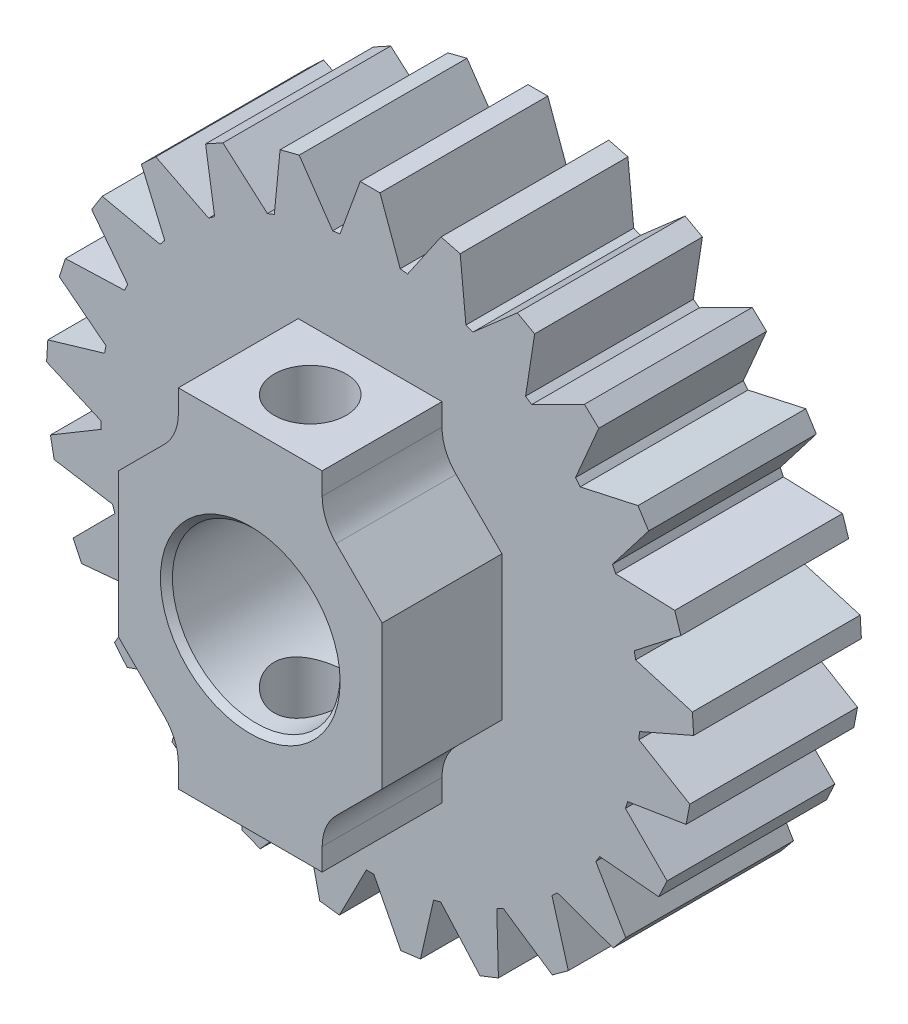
ISO-10303-21;
HEADER;
FILE_DESCRIPTION(('STEP AP214'),'2;1');
FILE_NAME('part.step','',(''),(''),'','','');
FILE_SCHEMA(('AUTOMOTIVE_DESIGN { 1 0 10303 214 1 1 1 1 }'));
ENDSEC;
DATA;
#1=APPLICATION_CONTEXT('core data for automotive mechanical design processes');
#2=APPLICATION_PROTOCOL_DEFINITION('international standard','automotive_design',2000,#1);
#3=PRODUCT_CONTEXT('',#1,'mechanical');
#4=PRODUCT('Part','Part','',(#3));
#5=PRODUCT_RELATED_PRODUCT_CATEGORY('part','',(#4));
#6=PRODUCT_DEFINITION_FORMATION('','',#4);
#7=PRODUCT_DEFINITION_CONTEXT('part definition',#1,'design');
#8=PRODUCT_DEFINITION('design','',#6,#7);
#9=PRODUCT_DEFINITION_SHAPE('','',#8);
#10=(LENGTH_UNIT() NAMED_UNIT(*) SI_UNIT(.MILLI.,.METRE.));
#11=(NAMED_UNIT(*) PLANE_ANGLE_UNIT() SI_UNIT($,.RADIAN.));
#12=(NAMED_UNIT(*) SI_UNIT($,.STERADIAN.) SOLID_ANGLE_UNIT());
#13=UNCERTAINTY_MEASURE_WITH_UNIT(LENGTH_MEASURE(1.E-05),#10,'distance_accuracy_value','');
#14=(GEOMETRIC_REPRESENTATION_CONTEXT(3) GLOBAL_UNCERTAINTY_ASSIGNED_CONTEXT((#13)) GLOBAL_UNIT_ASSIGNED_CONTEXT((#10,
#11,#12)) REPRESENTATION_CONTEXT('',''));
#15=CARTESIAN_POINT('',(0.,0.,0.));
#16=DIRECTION('',(0.,0.,1.));
#17=DIRECTION('',(1.,0.,0.));
#18=AXIS2_PLACEMENT_3D('',#15,#16,#17);
#19=CARTESIAN_POINT('',(0.,0.,17.));
#20=DIRECTION('',(0.,0.,1.));
#21=DIRECTION('',(1.,0.,0.));
#22=AXIS2_PLACEMENT_3D('',#19,#20,#21);
#23=PLANE('',#22);
#24=CARTESIAN_POINT('',(0.,0.,17.));
#25=DIRECTION('',(0.,0.,1.));
#26=DIRECTION('',(1.,0.,0.));
#27=AXIS2_PLACEMENT_3D('',#24,#25,#26);
#28=CIRCLE('',#27,7.49996316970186);
#29=CARTESIAN_POINT('',(7.49996316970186,0.,17.));
#30=VERTEX_POINT('',#29);
#31=EDGE_CURVE('E1665',#30,#30,#28,.F.);
#32=ORIENTED_EDGE('',*,*,#31,.T.);
#33=EDGE_LOOP('',(#32));
#34=FACE_BOUND('',#33,.T.);
#35=DIRECTION('',(0.,1.,0.));
#36=VECTOR('',#35,1.);
#37=CARTESIAN_POINT('',(11.,-6.,17.));
#38=LINE('',#37,#36);
#39=CARTESIAN_POINT('',(11.,6.,17.));
#40=VERTEX_POINT('',#39);
#41=CARTESIAN_POINT('',(11.,-6.,17.));
#42=VERTEX_POINT('',#41);
#43=EDGE_CURVE('E375',#40,#42,#38,.F.);
#44=ORIENTED_EDGE('',*,*,#43,.F.);
#45=DIRECTION('',(-0.707106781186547,0.707106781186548,0.));
#46=VECTOR('',#45,1.);
#47=CARTESIAN_POINT('',(11.,6.,17.));
#48=LINE('',#47,#46);
#49=CARTESIAN_POINT('',(7.17157287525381,9.82842712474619,17.));
#50=VERTEX_POINT('',#49);
#51=EDGE_CURVE('E1867',#50,#40,#48,.F.);
#52=ORIENTED_EDGE('',*,*,#51,.F.);
#53=CARTESIAN_POINT('',(10.,12.6568542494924,17.));
#54=DIRECTION('',(0.,0.,1.));
#55=DIRECTION('',(1.,0.,0.));
#56=AXIS2_PLACEMENT_3D('',#53,#54,#55);
#57=CIRCLE('',#56,4.);
#58=CARTESIAN_POINT('',(6.,12.6568542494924,17.));
#59=VERTEX_POINT('',#58);
#60=EDGE_CURVE('E1669',#50,#59,#57,.F.);
#61=ORIENTED_EDGE('',*,*,#60,.T.);
#62=DIRECTION('',(0.,1.,0.));
#63=VECTOR('',#62,1.);
#64=CARTESIAN_POINT('',(6.,12.6568542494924,17.));
#65=LINE('',#64,#63);
#66=CARTESIAN_POINT('',(6.,14.5,17.));
#67=VERTEX_POINT('',#66);
#68=EDGE_CURVE('E1673',#67,#59,#65,.F.);
#69=ORIENTED_EDGE('',*,*,#68,.F.);
#70=DIRECTION('',(1.,0.,0.));
#71=VECTOR('',#70,1.);
#72=CARTESIAN_POINT('',(6.,14.5,17.));
#73=LINE('',#72,#71);
#74=CARTESIAN_POINT('',(-6.,14.5,17.));
#75=VERTEX_POINT('',#74);
#76=EDGE_CURVE('E1878',#75,#67,#73,.T.);
#77=ORIENTED_EDGE('',*,*,#76,.F.);
#78=DIRECTION('',(0.,1.,0.));
#79=VECTOR('',#78,1.);
#80=CARTESIAN_POINT('',(-6.,14.5,17.));
#81=LINE('',#80,#79);
#82=CARTESIAN_POINT('',(-6.,12.6568542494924,17.));
#83=VERTEX_POINT('',#82);
#84=EDGE_CURVE('E1884',#83,#75,#81,.T.);
#85=ORIENTED_EDGE('',*,*,#84,.F.);
#86=CARTESIAN_POINT('',(-10.,12.6568542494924,17.));
#87=DIRECTION('',(0.,0.,1.));
#88=DIRECTION('',(1.,0.,0.));
#89=AXIS2_PLACEMENT_3D('',#86,#87,#88);
#90=CIRCLE('',#89,4.);
#91=CARTESIAN_POINT('',(-7.17157287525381,9.82842712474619,17.));
#92=VERTEX_POINT('',#91);
#93=EDGE_CURVE('E1674',#83,#92,#90,.F.);
#94=ORIENTED_EDGE('',*,*,#93,.T.);
#95=DIRECTION('',(-0.707106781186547,-0.707106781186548,0.));
#96=VECTOR('',#95,1.);
#97=CARTESIAN_POINT('',(-7.17157287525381,9.82842712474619,17.));
#98=LINE('',#97,#96);
#99=CARTESIAN_POINT('',(-11.,6.,17.));
#100=VERTEX_POINT('',#99);
#101=EDGE_CURVE('E1677',#100,#92,#98,.F.);
#102=ORIENTED_EDGE('',*,*,#101,.F.);
#103=DIRECTION('',(0.,1.,0.));
#104=VECTOR('',#103,1.);
#105=CARTESIAN_POINT('',(-11.,6.,17.));
#106=LINE('',#105,#104);
#107=CARTESIAN_POINT('',(-11.,-6.,17.));
#108=VERTEX_POINT('',#107);
#109=EDGE_CURVE('E1895',#108,#100,#106,.T.);
#110=ORIENTED_EDGE('',*,*,#109,.F.);
#111=DIRECTION('',(0.707106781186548,-0.707106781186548,0.));
#112=VECTOR('',#111,1.);
#113=CARTESIAN_POINT('',(-11.,-6.,17.));
#114=LINE('',#113,#112);
#115=CARTESIAN_POINT('',(-7.17157287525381,-9.82842712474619,17.));
#116=VERTEX_POINT('',#115);
#117=EDGE_CURVE('E1901',#116,#108,#114,.F.);
#118=ORIENTED_EDGE('',*,*,#117,.F.);
#119=CARTESIAN_POINT('',(-10.,-12.6568542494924,17.));
#120=DIRECTION('',(0.,0.,1.));
#121=DIRECTION('',(1.,0.,0.));
#122=AXIS2_PLACEMENT_3D('',#119,#120,#121);
#123=CIRCLE('',#122,4.);
#124=CARTESIAN_POINT('',(-6.,-12.6568542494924,17.));
#125=VERTEX_POINT('',#124);
#126=EDGE_CURVE('E1678',#116,#125,#123,.F.);
#127=ORIENTED_EDGE('',*,*,#126,.T.);
#128=DIRECTION('',(0.,1.,0.));
#129=VECTOR('',#128,1.);
#130=CARTESIAN_POINT('',(-6.,-12.6568542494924,17.));
#131=LINE('',#130,#129);
#132=CARTESIAN_POINT('',(-6.,-14.5,17.));
#133=VERTEX_POINT('',#132);
#134=EDGE_CURVE('E1681',#133,#125,#131,.T.);
#135=ORIENTED_EDGE('',*,*,#134,.F.);
#136=DIRECTION('',(1.,0.,0.));
#137=VECTOR('',#136,1.);
#138=CARTESIAN_POINT('',(-6.,-14.5,17.));
#139=LINE('',#138,#137);
#140=CARTESIAN_POINT('',(6.,-14.5,17.));
#141=VERTEX_POINT('',#140);
#142=EDGE_CURVE('E1693',#141,#133,#139,.F.);
#143=ORIENTED_EDGE('',*,*,#142,.F.);
#144=DIRECTION('',(0.,1.,0.));
#145=VECTOR('',#144,1.);
#146=CARTESIAN_POINT('',(6.,-14.5,17.));
#147=LINE('',#146,#145);
#148=CARTESIAN_POINT('',(6.,-12.6568542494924,17.));
#149=VERTEX_POINT('',#148);
#150=EDGE_CURVE('E1706',#149,#141,#147,.F.);
#151=ORIENTED_EDGE('',*,*,#150,.F.);
#152=CARTESIAN_POINT('',(10.,-12.6568542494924,17.));
#153=DIRECTION('',(0.,0.,1.));
#154=DIRECTION('',(1.,0.,0.));
#155=AXIS2_PLACEMENT_3D('',#152,#153,#154);
#156=CIRCLE('',#155,4.);
#157=CARTESIAN_POINT('',(7.17157287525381,-9.82842712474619,17.));
#158=VERTEX_POINT('',#157);
#159=EDGE_CURVE('E20',#149,#158,#156,.F.);
#160=ORIENTED_EDGE('',*,*,#159,.T.);
#161=DIRECTION('',(0.707106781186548,0.707106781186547,0.));
#162=VECTOR('',#161,1.);
#163=CARTESIAN_POINT('',(7.17157287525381,-9.82842712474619,17.));
#164=LINE('',#163,#162);
#165=EDGE_CURVE('E368',#42,#158,#164,.F.);
#166=ORIENTED_EDGE('',*,*,#165,.F.);
#167=EDGE_LOOP('',(#44,#52,#61,#69,#77,#85,#94,#102,#110,#118,#127,#135,#143,#151,#160,#166));
#168=FACE_BOUND('',#167,.T.);
#169=ADVANCED_FACE('F17',(#34,#168),#23,.T.);
#170=CARTESIAN_POINT('',(11.,-6.,7.));
#171=DIRECTION('',(1.,0.,0.));
#172=DIRECTION('',(0.,0.,-1.));
#173=AXIS2_PLACEMENT_3D('',#170,#171,#172);
#174=PLANE('',#173);
#175=DIRECTION('',(0.,0.,1.));
#176=VECTOR('',#175,1.);
#177=CARTESIAN_POINT('',(11.,-6.,7.));
#178=LINE('',#177,#176);
#179=CARTESIAN_POINT('',(11.,-6.,7.));
#180=VERTEX_POINT('',#179);
#181=EDGE_CURVE('E1712',#180,#42,#178,.T.);
#182=ORIENTED_EDGE('',*,*,#181,.F.);
#183=DIRECTION('',(0.,1.,0.));
#184=VECTOR('',#183,1.);
#185=CARTESIAN_POINT('',(11.,0.,7.));
#186=LINE('',#185,#184);
#187=CARTESIAN_POINT('',(11.,6.,7.));
#188=VERTEX_POINT('',#187);
#189=EDGE_CURVE('E1461',#188,#180,#186,.F.);
#190=ORIENTED_EDGE('',*,*,#189,.F.);
#191=DIRECTION('',(0.,0.,1.));
#192=VECTOR('',#191,1.);
#193=CARTESIAN_POINT('',(11.,6.,7.));
#194=LINE('',#193,#192);
#195=EDGE_CURVE('E1668',#40,#188,#194,.F.);
#196=ORIENTED_EDGE('',*,*,#195,.F.);
#197=ORIENTED_EDGE('',*,*,#43,.T.);
#198=EDGE_LOOP('',(#182,#190,#196,#197));
#199=FACE_BOUND('',#198,.T.);
#200=ADVANCED_FACE('F1994',(#199),#174,.T.);
#201=CARTESIAN_POINT('',(7.17157287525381,-9.82842712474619,7.));
#202=DIRECTION('',(0.707106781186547,-0.707106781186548,0.));
#203=DIRECTION('',(0.707106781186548,0.707106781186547,0.));
#204=AXIS2_PLACEMENT_3D('',#201,#202,#203);
#205=PLANE('',#204);
#206=DIRECTION('',(0.,0.,1.));
#207=VECTOR('',#206,1.);
#208=CARTESIAN_POINT('',(7.17157287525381,-9.82842712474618,7.));
#209=LINE('',#208,#207);
#210=CARTESIAN_POINT('',(7.17157287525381,-9.82842712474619,7.));
#211=VERTEX_POINT('',#210);
#212=EDGE_CURVE('E1913',#158,#211,#209,.F.);
#213=ORIENTED_EDGE('',*,*,#212,.T.);
#214=DIRECTION('',(-0.707106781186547,-0.707106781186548,0.));
#215=VECTOR('',#214,1.);
#216=CARTESIAN_POINT('',(11.,-6.,7.));
#217=LINE('',#216,#215);
#218=EDGE_CURVE('E1988',#180,#211,#217,.T.);
#219=ORIENTED_EDGE('',*,*,#218,.F.);
#220=ORIENTED_EDGE('',*,*,#181,.T.);
#221=ORIENTED_EDGE('',*,*,#165,.T.);
#222=EDGE_LOOP('',(#213,#219,#220,#221));
#223=FACE_BOUND('',#222,.T.);
#224=ADVANCED_FACE('F1995',(#223),#205,.T.);
#225=CARTESIAN_POINT('',(10.,-12.6568542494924,7.));
#226=DIRECTION('',(0.,0.,1.));
#227=DIRECTION('',(1.,0.,0.));
#228=AXIS2_PLACEMENT_3D('',#225,#226,#227);
#229=CYLINDRICAL_SURFACE('',#228,4.);
#230=ORIENTED_EDGE('',*,*,#159,.F.);
#231=DIRECTION('',(0.,0.,1.));
#232=VECTOR('',#231,1.);
#233=CARTESIAN_POINT('',(6.,-12.6568542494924,7.));
#234=LINE('',#233,#232);
#235=CARTESIAN_POINT('',(6.,-12.6568542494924,7.));
#236=VERTEX_POINT('',#235);
#237=EDGE_CURVE('E1708',#236,#149,#234,.T.);
#238=ORIENTED_EDGE('',*,*,#237,.F.);
#239=CARTESIAN_POINT('',(10.,-12.6568542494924,7.));
#240=DIRECTION('',(0.,0.,1.));
#241=DIRECTION('',(1.,0.,0.));
#242=AXIS2_PLACEMENT_3D('',#239,#240,#241);
#243=CIRCLE('',#242,4.);
#244=EDGE_CURVE('E1986',#211,#236,#243,.T.);
#245=ORIENTED_EDGE('',*,*,#244,.F.);
#246=ORIENTED_EDGE('',*,*,#212,.F.);
#247=EDGE_LOOP('',(#230,#238,#245,#246));
#248=FACE_BOUND('',#247,.T.);
#249=ADVANCED_FACE('F1997',(#248),#229,.F.);
#250=CARTESIAN_POINT('',(6.,-14.5,7.));
#251=DIRECTION('',(1.,0.,0.));
#252=DIRECTION('',(0.,1.,0.));
#253=AXIS2_PLACEMENT_3D('',#250,#251,#252);
#254=PLANE('',#253);
#255=DIRECTION('',(0.,0.,-1.));
#256=VECTOR('',#255,1.);
#257=CARTESIAN_POINT('',(6.,-14.5,7.));
#258=LINE('',#257,#256);
#259=CARTESIAN_POINT('',(6.,-14.5,7.));
#260=VERTEX_POINT('',#259);
#261=EDGE_CURVE('E1703',#260,#141,#258,.F.);
#262=ORIENTED_EDGE('',*,*,#261,.F.);
#263=DIRECTION('',(0.,1.,0.));
#264=VECTOR('',#263,1.);
#265=CARTESIAN_POINT('',(6.,0.,7.));
#266=LINE('',#265,#264);
#267=EDGE_CURVE('E1984',#236,#260,#266,.F.);
#268=ORIENTED_EDGE('',*,*,#267,.F.);
#269=ORIENTED_EDGE('',*,*,#237,.T.);
#270=ORIENTED_EDGE('',*,*,#150,.T.);
#271=EDGE_LOOP('',(#262,#268,#269,#270));
#272=FACE_BOUND('',#271,.T.);
#273=ADVANCED_FACE('F2003',(#272),#254,.T.);
#274=CARTESIAN_POINT('',(-6.,-14.5,7.));
#275=DIRECTION('',(0.,-1.,0.));
#276=DIRECTION('',(0.,0.,-1.));
#277=AXIS2_PLACEMENT_3D('',#274,#275,#276);
#278=PLANE('',#277);
#279=CARTESIAN_POINT('',(0.,-14.5,12.));
#280=DIRECTION('',(0.,1.,0.));
#281=DIRECTION('',(0.,0.,1.));
#282=AXIS2_PLACEMENT_3D('',#279,#280,#281);
#283=CIRCLE('',#282,3.);
#284=CARTESIAN_POINT('',(0.,-14.5,15.));
#285=VERTEX_POINT('',#284);
#286=EDGE_CURVE('E1662',#285,#285,#283,.T.);
#287=ORIENTED_EDGE('',*,*,#286,.T.);
#288=EDGE_LOOP('',(#287));
#289=FACE_BOUND('',#288,.T.);
#290=DIRECTION('',(0.,0.,1.));
#291=VECTOR('',#290,1.);
#292=CARTESIAN_POINT('',(-6.,-14.5,7.));
#293=LINE('',#292,#291);
#294=CARTESIAN_POINT('',(-6.,-14.5,7.));
#295=VERTEX_POINT('',#294);
#296=EDGE_CURVE('E1688',#295,#133,#293,.T.);
#297=ORIENTED_EDGE('',*,*,#296,.F.);
#298=DIRECTION('',(1.,0.,0.));
#299=VECTOR('',#298,1.);
#300=CARTESIAN_POINT('',(0.,-14.5,7.));
#301=LINE('',#300,#299);
#302=EDGE_CURVE('E1982',#260,#295,#301,.F.);
#303=ORIENTED_EDGE('',*,*,#302,.F.);
#304=ORIENTED_EDGE('',*,*,#261,.T.);
#305=ORIENTED_EDGE('',*,*,#142,.T.);
#306=EDGE_LOOP('',(#297,#303,#304,#305));
#307=FACE_BOUND('',#306,.T.);
#308=ADVANCED_FACE('F2007',(#289,#307),#278,.T.);
#309=CARTESIAN_POINT('',(-6.,-12.6568542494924,7.));
#310=DIRECTION('',(-1.,0.,0.));
#311=DIRECTION('',(0.,0.,1.));
#312=AXIS2_PLACEMENT_3D('',#309,#310,#311);
#313=PLANE('',#312);
#314=DIRECTION('',(0.,0.,1.));
#315=VECTOR('',#314,1.);
#316=CARTESIAN_POINT('',(-6.,-12.6568542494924,7.));
#317=LINE('',#316,#315);
#318=CARTESIAN_POINT('',(-6.,-12.6568542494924,7.));
#319=VERTEX_POINT('',#318);
#320=EDGE_CURVE('E1680',#125,#319,#317,.F.);
#321=ORIENTED_EDGE('',*,*,#320,.T.);
#322=DIRECTION('',(0.,1.,0.));
#323=VECTOR('',#322,1.);
#324=CARTESIAN_POINT('',(-6.,0.,7.));
#325=LINE('',#324,#323);
#326=EDGE_CURVE('E1980',#295,#319,#325,.T.);
#327=ORIENTED_EDGE('',*,*,#326,.F.);
#328=ORIENTED_EDGE('',*,*,#296,.T.);
#329=ORIENTED_EDGE('',*,*,#134,.T.);
#330=EDGE_LOOP('',(#321,#327,#328,#329));
#331=FACE_BOUND('',#330,.T.);
#332=ADVANCED_FACE('F2009',(#331),#313,.T.);
#333=CARTESIAN_POINT('',(-10.,-12.6568542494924,7.));
#334=DIRECTION('',(0.,0.,1.));
#335=DIRECTION('',(1.,0.,0.));
#336=AXIS2_PLACEMENT_3D('',#333,#334,#335);
#337=CYLINDRICAL_SURFACE('',#336,4.);
#338=ORIENTED_EDGE('',*,*,#126,.F.);
#339=DIRECTION('',(0.,0.,1.));
#340=VECTOR('',#339,1.);
#341=CARTESIAN_POINT('',(-7.17157287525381,-9.82842712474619,7.));
#342=LINE('',#341,#340);
#343=CARTESIAN_POINT('',(-7.17157287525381,-9.82842712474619,7.));
#344=VERTEX_POINT('',#343);
#345=EDGE_CURVE('E1686',#344,#116,#342,.T.);
#346=ORIENTED_EDGE('',*,*,#345,.F.);
#347=CARTESIAN_POINT('',(-10.,-12.6568542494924,7.));
#348=DIRECTION('',(0.,0.,1.));
#349=DIRECTION('',(1.,0.,0.));
#350=AXIS2_PLACEMENT_3D('',#347,#348,#349);
#351=CIRCLE('',#350,4.);
#352=EDGE_CURVE('E1978',#319,#344,#351,.T.);
#353=ORIENTED_EDGE('',*,*,#352,.F.);
#354=ORIENTED_EDGE('',*,*,#320,.F.);
#355=EDGE_LOOP('',(#338,#346,#353,#354));
#356=FACE_BOUND('',#355,.T.);
#357=ADVANCED_FACE('F2012',(#356),#337,.F.);
#358=CARTESIAN_POINT('',(-11.,-6.,7.));
#359=DIRECTION('',(-0.707106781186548,-0.707106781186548,0.));
#360=DIRECTION('',(0.707106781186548,-0.707106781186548,0.));
#361=AXIS2_PLACEMENT_3D('',#358,#359,#360);
#362=PLANE('',#361);
#363=DIRECTION('',(0.,0.,1.));
#364=VECTOR('',#363,1.);
#365=CARTESIAN_POINT('',(-11.,-6.,7.));
#366=LINE('',#365,#364);
#367=CARTESIAN_POINT('',(-11.,-6.,7.));
#368=VERTEX_POINT('',#367);
#369=EDGE_CURVE('E1898',#368,#108,#366,.T.);
#370=ORIENTED_EDGE('',*,*,#369,.F.);
#371=DIRECTION('',(-0.707106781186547,0.707106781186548,0.));
#372=VECTOR('',#371,1.);
#373=CARTESIAN_POINT('',(-7.1715728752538,-9.8284271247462,7.));
#374=LINE('',#373,#372);
#375=EDGE_CURVE('E1976',#344,#368,#374,.T.);
#376=ORIENTED_EDGE('',*,*,#375,.F.);
#377=ORIENTED_EDGE('',*,*,#345,.T.);
#378=ORIENTED_EDGE('',*,*,#117,.T.);
#379=EDGE_LOOP('',(#370,#376,#377,#378));
#380=FACE_BOUND('',#379,.T.);
#381=ADVANCED_FACE('F1944',(#380),#362,.T.);
#382=CARTESIAN_POINT('',(-11.,6.,7.));
#383=DIRECTION('',(-1.,0.,0.));
#384=DIRECTION('',(0.,0.,1.));
#385=AXIS2_PLACEMENT_3D('',#382,#383,#384);
#386=PLANE('',#385);
#387=DIRECTION('',(0.,0.,1.));
#388=VECTOR('',#387,1.);
#389=CARTESIAN_POINT('',(-11.,6.,7.));
#390=LINE('',#389,#388);
#391=CARTESIAN_POINT('',(-11.,6.,7.));
#392=VERTEX_POINT('',#391);
#393=EDGE_CURVE('E1892',#392,#100,#390,.T.);
#394=ORIENTED_EDGE('',*,*,#393,.F.);
#395=DIRECTION('',(0.,1.,0.));
#396=VECTOR('',#395,1.);
#397=CARTESIAN_POINT('',(-11.,0.,7.));
#398=LINE('',#397,#396);
#399=EDGE_CURVE('E1953',#368,#392,#398,.T.);
#400=ORIENTED_EDGE('',*,*,#399,.F.);
#401=ORIENTED_EDGE('',*,*,#369,.T.);
#402=ORIENTED_EDGE('',*,*,#109,.T.);
#403=EDGE_LOOP('',(#394,#400,#401,#402));
#404=FACE_BOUND('',#403,.T.);
#405=ADVANCED_FACE('F1952',(#404),#386,.T.);
#406=CARTESIAN_POINT('',(-7.17157287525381,9.82842712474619,7.));
#407=DIRECTION('',(-0.707106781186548,0.707106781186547,0.));
#408=DIRECTION('',(-0.707106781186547,-0.707106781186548,0.));
#409=AXIS2_PLACEMENT_3D('',#406,#407,#408);
#410=PLANE('',#409);
#411=DIRECTION('',(0.,0.,1.));
#412=VECTOR('',#411,1.);
#413=CARTESIAN_POINT('',(-7.17157287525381,9.82842712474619,7.));
#414=LINE('',#413,#412);
#415=CARTESIAN_POINT('',(-7.17157287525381,9.82842712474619,7.));
#416=VERTEX_POINT('',#415);
#417=EDGE_CURVE('E1676',#92,#416,#414,.F.);
#418=ORIENTED_EDGE('',*,*,#417,.T.);
#419=DIRECTION('',(0.707106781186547,0.707106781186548,0.));
#420=VECTOR('',#419,1.);
#421=CARTESIAN_POINT('',(-11.,6.,7.));
#422=LINE('',#421,#420);
#423=EDGE_CURVE('E1968',#392,#416,#422,.T.);
#424=ORIENTED_EDGE('',*,*,#423,.F.);
#425=ORIENTED_EDGE('',*,*,#393,.T.);
#426=ORIENTED_EDGE('',*,*,#101,.T.);
#427=EDGE_LOOP('',(#418,#424,#425,#426));
#428=FACE_BOUND('',#427,.T.);
#429=ADVANCED_FACE('F1959',(#428),#410,.T.);
#430=CARTESIAN_POINT('',(-10.,12.6568542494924,7.));
#431=DIRECTION('',(0.,0.,1.));
#432=DIRECTION('',(1.,0.,0.));
#433=AXIS2_PLACEMENT_3D('',#430,#431,#432);
#434=CYLINDRICAL_SURFACE('',#433,4.);
#435=ORIENTED_EDGE('',*,*,#93,.F.);
#436=DIRECTION('',(0.,0.,1.));
#437=VECTOR('',#436,1.);
#438=CARTESIAN_POINT('',(-6.,12.6568542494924,7.));
#439=LINE('',#438,#437);
#440=CARTESIAN_POINT('',(-6.,12.6568542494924,7.));
#441=VERTEX_POINT('',#440);
#442=EDGE_CURVE('E1887',#441,#83,#439,.T.);
#443=ORIENTED_EDGE('',*,*,#442,.F.);
#444=CARTESIAN_POINT('',(-10.,12.6568542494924,7.));
#445=DIRECTION('',(0.,0.,1.));
#446=DIRECTION('',(1.,0.,0.));
#447=AXIS2_PLACEMENT_3D('',#444,#445,#446);
#448=CIRCLE('',#447,4.);
#449=EDGE_CURVE('E1965',#416,#441,#448,.T.);
#450=ORIENTED_EDGE('',*,*,#449,.F.);
#451=ORIENTED_EDGE('',*,*,#417,.F.);
#452=EDGE_LOOP('',(#435,#443,#450,#451));
#453=FACE_BOUND('',#452,.T.);
#454=ADVANCED_FACE('F1963',(#453),#434,.F.);
#455=CARTESIAN_POINT('',(-6.,14.5,7.));
#456=DIRECTION('',(-1.,0.,0.));
#457=DIRECTION('',(0.,0.,1.));
#458=AXIS2_PLACEMENT_3D('',#455,#456,#457);
#459=PLANE('',#458);
#460=DIRECTION('',(0.,0.,1.));
#461=VECTOR('',#460,1.);
#462=CARTESIAN_POINT('',(-6.,14.5,7.));
#463=LINE('',#462,#461);
#464=CARTESIAN_POINT('',(-6.,14.5,7.));
#465=VERTEX_POINT('',#464);
#466=EDGE_CURVE('E1881',#465,#75,#463,.T.);
#467=ORIENTED_EDGE('',*,*,#466,.F.);
#468=DIRECTION('',(0.,1.,0.));
#469=VECTOR('',#468,1.);
#470=CARTESIAN_POINT('',(-6.,0.,7.));
#471=LINE('',#470,#469);
#472=EDGE_CURVE('E1967',#441,#465,#471,.T.);
#473=ORIENTED_EDGE('',*,*,#472,.F.);
#474=ORIENTED_EDGE('',*,*,#442,.T.);
#475=ORIENTED_EDGE('',*,*,#84,.T.);
#476=EDGE_LOOP('',(#467,#473,#474,#475));
#477=FACE_BOUND('',#476,.T.);
#478=ADVANCED_FACE('F2066',(#477),#459,.T.);
#479=CARTESIAN_POINT('',(6.,14.5,7.));
#480=DIRECTION('',(0.,1.,0.));
#481=DIRECTION('',(0.,0.,1.));
#482=AXIS2_PLACEMENT_3D('',#479,#480,#481);
#483=PLANE('',#482);
#484=CARTESIAN_POINT('',(0.,14.5,12.));
#485=DIRECTION('',(0.,1.,0.));
#486=DIRECTION('',(0.,0.,1.));
#487=AXIS2_PLACEMENT_3D('',#484,#485,#486);
#488=CIRCLE('',#487,3.);
#489=CARTESIAN_POINT('',(0.,14.5,15.));
#490=VERTEX_POINT('',#489);
#491=EDGE_CURVE('E1659',#490,#490,#488,.F.);
#492=ORIENTED_EDGE('',*,*,#491,.T.);
#493=EDGE_LOOP('',(#492));
#494=FACE_BOUND('',#493,.T.);
#495=DIRECTION('',(0.,0.,-1.));
#496=VECTOR('',#495,1.);
#497=CARTESIAN_POINT('',(6.,14.5,7.));
#498=LINE('',#497,#496);
#499=CARTESIAN_POINT('',(6.,14.5,7.));
#500=VERTEX_POINT('',#499);
#501=EDGE_CURVE('E1875',#500,#67,#498,.F.);
#502=ORIENTED_EDGE('',*,*,#501,.F.);
#503=DIRECTION('',(1.,0.,0.));
#504=VECTOR('',#503,1.);
#505=CARTESIAN_POINT('',(0.,14.5,7.));
#506=LINE('',#505,#504);
#507=EDGE_CURVE('E1970',#465,#500,#506,.T.);
#508=ORIENTED_EDGE('',*,*,#507,.F.);
#509=ORIENTED_EDGE('',*,*,#466,.T.);
#510=ORIENTED_EDGE('',*,*,#76,.T.);
#511=EDGE_LOOP('',(#502,#508,#509,#510));
#512=FACE_BOUND('',#511,.T.);
#513=ADVANCED_FACE('F2062',(#494,#512),#483,.T.);
#514=CARTESIAN_POINT('',(6.,12.6568542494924,7.));
#515=DIRECTION('',(1.,0.,0.));
#516=DIRECTION('',(0.,0.,-1.));
#517=AXIS2_PLACEMENT_3D('',#514,#515,#516);
#518=PLANE('',#517);
#519=DIRECTION('',(0.,0.,1.));
#520=VECTOR('',#519,1.);
#521=CARTESIAN_POINT('',(6.,12.6568542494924,7.));
#522=LINE('',#521,#520);
#523=CARTESIAN_POINT('',(6.,12.6568542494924,7.));
#524=VERTEX_POINT('',#523);
#525=EDGE_CURVE('E1672',#59,#524,#522,.F.);
#526=ORIENTED_EDGE('',*,*,#525,.T.);
#527=DIRECTION('',(0.,1.,0.));
#528=VECTOR('',#527,1.);
#529=CARTESIAN_POINT('',(6.,0.,7.));
#530=LINE('',#529,#528);
#531=EDGE_CURVE('E2700',#500,#524,#530,.F.);
#532=ORIENTED_EDGE('',*,*,#531,.F.);
#533=ORIENTED_EDGE('',*,*,#501,.T.);
#534=ORIENTED_EDGE('',*,*,#68,.T.);
#535=EDGE_LOOP('',(#526,#532,#533,#534));
#536=FACE_BOUND('',#535,.T.);
#537=ADVANCED_FACE('F2058',(#536),#518,.T.);
#538=CARTESIAN_POINT('',(10.,12.6568542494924,7.));
#539=DIRECTION('',(0.,0.,1.));
#540=DIRECTION('',(1.,0.,0.));
#541=AXIS2_PLACEMENT_3D('',#538,#539,#540);
#542=CYLINDRICAL_SURFACE('',#541,4.);
#543=ORIENTED_EDGE('',*,*,#60,.F.);
#544=DIRECTION('',(0.,0.,1.));
#545=VECTOR('',#544,1.);
#546=CARTESIAN_POINT('',(7.17157287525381,9.82842712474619,7.));
#547=LINE('',#546,#545);
#548=CARTESIAN_POINT('',(7.17157287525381,9.82842712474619,7.));
#549=VERTEX_POINT('',#548);
#550=EDGE_CURVE('E1870',#549,#50,#547,.T.);
#551=ORIENTED_EDGE('',*,*,#550,.F.);
#552=CARTESIAN_POINT('',(10.,12.6568542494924,7.));
#553=DIRECTION('',(0.,0.,1.));
#554=DIRECTION('',(1.,0.,0.));
#555=AXIS2_PLACEMENT_3D('',#552,#553,#554);
#556=CIRCLE('',#555,4.);
#557=EDGE_CURVE('E2701',#524,#549,#556,.T.);
#558=ORIENTED_EDGE('',*,*,#557,.F.);
#559=ORIENTED_EDGE('',*,*,#525,.F.);
#560=EDGE_LOOP('',(#543,#551,#558,#559));
#561=FACE_BOUND('',#560,.T.);
#562=ADVANCED_FACE('F2050',(#561),#542,.F.);
#563=CARTESIAN_POINT('',(11.,6.,7.));
#564=DIRECTION('',(0.707106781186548,0.707106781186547,0.));
#565=DIRECTION('',(-0.707106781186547,0.707106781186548,0.));
#566=AXIS2_PLACEMENT_3D('',#563,#564,#565);
#567=PLANE('',#566);
#568=ORIENTED_EDGE('',*,*,#195,.T.);
#569=DIRECTION('',(0.707106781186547,-0.707106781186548,0.));
#570=VECTOR('',#569,1.);
#571=CARTESIAN_POINT('',(7.17157287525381,9.8284271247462,7.));
#572=LINE('',#571,#570);
#573=EDGE_CURVE('E1993',#549,#188,#572,.T.);
#574=ORIENTED_EDGE('',*,*,#573,.F.);
#575=ORIENTED_EDGE('',*,*,#550,.T.);
#576=ORIENTED_EDGE('',*,*,#51,.T.);
#577=EDGE_LOOP('',(#568,#574,#575,#576));
#578=FACE_BOUND('',#577,.T.);
#579=ADVANCED_FACE('F2042',(#578),#567,.T.);
#580=CARTESIAN_POINT('',(0.,0.,17.0000184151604));
#581=DIRECTION('',(0.,0.,1.));
#582=DIRECTION('',(1.,0.,0.));
#583=AXIS2_PLACEMENT_3D('',#580,#581,#582);
#584=CONICAL_SURFACE('',#583,7.49998158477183,0.785395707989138);
#585=CARTESIAN_POINT('',(0.,0.,16.5000343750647));
#586=DIRECTION('',(0.,0.,1.));
#587=DIRECTION('',(1.,0.,0.));
#588=AXIS2_PLACEMENT_3D('',#585,#586,#587);
#589=CIRCLE('',#588,7.);
#590=CARTESIAN_POINT('',(7.,0.,16.5000343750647));
#591=VERTEX_POINT('',#590);
#592=EDGE_CURVE('E2705',#591,#591,#589,.F.);
#593=ORIENTED_EDGE('',*,*,#592,.T.);
#594=EDGE_LOOP('',(#593));
#595=FACE_BOUND('',#594,.T.);
#596=ORIENTED_EDGE('',*,*,#31,.F.);
#597=EDGE_LOOP('',(#596));
#598=FACE_BOUND('',#597,.T.);
#599=ADVANCED_FACE('F2040',(#595,#598),#584,.F.);
#600=CARTESIAN_POINT('',(0.,32.3890481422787,12.));
#601=DIRECTION('',(0.,1.,0.));
#602=DIRECTION('',(0.,0.,1.));
#603=AXIS2_PLACEMENT_3D('',#600,#601,#602);
#604=CYLINDRICAL_SURFACE('',#603,3.);
#605=ORIENTED_EDGE('',*,*,#286,.F.);
#606=EDGE_LOOP('',(#605));
#607=FACE_BOUND('',#606,.T.);
#608=CARTESIAN_POINT('',(0.,-7.,15.));
#609=CARTESIAN_POINT('',(0.160548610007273,-6.99999515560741,14.9999941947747));
#610=CARTESIAN_POINT('',(0.321157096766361,-6.99442254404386,14.9870555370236));
#611=CARTESIAN_POINT('',(0.63759844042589,-6.97270987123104,14.9358481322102));
#612=CARTESIAN_POINT('',(0.793427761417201,-6.95656217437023,14.8975610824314));
#613=CARTESIAN_POINT('',(1.09551225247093,-6.91542058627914,14.7973406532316));
#614=CARTESIAN_POINT('',(1.24179260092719,-6.89045117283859,14.7354726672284));
#615=CARTESIAN_POINT('',(1.52181616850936,-6.83406945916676,14.5901696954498));
#616=CARTESIAN_POINT('',(1.65555765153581,-6.80265626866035,14.5067317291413));
#617=CARTESIAN_POINT('',(1.91383886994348,-6.73467906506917,14.316074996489));
#618=CARTESIAN_POINT('',(2.03763443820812,-6.69794073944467,14.2079110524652));
#619=CARTESIAN_POINT('',(2.26598515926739,-6.62417840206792,13.9728614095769));
#620=CARTESIAN_POINT('',(2.37052867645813,-6.587154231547,13.845964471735));
#621=CARTESIAN_POINT('',(2.56289704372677,-6.51480517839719,13.5689127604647));
#622=CARTESIAN_POINT('',(2.64953775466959,-6.47967524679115,13.4178802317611));
#623=CARTESIAN_POINT('',(2.79578305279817,-6.41794008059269,13.1017390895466));
#624=CARTESIAN_POINT('',(2.85542442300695,-6.39132326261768,12.9366499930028));
#625=CARTESIAN_POINT('',(2.93321847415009,-6.35590397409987,12.642520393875));
#626=CARTESIAN_POINT('',(2.95819132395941,-6.34424462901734,12.5155941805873));
#627=CARTESIAN_POINT('',(2.99158265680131,-6.32856838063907,12.2591248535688));
#628=CARTESIAN_POINT('',(3.00000510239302,-6.32454964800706,12.1295823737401));
#629=CARTESIAN_POINT('',(2.9999937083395,-6.32456231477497,11.840214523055));
#630=CARTESIAN_POINT('',(2.98717343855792,-6.33068836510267,11.6803683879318));
#631=CARTESIAN_POINT('',(2.93647943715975,-6.35435544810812,11.36551595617));
#632=CARTESIAN_POINT('',(2.89858440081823,-6.37190618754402,11.2105138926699));
#633=CARTESIAN_POINT('',(2.79950748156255,-6.41604709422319,10.9101912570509));
#634=CARTESIAN_POINT('',(2.73840798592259,-6.44260524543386,10.7648385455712));
#635=CARTESIAN_POINT('',(2.5949230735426,-6.50172091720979,10.4864199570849));
#636=CARTESIAN_POINT('',(2.5125332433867,-6.53427968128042,10.3533566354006));
#637=CARTESIAN_POINT('',(2.3230369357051,-6.60411035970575,10.0945528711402));
#638=CARTESIAN_POINT('',(2.21475057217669,-6.64154749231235,9.96972065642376));
#639=CARTESIAN_POINT('',(1.97899702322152,-6.7155660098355,9.73930263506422));
#640=CARTESIAN_POINT('',(1.85152128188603,-6.75214700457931,9.63372546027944));
#641=CARTESIAN_POINT('',(1.57372275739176,-6.82237855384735,9.44004249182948));
#642=CARTESIAN_POINT('',(1.42261057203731,-6.8558122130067,9.35298400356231));
#643=CARTESIAN_POINT('',(1.10626295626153,-6.91389362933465,9.20598678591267));
#644=CARTESIAN_POINT('',(0.941045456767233,-6.9385523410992,9.14601421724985));
#645=CARTESIAN_POINT('',(0.646110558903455,-6.97126062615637,9.06753314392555));
#646=CARTESIAN_POINT('',(0.518447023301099,-6.98197010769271,9.04227512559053));
#647=CARTESIAN_POINT('',(0.260535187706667,-6.99634118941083,9.00850755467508));
#648=CARTESIAN_POINT('',(0.130287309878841,-7.00000393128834,8.99999528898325));
#649=CARTESIAN_POINT('',(-0.160548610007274,-6.99999515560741,9.00000580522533));
#650=CARTESIAN_POINT('',(-0.321157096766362,-6.99442254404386,9.01294446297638));
#651=CARTESIAN_POINT('',(-0.637598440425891,-6.97270987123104,9.06415186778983));
#652=CARTESIAN_POINT('',(-0.793427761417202,-6.95656217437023,9.10243891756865));
#653=CARTESIAN_POINT('',(-1.09551225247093,-6.91542058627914,9.20265934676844));
#654=CARTESIAN_POINT('',(-1.24179260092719,-6.89045117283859,9.26452733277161));
#655=CARTESIAN_POINT('',(-1.52181616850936,-6.83406945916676,9.40983030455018));
#656=CARTESIAN_POINT('',(-1.65555765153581,-6.80265626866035,9.49326827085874));
#657=CARTESIAN_POINT('',(-1.91383886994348,-6.73467906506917,9.68392500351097));
#658=CARTESIAN_POINT('',(-2.03763443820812,-6.69794073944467,9.79208894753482));
#659=CARTESIAN_POINT('',(-2.26598515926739,-6.62417840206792,10.0271385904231));
#660=CARTESIAN_POINT('',(-2.37052867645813,-6.587154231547,10.154035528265));
#661=CARTESIAN_POINT('',(-2.56289704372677,-6.51480517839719,10.4310872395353));
#662=CARTESIAN_POINT('',(-2.64953775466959,-6.47967524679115,10.5821197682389));
#663=CARTESIAN_POINT('',(-2.79578305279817,-6.41794008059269,10.8982609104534));
#664=CARTESIAN_POINT('',(-2.85542442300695,-6.39132326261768,11.0633500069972));
#665=CARTESIAN_POINT('',(-2.93321847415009,-6.35590397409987,11.357479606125));
#666=CARTESIAN_POINT('',(-2.95819132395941,-6.34424462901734,11.4844058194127));
#667=CARTESIAN_POINT('',(-2.99158265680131,-6.32856838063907,11.7408751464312));
#668=CARTESIAN_POINT('',(-3.00000510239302,-6.32454964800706,11.8704176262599));
#669=CARTESIAN_POINT('',(-2.9999937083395,-6.32456231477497,12.159785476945));
#670=CARTESIAN_POINT('',(-2.98717343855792,-6.33068836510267,12.3196316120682));
#671=CARTESIAN_POINT('',(-2.93647943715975,-6.35435544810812,12.63448404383));
#672=CARTESIAN_POINT('',(-2.89858440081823,-6.37190618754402,12.7894861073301));
#673=CARTESIAN_POINT('',(-2.79950748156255,-6.41604709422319,13.0898087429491));
#674=CARTESIAN_POINT('',(-2.73840798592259,-6.44260524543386,13.2351614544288));
#675=CARTESIAN_POINT('',(-2.5949230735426,-6.50172091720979,13.5135800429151));
#676=CARTESIAN_POINT('',(-2.5125332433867,-6.53427968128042,13.6466433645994));
#677=CARTESIAN_POINT('',(-2.32303693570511,-6.60411035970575,13.9054471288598));
#678=CARTESIAN_POINT('',(-2.21475057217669,-6.64154749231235,14.0302793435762));
#679=CARTESIAN_POINT('',(-1.97899702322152,-6.7155660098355,14.2606973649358));
#680=CARTESIAN_POINT('',(-1.85152128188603,-6.75214700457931,14.3662745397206));
#681=CARTESIAN_POINT('',(-1.57372275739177,-6.82237855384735,14.5599575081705));
#682=CARTESIAN_POINT('',(-1.42261057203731,-6.8558122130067,14.6470159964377));
#683=CARTESIAN_POINT('',(-1.10626295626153,-6.91389362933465,14.7940132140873));
#684=CARTESIAN_POINT('',(-0.941045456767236,-6.9385523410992,14.8539857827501));
#685=CARTESIAN_POINT('',(-0.646110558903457,-6.97126062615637,14.9324668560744));
#686=CARTESIAN_POINT('',(-0.518447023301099,-6.98197010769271,14.9577248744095));
#687=CARTESIAN_POINT('',(-0.260535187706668,-6.99634118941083,14.9914924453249));
#688=CARTESIAN_POINT('',(-0.130287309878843,-7.00000393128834,15.0000047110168));
#689=CARTESIAN_POINT('',(0.,-7.,15.));
#690=B_SPLINE_CURVE_WITH_KNOTS('',3,(#608,#609,#610,#611,#612,#613,#614,#615,#616,#617,#618,
#619,#620,#621,#622,#623,#624,#625,#626,#627,#628,#629,#630,#631,#632,#633,#634,#635,#636,#637,
#638,#639,#640,#641,#642,#643,#644,#645,#646,#647,#648,#649,#650,#651,#652,#653,#654,#655,#656,
#657,#658,#659,#660,#661,#662,#663,#664,#665,#666,#667,#668,#669,#670,#671,#672,#673,#674,#675,
#676,#677,#678,#679,#680,#681,#682,#683,#684,#685,#686,#687,#688,#689),.UNSPECIFIED.,.T.,.F.,(4,
2,2,2,2,2,2,2,2,2,2,2,2,2,2,2,2,2,2,2,2,2,2,2,2,2,2,2,2,2,2,2,2,2,2,2,2,2,2,2,4),(0.,
0.481148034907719,0.962643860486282,1.44281402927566,1.92305058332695,2.42621503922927,
2.92968260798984,3.45991336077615,3.9894195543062,4.37785067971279,4.7661887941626,
5.24504088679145,5.72430035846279,6.20187389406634,6.67954650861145,7.18567031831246,
7.69202046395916,8.22203827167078,8.75139206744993,9.14191330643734,9.53237126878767,
10.0135193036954,10.495015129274,10.9751852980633,11.4554218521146,11.9585863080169,
12.4620538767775,12.9922846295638,13.5217908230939,13.9102219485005,14.2985600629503,
14.7774121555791,15.2566716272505,15.734245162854,16.2119177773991,16.7180415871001,
17.2243917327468,17.7544095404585,18.2837633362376,18.674284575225,19.0647425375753),.UNSPECIFIED.);
#691=CARTESIAN_POINT('',(0.,-7.,15.));
#692=VERTEX_POINT('',#691);
#693=EDGE_CURVE('E1021',#692,#692,#690,.T.);
#694=ORIENTED_EDGE('',*,*,#693,.T.);
#695=EDGE_LOOP('',(#694));
#696=FACE_BOUND('',#695,.T.);
#697=ADVANCED_FACE('F1240',(#607,#696),#604,.F.);
#698=CARTESIAN_POINT('',(0.,32.3890481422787,12.));
#699=DIRECTION('',(0.,1.,0.));
#700=DIRECTION('',(0.,0.,1.));
#701=AXIS2_PLACEMENT_3D('',#698,#699,#700);
#702=CYLINDRICAL_SURFACE('',#701,3.);
#703=ORIENTED_EDGE('',*,*,#491,.F.);
#704=EDGE_LOOP('',(#703));
#705=FACE_BOUND('',#704,.T.);
#706=CARTESIAN_POINT('',(0.,7.,9.));
#707=CARTESIAN_POINT('',(0.160548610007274,6.99999515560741,9.00000580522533));
#708=CARTESIAN_POINT('',(0.321157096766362,6.99442254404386,9.01294446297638));
#709=CARTESIAN_POINT('',(0.637598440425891,6.97270987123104,9.06415186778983));
#710=CARTESIAN_POINT('',(0.793427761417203,6.95656217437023,9.10243891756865));
#711=CARTESIAN_POINT('',(1.09551225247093,6.91542058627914,9.20265934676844));
#712=CARTESIAN_POINT('',(1.24179260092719,6.89045117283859,9.26452733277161));
#713=CARTESIAN_POINT('',(1.52181616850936,6.83406945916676,9.40983030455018));
#714=CARTESIAN_POINT('',(1.65555765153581,6.80265626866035,9.49326827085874));
#715=CARTESIAN_POINT('',(1.91383886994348,6.73467906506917,9.68392500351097));
#716=CARTESIAN_POINT('',(2.03763443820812,6.69794073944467,9.79208894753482));
#717=CARTESIAN_POINT('',(2.26598515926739,6.62417840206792,10.0271385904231));
#718=CARTESIAN_POINT('',(2.37052867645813,6.587154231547,10.154035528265));
#719=CARTESIAN_POINT('',(2.56289704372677,6.51480517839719,10.4310872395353));
#720=CARTESIAN_POINT('',(2.64953775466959,6.47967524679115,10.5821197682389));
#721=CARTESIAN_POINT('',(2.79578305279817,6.41794008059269,10.8982609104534));
#722=CARTESIAN_POINT('',(2.85542442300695,6.39132326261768,11.0633500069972));
#723=CARTESIAN_POINT('',(2.93321847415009,6.35590397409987,11.357479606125));
#724=CARTESIAN_POINT('',(2.95819132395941,6.34424462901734,11.4844058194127));
#725=CARTESIAN_POINT('',(2.99158265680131,6.32856838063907,11.7408751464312));
#726=CARTESIAN_POINT('',(3.00000510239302,6.32454964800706,11.8704176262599));
#727=CARTESIAN_POINT('',(2.9999937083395,6.32456231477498,12.159785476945));
#728=CARTESIAN_POINT('',(2.98717343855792,6.33068836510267,12.3196316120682));
#729=CARTESIAN_POINT('',(2.93647943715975,6.35435544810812,12.63448404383));
#730=CARTESIAN_POINT('',(2.89858440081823,6.37190618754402,12.7894861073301));
#731=CARTESIAN_POINT('',(2.79950748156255,6.41604709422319,13.0898087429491));
#732=CARTESIAN_POINT('',(2.73840798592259,6.44260524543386,13.2351614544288));
#733=CARTESIAN_POINT('',(2.5949230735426,6.50172091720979,13.5135800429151));
#734=CARTESIAN_POINT('',(2.5125332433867,6.53427968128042,13.6466433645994));
#735=CARTESIAN_POINT('',(2.3230369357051,6.60411035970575,13.9054471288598));
#736=CARTESIAN_POINT('',(2.21475057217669,6.64154749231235,14.0302793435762));
#737=CARTESIAN_POINT('',(1.97899702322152,6.7155660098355,14.2606973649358));
#738=CARTESIAN_POINT('',(1.85152128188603,6.75214700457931,14.3662745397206));
#739=CARTESIAN_POINT('',(1.57372275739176,6.82237855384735,14.5599575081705));
#740=CARTESIAN_POINT('',(1.42261057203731,6.8558122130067,14.6470159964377));
#741=CARTESIAN_POINT('',(1.10626295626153,6.91389362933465,14.7940132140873));
#742=CARTESIAN_POINT('',(0.941045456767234,6.9385523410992,14.8539857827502));
#743=CARTESIAN_POINT('',(0.646110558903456,6.97126062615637,14.9324668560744));
#744=CARTESIAN_POINT('',(0.518447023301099,6.98197010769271,14.9577248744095));
#745=CARTESIAN_POINT('',(0.260535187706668,6.99634118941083,14.9914924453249));
#746=CARTESIAN_POINT('',(0.130287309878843,7.00000393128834,15.0000047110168));
#747=CARTESIAN_POINT('',(-0.160548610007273,6.99999515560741,14.9999941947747));
#748=CARTESIAN_POINT('',(-0.321157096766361,6.99442254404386,14.9870555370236));
#749=CARTESIAN_POINT('',(-0.637598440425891,6.97270987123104,14.9358481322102));
#750=CARTESIAN_POINT('',(-0.793427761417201,6.95656217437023,14.8975610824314));
#751=CARTESIAN_POINT('',(-1.09551225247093,6.91542058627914,14.7973406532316));
#752=CARTESIAN_POINT('',(-1.24179260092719,6.89045117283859,14.7354726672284));
#753=CARTESIAN_POINT('',(-1.52181616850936,6.83406945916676,14.5901696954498));
#754=CARTESIAN_POINT('',(-1.65555765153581,6.80265626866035,14.5067317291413));
#755=CARTESIAN_POINT('',(-1.91383886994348,6.73467906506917,14.316074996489));
#756=CARTESIAN_POINT('',(-2.03763443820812,6.69794073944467,14.2079110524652));
#757=CARTESIAN_POINT('',(-2.26598515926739,6.62417840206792,13.9728614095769));
#758=CARTESIAN_POINT('',(-2.37052867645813,6.587154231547,13.845964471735));
#759=CARTESIAN_POINT('',(-2.56289704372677,6.51480517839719,13.5689127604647));
#760=CARTESIAN_POINT('',(-2.64953775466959,6.47967524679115,13.4178802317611));
#761=CARTESIAN_POINT('',(-2.79578305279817,6.41794008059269,13.1017390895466));
#762=CARTESIAN_POINT('',(-2.85542442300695,6.39132326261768,12.9366499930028));
#763=CARTESIAN_POINT('',(-2.93321847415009,6.35590397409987,12.642520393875));
#764=CARTESIAN_POINT('',(-2.95819132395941,6.34424462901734,12.5155941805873));
#765=CARTESIAN_POINT('',(-2.99158265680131,6.32856838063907,12.2591248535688));
#766=CARTESIAN_POINT('',(-3.00000510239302,6.32454964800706,12.1295823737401));
#767=CARTESIAN_POINT('',(-2.9999937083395,6.32456231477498,11.840214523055));
#768=CARTESIAN_POINT('',(-2.98717343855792,6.33068836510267,11.6803683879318));
#769=CARTESIAN_POINT('',(-2.93647943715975,6.35435544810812,11.36551595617));
#770=CARTESIAN_POINT('',(-2.89858440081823,6.37190618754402,11.2105138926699));
#771=CARTESIAN_POINT('',(-2.79950748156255,6.4160470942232,10.9101912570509));
#772=CARTESIAN_POINT('',(-2.73840798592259,6.44260524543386,10.7648385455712));
#773=CARTESIAN_POINT('',(-2.59492307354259,6.50172091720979,10.4864199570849));
#774=CARTESIAN_POINT('',(-2.5125332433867,6.53427968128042,10.3533566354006));
#775=CARTESIAN_POINT('',(-2.3230369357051,6.60411035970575,10.0945528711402));
#776=CARTESIAN_POINT('',(-2.21475057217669,6.64154749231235,9.96972065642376));
#777=CARTESIAN_POINT('',(-1.97899702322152,6.7155660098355,9.73930263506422));
#778=CARTESIAN_POINT('',(-1.85152128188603,6.75214700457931,9.63372546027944));
#779=CARTESIAN_POINT('',(-1.57372275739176,6.82237855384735,9.44004249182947));
#780=CARTESIAN_POINT('',(-1.4226105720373,6.8558122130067,9.35298400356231));
#781=CARTESIAN_POINT('',(-1.10626295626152,6.91389362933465,9.20598678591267));
#782=CARTESIAN_POINT('',(-0.94104545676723,6.9385523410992,9.14601421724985));
#783=CARTESIAN_POINT('',(-0.646110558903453,6.97126062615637,9.06753314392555));
#784=CARTESIAN_POINT('',(-0.518447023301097,6.98197010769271,9.04227512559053));
#785=CARTESIAN_POINT('',(-0.260535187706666,6.99634118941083,9.00850755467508));
#786=CARTESIAN_POINT('',(-0.130287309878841,7.00000393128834,8.99999528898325));
#787=CARTESIAN_POINT('',(0.,7.,9.));
#788=B_SPLINE_CURVE_WITH_KNOTS('',3,(#706,#707,#708,#709,#710,#711,#712,#713,#714,#715,#716,
#717,#718,#719,#720,#721,#722,#723,#724,#725,#726,#727,#728,#729,#730,#731,#732,#733,#734,#735,
#736,#737,#738,#739,#740,#741,#742,#743,#744,#745,#746,#747,#748,#749,#750,#751,#752,#753,#754,
#755,#756,#757,#758,#759,#760,#761,#762,#763,#764,#765,#766,#767,#768,#769,#770,#771,#772,#773,
#774,#775,#776,#777,#778,#779,#780,#781,#782,#783,#784,#785,#786,#787),.UNSPECIFIED.,.T.,.F.,(4,
2,2,2,2,2,2,2,2,2,2,2,2,2,2,2,2,2,2,2,2,2,2,2,2,2,2,2,2,2,2,2,2,2,2,2,2,2,2,2,4),(0.,
0.481148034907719,0.962643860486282,1.44281402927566,1.92305058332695,2.42621503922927,
2.92968260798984,3.45991336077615,3.9894195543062,4.37785067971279,4.7661887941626,
5.24504088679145,5.72430035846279,6.20187389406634,6.67954650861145,7.18567031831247,
7.69202046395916,8.22203827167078,8.75139206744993,9.14191330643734,9.53237126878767,
10.0135193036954,10.495015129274,10.9751852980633,11.4554218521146,11.9585863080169,
12.4620538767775,12.9922846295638,13.5217908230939,13.9102219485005,14.2985600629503,
14.7774121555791,15.2566716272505,15.734245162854,16.2119177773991,16.7180415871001,
17.2243917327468,17.7544095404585,18.2837633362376,18.674284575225,19.0647425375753),.UNSPECIFIED.);
#789=CARTESIAN_POINT('',(0.,7.,9.));
#790=VERTEX_POINT('',#789);
#791=EDGE_CURVE('E754',#790,#790,#788,.T.);
#792=ORIENTED_EDGE('',*,*,#791,.T.);
#793=EDGE_LOOP('',(#792));
#794=FACE_BOUND('',#793,.T.);
#795=ADVANCED_FACE('F1026',(#705,#794),#702,.F.);
#796=CARTESIAN_POINT('',(0.824876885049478,27.,-7.));
#797=DIRECTION('',(0.,1.,0.));
#798=DIRECTION('',(-1.,0.,0.));
#799=AXIS2_PLACEMENT_3D('',#796,#797,#798);
#800=PLANE('',#799);
#801=DIRECTION('',(0.,0.,1.));
#802=VECTOR('',#801,1.);
#803=CARTESIAN_POINT('',(0.824876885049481,27.,-7.));
#804=LINE('',#803,#802);
#805=CARTESIAN_POINT('',(0.824876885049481,27.,-7.));
#806=VERTEX_POINT('',#805);
#807=CARTESIAN_POINT('',(0.824876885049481,27.,7.));
#808=VERTEX_POINT('',#807);
#809=EDGE_CURVE('E753',#806,#808,#804,.T.);
#810=ORIENTED_EDGE('',*,*,#809,.F.);
#811=DIRECTION('',(-1.,0.,0.));
#812=VECTOR('',#811,1.);
#813=CARTESIAN_POINT('',(0.824876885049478,27.,-7.));
#814=LINE('',#813,#812);
#815=CARTESIAN_POINT('',(-0.824876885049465,27.,-7.));
#816=VERTEX_POINT('',#815);
#817=EDGE_CURVE('E758',#806,#816,#814,.T.);
#818=ORIENTED_EDGE('',*,*,#817,.T.);
#819=DIRECTION('',(0.,0.,1.));
#820=VECTOR('',#819,1.);
#821=CARTESIAN_POINT('',(-0.824876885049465,27.,-7.));
#822=LINE('',#821,#820);
#823=CARTESIAN_POINT('',(-0.824876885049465,27.,7.));
#824=VERTEX_POINT('',#823);
#825=EDGE_CURVE('E1014',#824,#816,#822,.F.);
#826=ORIENTED_EDGE('',*,*,#825,.F.);
#827=DIRECTION('',(1.,0.,0.));
#828=VECTOR('',#827,1.);
#829=CARTESIAN_POINT('',(0.,27.,7.));
#830=LINE('',#829,#828);
#831=EDGE_CURVE('E1462',#808,#824,#830,.F.);
#832=ORIENTED_EDGE('',*,*,#831,.F.);
#833=EDGE_LOOP('',(#810,#818,#826,#832));
#834=FACE_BOUND('',#833,.T.);
#835=ADVANCED_FACE('F1232',(#834),#800,.T.);
#836=CARTESIAN_POINT('',(0.,0.,-7.));
#837=DIRECTION('',(0.,0.,1.));
#838=DIRECTION('',(1.,0.,0.));
#839=AXIS2_PLACEMENT_3D('',#836,#837,#838);
#840=CYLINDRICAL_SURFACE('',#839,22.5);
#841=CARTESIAN_POINT('',(0.,0.,7.));
#842=DIRECTION('',(0.,0.,1.));
#843=DIRECTION('',(1.,0.,0.));
#844=AXIS2_PLACEMENT_3D('',#841,#842,#843);
#845=CIRCLE('',#844,22.5);
#846=CARTESIAN_POINT('',(-2.51402364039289,22.3591074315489,7.));
#847=VERTEX_POINT('',#846);
#848=CARTESIAN_POINT('',(-3.12544293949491,22.2818672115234,7.));
#849=VERTEX_POINT('',#848);
#850=EDGE_CURVE('E1457',#847,#849,#845,.T.);
#851=ORIENTED_EDGE('',*,*,#850,.F.);
#852=DIRECTION('',(0.,0.,1.));
#853=VECTOR('',#852,1.);
#854=CARTESIAN_POINT('',(-2.51402364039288,22.3591074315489,-7.));
#855=LINE('',#854,#853);
#856=CARTESIAN_POINT('',(-2.51402364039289,22.3591074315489,-7.));
#857=VERTEX_POINT('',#856);
#858=EDGE_CURVE('E1012',#857,#847,#855,.T.);
#859=ORIENTED_EDGE('',*,*,#858,.F.);
#860=CARTESIAN_POINT('',(0.,0.,-7.));
#861=DIRECTION('',(0.,0.,1.));
#862=DIRECTION('',(1.,0.,0.));
#863=AXIS2_PLACEMENT_3D('',#860,#861,#862);
#864=CIRCLE('',#863,22.5);
#865=CARTESIAN_POINT('',(-3.12544293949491,22.2818672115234,-7.));
#866=VERTEX_POINT('',#865);
#867=EDGE_CURVE('E1656',#857,#866,#864,.T.);
#868=ORIENTED_EDGE('',*,*,#867,.T.);
#869=DIRECTION('',(0.,0.,1.));
#870=VECTOR('',#869,1.);
#871=CARTESIAN_POINT('',(-3.12544293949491,22.2818672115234,-7.));
#872=LINE('',#871,#870);
#873=EDGE_CURVE('E1011',#849,#866,#872,.F.);
#874=ORIENTED_EDGE('',*,*,#873,.F.);
#875=EDGE_LOOP('',(#851,#859,#868,#874));
#876=FACE_BOUND('',#875,.T.);
#877=ADVANCED_FACE('F1229',(#876),#840,.T.);
#878=CARTESIAN_POINT('',(-5.91566509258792,26.3568838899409,-7.));
#879=DIRECTION('',(-0.248689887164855,0.968583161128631,0.));
#880=DIRECTION('',(-0.968583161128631,-0.248689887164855,0.));
#881=AXIS2_PLACEMENT_3D('',#878,#879,#880);
#882=PLANE('',#881);
#883=DIRECTION('',(0.,0.,1.));
#884=VECTOR('',#883,1.);
#885=CARTESIAN_POINT('',(-5.91566509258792,26.3568838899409,-7.));
#886=LINE('',#885,#884);
#887=CARTESIAN_POINT('',(-5.91566509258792,26.3568838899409,-7.));
#888=VERTEX_POINT('',#887);
#889=CARTESIAN_POINT('',(-5.91566509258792,26.3568838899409,7.));
#890=VERTEX_POINT('',#889);
#891=EDGE_CURVE('E1007',#888,#890,#886,.T.);
#892=ORIENTED_EDGE('',*,*,#891,.F.);
#893=DIRECTION('',(-0.968583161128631,-0.248689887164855,0.));
#894=VECTOR('',#893,1.);
#895=CARTESIAN_POINT('',(-5.91566509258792,26.3568838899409,-7.));
#896=LINE('',#895,#894);
#897=CARTESIAN_POINT('',(-7.51358881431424,25.9466068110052,-7.));
#898=VERTEX_POINT('',#897);
#899=EDGE_CURVE('E1654',#888,#898,#896,.T.);
#900=ORIENTED_EDGE('',*,*,#899,.T.);
#901=DIRECTION('',(0.,0.,1.));
#902=VECTOR('',#901,1.);
#903=CARTESIAN_POINT('',(-7.51358881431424,25.9466068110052,-7.));
#904=LINE('',#903,#902);
#905=CARTESIAN_POINT('',(-7.51358881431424,25.9466068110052,7.));
#906=VERTEX_POINT('',#905);
#907=EDGE_CURVE('E1006',#906,#898,#904,.F.);
#908=ORIENTED_EDGE('',*,*,#907,.F.);
#909=DIRECTION('',(-0.968583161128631,-0.248689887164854,0.));
#910=VECTOR('',#909,1.);
#911=CARTESIAN_POINT('',(-5.91566509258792,26.3568838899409,7.));
#912=LINE('',#911,#910);
#913=EDGE_CURVE('E744',#890,#906,#912,.T.);
#914=ORIENTED_EDGE('',*,*,#913,.F.);
#915=EDGE_LOOP('',(#892,#900,#908,#914));
#916=FACE_BOUND('',#915,.T.);
#917=ADVANCED_FACE('F1225',(#916),#882,.T.);
#918=CARTESIAN_POINT('',(0.,0.,-7.));
#919=DIRECTION('',(0.,0.,1.));
#920=DIRECTION('',(1.,0.,0.));
#921=AXIS2_PLACEMENT_3D('',#918,#919,#920);
#922=CYLINDRICAL_SURFACE('',#921,22.5);
#923=CARTESIAN_POINT('',(0.,0.,-7.));
#924=DIRECTION('',(0.,0.,1.));
#925=DIRECTION('',(1.,0.,0.));
#926=AXIS2_PLACEMENT_3D('',#923,#924,#925);
#927=CIRCLE('',#926,22.5);
#928=CARTESIAN_POINT('',(-7.99552486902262,21.0314427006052,-7.));
#929=VERTEX_POINT('',#928);
#930=CARTESIAN_POINT('',(-8.56852644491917,20.8045753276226,-7.));
#931=VERTEX_POINT('',#930);
#932=EDGE_CURVE('E1652',#929,#931,#927,.T.);
#933=ORIENTED_EDGE('',*,*,#932,.T.);
#934=DIRECTION('',(0.,0.,1.));
#935=VECTOR('',#934,1.);
#936=CARTESIAN_POINT('',(-8.56852644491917,20.8045753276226,-7.));
#937=LINE('',#936,#935);
#938=CARTESIAN_POINT('',(-8.56852644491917,20.8045753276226,7.));
#939=VERTEX_POINT('',#938);
#940=EDGE_CURVE('E1001',#939,#931,#937,.F.);
#941=ORIENTED_EDGE('',*,*,#940,.F.);
#942=CARTESIAN_POINT('',(0.,0.,7.));
#943=DIRECTION('',(0.,0.,1.));
#944=DIRECTION('',(1.,0.,0.));
#945=AXIS2_PLACEMENT_3D('',#942,#943,#944);
#946=CIRCLE('',#945,22.5);
#947=CARTESIAN_POINT('',(-7.99552486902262,21.0314427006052,7.));
#948=VERTEX_POINT('',#947);
#949=EDGE_CURVE('E1560',#948,#939,#946,.T.);
#950=ORIENTED_EDGE('',*,*,#949,.F.);
#951=DIRECTION('',(0.,0.,1.));
#952=VECTOR('',#951,1.);
#953=CARTESIAN_POINT('',(-7.99552486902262,21.0314427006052,-7.));
#954=LINE('',#953,#952);
#955=EDGE_CURVE('E1002',#929,#948,#954,.T.);
#956=ORIENTED_EDGE('',*,*,#955,.F.);
#957=EDGE_LOOP('',(#933,#941,#950,#956));
#958=FACE_BOUND('',#957,.T.);
#959=ADVANCED_FACE('F1221',(#958),#922,.T.);
#960=CARTESIAN_POINT('',(-12.2845040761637,24.0576678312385,-7.));
#961=DIRECTION('',(-0.481753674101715,0.876306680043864,0.));
#962=DIRECTION('',(-0.876306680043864,-0.481753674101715,0.));
#963=AXIS2_PLACEMENT_3D('',#960,#961,#962);
#964=PLANE('',#963);
#965=DIRECTION('',(0.,0.,1.));
#966=VECTOR('',#965,1.);
#967=CARTESIAN_POINT('',(-12.2845040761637,24.0576678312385,-7.));
#968=LINE('',#967,#966);
#969=CARTESIAN_POINT('',(-12.2845040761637,24.0576678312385,-7.));
#970=VERTEX_POINT('',#969);
#971=CARTESIAN_POINT('',(-12.2845040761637,24.0576678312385,7.));
#972=VERTEX_POINT('',#971);
#973=EDGE_CURVE('E997',#970,#972,#968,.T.);
#974=ORIENTED_EDGE('',*,*,#973,.F.);
#975=DIRECTION('',(-0.876306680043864,-0.481753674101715,0.));
#976=VECTOR('',#975,1.);
#977=CARTESIAN_POINT('',(-12.2845040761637,24.0576678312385,-7.));
#978=LINE('',#977,#976);
#979=CARTESIAN_POINT('',(-13.7301943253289,23.2628928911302,-7.));
#980=VERTEX_POINT('',#979);
#981=EDGE_CURVE('E1650',#970,#980,#978,.T.);
#982=ORIENTED_EDGE('',*,*,#981,.T.);
#983=DIRECTION('',(0.,0.,1.));
#984=VECTOR('',#983,1.);
#985=CARTESIAN_POINT('',(-13.7301943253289,23.2628928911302,-7.));
#986=LINE('',#985,#984);
#987=CARTESIAN_POINT('',(-13.7301943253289,23.2628928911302,7.));
#988=VERTEX_POINT('',#987);
#989=EDGE_CURVE('E996',#988,#980,#986,.F.);
#990=ORIENTED_EDGE('',*,*,#989,.F.);
#991=DIRECTION('',(-0.876306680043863,-0.481753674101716,0.));
#992=VECTOR('',#991,1.);
#993=CARTESIAN_POINT('',(-12.2845040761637,24.0576678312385,7.));
#994=LINE('',#993,#992);
#995=EDGE_CURVE('E1558',#972,#988,#994,.T.);
#996=ORIENTED_EDGE('',*,*,#995,.F.);
#997=EDGE_LOOP('',(#974,#982,#990,#996));
#998=FACE_BOUND('',#997,.T.);
#999=ADVANCED_FACE('F1217',(#998),#964,.T.);
#1000=CARTESIAN_POINT('',(0.,0.,-7.));
#1001=DIRECTION('',(0.,0.,1.));
#1002=DIRECTION('',(1.,0.,0.));
#1003=AXIS2_PLACEMENT_3D('',#1000,#1001,#1002);
#1004=CYLINDRICAL_SURFACE('',#1003,22.5);
#1005=CARTESIAN_POINT('',(0.,0.,-7.));
#1006=DIRECTION('',(0.,0.,1.));
#1007=DIRECTION('',(1.,0.,0.));
#1008=AXIS2_PLACEMENT_3D('',#1005,#1006,#1007);
#1009=CIRCLE('',#1008,22.5);
#1010=CARTESIAN_POINT('',(-12.9746378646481,18.3822950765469,-7.));
#1011=VERTEX_POINT('',#1010);
#1012=CARTESIAN_POINT('',(-13.4732179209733,18.0200554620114,-7.));
#1013=VERTEX_POINT('',#1012);
#1014=EDGE_CURVE('E1648',#1011,#1013,#1009,.T.);
#1015=ORIENTED_EDGE('',*,*,#1014,.T.);
#1016=DIRECTION('',(0.,0.,1.));
#1017=VECTOR('',#1016,1.);
#1018=CARTESIAN_POINT('',(-13.4732179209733,18.0200554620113,-7.));
#1019=LINE('',#1018,#1017);
#1020=CARTESIAN_POINT('',(-13.4732179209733,18.0200554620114,7.));
#1021=VERTEX_POINT('',#1020);
#1022=EDGE_CURVE('E991',#1021,#1013,#1019,.F.);
#1023=ORIENTED_EDGE('',*,*,#1022,.F.);
#1024=CARTESIAN_POINT('',(0.,0.,7.));
#1025=DIRECTION('',(0.,0.,1.));
#1026=DIRECTION('',(1.,0.,0.));
#1027=AXIS2_PLACEMENT_3D('',#1024,#1025,#1026);
#1028=CIRCLE('',#1027,22.5);
#1029=CARTESIAN_POINT('',(-12.9746378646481,18.3822950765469,7.));
#1030=VERTEX_POINT('',#1029);
#1031=EDGE_CURVE('E1556',#1030,#1021,#1028,.T.);
#1032=ORIENTED_EDGE('',*,*,#1031,.F.);
#1033=DIRECTION('',(0.,0.,1.));
#1034=VECTOR('',#1033,1.);
#1035=CARTESIAN_POINT('',(-12.9746378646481,18.3822950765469,-7.));
#1036=LINE('',#1035,#1034);
#1037=EDGE_CURVE('E992',#1011,#1030,#1036,.T.);
#1038=ORIENTED_EDGE('',*,*,#1037,.F.);
#1039=EDGE_LOOP('',(#1015,#1023,#1032,#1038));
#1040=FACE_BOUND('',#1039,.T.);
#1041=ADVANCED_FACE('F1213',(#1040),#1004,.T.);
#1042=CARTESIAN_POINT('',(-17.8814624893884,20.2468200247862,-7.));
#1043=DIRECTION('',(-0.684547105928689,0.728968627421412,0.));
#1044=DIRECTION('',(-0.728968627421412,-0.684547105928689,0.));
#1045=AXIS2_PLACEMENT_3D('',#1042,#1043,#1044);
#1046=PLANE('',#1045);
#1047=DIRECTION('',(0.,0.,1.));
#1048=VECTOR('',#1047,1.);
#1049=CARTESIAN_POINT('',(-17.8814624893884,20.2468200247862,-7.));
#1050=LINE('',#1049,#1048);
#1051=CARTESIAN_POINT('',(-17.8814624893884,20.2468200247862,-7.));
#1052=VERTEX_POINT('',#1051);
#1053=CARTESIAN_POINT('',(-17.8814624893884,20.2468200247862,7.));
#1054=VERTEX_POINT('',#1053);
#1055=EDGE_CURVE('E987',#1052,#1054,#1050,.T.);
#1056=ORIENTED_EDGE('',*,*,#1055,.F.);
#1057=DIRECTION('',(-0.728968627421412,-0.684547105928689,0.));
#1058=VECTOR('',#1057,1.);
#1059=CARTESIAN_POINT('',(-17.8814624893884,20.2468200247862,-7.));
#1060=LINE('',#1059,#1058);
#1061=CARTESIAN_POINT('',(-19.0840812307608,19.11748585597,-7.));
#1062=VERTEX_POINT('',#1061);
#1063=EDGE_CURVE('E1646',#1052,#1062,#1060,.T.);
#1064=ORIENTED_EDGE('',*,*,#1063,.T.);
#1065=DIRECTION('',(0.,0.,1.));
#1066=VECTOR('',#1065,1.);
#1067=CARTESIAN_POINT('',(-19.0840812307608,19.11748585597,-7.));
#1068=LINE('',#1067,#1066);
#1069=CARTESIAN_POINT('',(-19.0840812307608,19.11748585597,7.));
#1070=VERTEX_POINT('',#1069);
#1071=EDGE_CURVE('E986',#1070,#1062,#1068,.F.);
#1072=ORIENTED_EDGE('',*,*,#1071,.F.);
#1073=DIRECTION('',(-0.728968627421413,-0.684547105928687,0.));
#1074=VECTOR('',#1073,1.);
#1075=CARTESIAN_POINT('',(-17.8814624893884,20.2468200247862,7.));
#1076=LINE('',#1075,#1074);
#1077=EDGE_CURVE('E1554',#1054,#1070,#1076,.T.);
#1078=ORIENTED_EDGE('',*,*,#1077,.F.);
#1079=EDGE_LOOP('',(#1056,#1064,#1072,#1078));
#1080=FACE_BOUND('',#1079,.T.);
#1081=ADVANCED_FACE('F1209',(#1080),#1046,.T.);
#1082=CARTESIAN_POINT('',(0.,0.,-7.));
#1083=DIRECTION('',(0.,0.,1.));
#1084=DIRECTION('',(1.,0.,0.));
#1085=AXIS2_PLACEMENT_3D('',#1082,#1083,#1084);
#1086=CYLINDRICAL_SURFACE('',#1085,22.5);
#1087=CARTESIAN_POINT('',(0.,0.,-7.));
#1088=DIRECTION('',(0.,0.,1.));
#1089=DIRECTION('',(1.,0.,0.));
#1090=AXIS2_PLACEMENT_3D('',#1087,#1088,#1089);
#1091=CIRCLE('',#1090,22.5);
#1092=CARTESIAN_POINT('',(-17.1385066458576,14.5781202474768,-7.));
#1093=VERTEX_POINT('',#1092);
#1094=CARTESIAN_POINT('',(-17.5313375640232,14.1032692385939,-7.));
#1095=VERTEX_POINT('',#1094);
#1096=EDGE_CURVE('E1644',#1093,#1095,#1091,.T.);
#1097=ORIENTED_EDGE('',*,*,#1096,.T.);
#1098=DIRECTION('',(0.,0.,1.));
#1099=VECTOR('',#1098,1.);
#1100=CARTESIAN_POINT('',(-17.5313375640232,14.1032692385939,-7.));
#1101=LINE('',#1100,#1099);
#1102=CARTESIAN_POINT('',(-17.5313375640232,14.1032692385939,7.));
#1103=VERTEX_POINT('',#1102);
#1104=EDGE_CURVE('E981',#1103,#1095,#1101,.F.);
#1105=ORIENTED_EDGE('',*,*,#1104,.F.);
#1106=CARTESIAN_POINT('',(0.,0.,7.));
#1107=DIRECTION('',(0.,0.,1.));
#1108=DIRECTION('',(1.,0.,0.));
#1109=AXIS2_PLACEMENT_3D('',#1106,#1107,#1108);
#1110=CIRCLE('',#1109,22.5);
#1111=CARTESIAN_POINT('',(-17.1385066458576,14.5781202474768,7.));
#1112=VERTEX_POINT('',#1111);
#1113=EDGE_CURVE('E1552',#1112,#1103,#1110,.T.);
#1114=ORIENTED_EDGE('',*,*,#1113,.F.);
#1115=DIRECTION('',(0.,0.,1.));
#1116=VECTOR('',#1115,1.);
#1117=CARTESIAN_POINT('',(-17.1385066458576,14.5781202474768,-7.));
#1118=LINE('',#1117,#1116);
#1119=EDGE_CURVE('E982',#1093,#1112,#1118,.T.);
#1120=ORIENTED_EDGE('',*,*,#1119,.F.);
#1121=EDGE_LOOP('',(#1097,#1105,#1114,#1120));
#1122=FACE_BOUND('',#1121,.T.);
#1123=ADVANCED_FACE('F1205',(#1122),#1086,.T.);
#1124=CARTESIAN_POINT('',(-22.3548628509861,15.1637900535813,-7.));
#1125=DIRECTION('',(-0.844327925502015,0.535826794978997,0.));
#1126=DIRECTION('',(-0.535826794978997,-0.844327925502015,0.));
#1127=AXIS2_PLACEMENT_3D('',#1124,#1125,#1126);
#1128=PLANE('',#1127);
#1129=DIRECTION('',(0.,0.,1.));
#1130=VECTOR('',#1129,1.);
#1131=CARTESIAN_POINT('',(-22.3548628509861,15.1637900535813,-7.));
#1132=LINE('',#1131,#1130);
#1133=CARTESIAN_POINT('',(-22.3548628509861,15.1637900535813,-7.));
#1134=VERTEX_POINT('',#1133);
#1135=CARTESIAN_POINT('',(-22.3548628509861,15.1637900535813,7.));
#1136=VERTEX_POINT('',#1135);
#1137=EDGE_CURVE('E977',#1134,#1136,#1132,.T.);
#1138=ORIENTED_EDGE('',*,*,#1137,.F.);
#1139=DIRECTION('',(-0.535826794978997,-0.844327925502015,0.));
#1140=VECTOR('',#1139,1.);
#1141=CARTESIAN_POINT('',(-22.3548628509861,15.1637900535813,-7.));
#1142=LINE('',#1141,#1140);
#1143=CARTESIAN_POINT('',(-23.2388451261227,13.7708568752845,-7.));
#1144=VERTEX_POINT('',#1143);
#1145=EDGE_CURVE('E1642',#1134,#1144,#1142,.T.);
#1146=ORIENTED_EDGE('',*,*,#1145,.T.);
#1147=DIRECTION('',(0.,0.,1.));
#1148=VECTOR('',#1147,1.);
#1149=CARTESIAN_POINT('',(-23.2388451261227,13.7708568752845,-7.));
#1150=LINE('',#1149,#1148);
#1151=CARTESIAN_POINT('',(-23.2388451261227,13.7708568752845,7.));
#1152=VERTEX_POINT('',#1151);
#1153=EDGE_CURVE('E976',#1152,#1144,#1150,.F.);
#1154=ORIENTED_EDGE('',*,*,#1153,.F.);
#1155=DIRECTION('',(-0.535826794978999,-0.844327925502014,0.));
#1156=VECTOR('',#1155,1.);
#1157=CARTESIAN_POINT('',(-22.3548628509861,15.1637900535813,7.));
#1158=LINE('',#1157,#1156);
#1159=EDGE_CURVE('E1550',#1136,#1152,#1158,.T.);
#1160=ORIENTED_EDGE('',*,*,#1159,.F.);
#1161=EDGE_LOOP('',(#1138,#1146,#1154,#1160));
#1162=FACE_BOUND('',#1161,.T.);
#1163=ADVANCED_FACE('F1201',(#1162),#1128,.T.);
#1164=CARTESIAN_POINT('',(0.,0.,-7.));
#1165=DIRECTION('',(0.,0.,1.));
#1166=DIRECTION('',(1.,0.,0.));
#1167=AXIS2_PLACEMENT_3D('',#1164,#1165,#1166);
#1168=CYLINDRICAL_SURFACE('',#1167,22.5);
#1169=CARTESIAN_POINT('',(0.,0.,-7.));
#1170=DIRECTION('',(0.,0.,1.));
#1171=DIRECTION('',(1.,0.,0.));
#1172=AXIS2_PLACEMENT_3D('',#1169,#1170,#1171);
#1173=CIRCLE('',#1172,22.5);
#1174=CARTESIAN_POINT('',(-20.2255000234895,9.85794850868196,-7.));
#1175=VERTEX_POINT('',#1174);
#1176=CARTESIAN_POINT('',(-20.4878987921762,9.30032274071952,-7.));
#1177=VERTEX_POINT('',#1176);
#1178=EDGE_CURVE('E1640',#1175,#1177,#1173,.T.);
#1179=ORIENTED_EDGE('',*,*,#1178,.T.);
#1180=DIRECTION('',(0.,0.,1.));
#1181=VECTOR('',#1180,1.);
#1182=CARTESIAN_POINT('',(-20.4878987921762,9.30032274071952,-7.));
#1183=LINE('',#1182,#1181);
#1184=CARTESIAN_POINT('',(-20.4878987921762,9.30032274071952,7.00000000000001));
#1185=VERTEX_POINT('',#1184);
#1186=EDGE_CURVE('E971',#1185,#1177,#1183,.F.);
#1187=ORIENTED_EDGE('',*,*,#1186,.F.);
#1188=CARTESIAN_POINT('',(0.,0.,7.));
#1189=DIRECTION('',(0.,0.,1.));
#1190=DIRECTION('',(1.,0.,0.));
#1191=AXIS2_PLACEMENT_3D('',#1188,#1189,#1190);
#1192=CIRCLE('',#1191,22.5);
#1193=CARTESIAN_POINT('',(-20.2255000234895,9.85794850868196,7.));
#1194=VERTEX_POINT('',#1193);
#1195=EDGE_CURVE('E1548',#1194,#1185,#1192,.T.);
#1196=ORIENTED_EDGE('',*,*,#1195,.F.);
#1197=DIRECTION('',(0.,0.,1.));
#1198=VECTOR('',#1197,1.);
#1199=CARTESIAN_POINT('',(-20.2255000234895,9.85794850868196,-7.));
#1200=LINE('',#1199,#1198);
#1201=EDGE_CURVE('E972',#1175,#1194,#1200,.T.);
#1202=ORIENTED_EDGE('',*,*,#1201,.F.);
#1203=EDGE_LOOP('',(#1179,#1187,#1196,#1202));
#1204=FACE_BOUND('',#1203,.T.);
#1205=ADVANCED_FACE('F1197',(#1204),#1168,.T.);
#1206=CARTESIAN_POINT('',(-25.4236249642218,9.12796338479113,-7.));
#1207=DIRECTION('',(-0.951056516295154,0.309016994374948,0.));
#1208=DIRECTION('',(-0.309016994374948,-0.951056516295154,0.));
#1209=AXIS2_PLACEMENT_3D('',#1206,#1207,#1208);
#1210=PLANE('',#1209);
#1211=DIRECTION('',(0.,0.,1.));
#1212=VECTOR('',#1211,1.);
#1213=CARTESIAN_POINT('',(-25.4236249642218,9.12796338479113,-7.));
#1214=LINE('',#1213,#1212);
#1215=CARTESIAN_POINT('',(-25.4236249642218,9.12796338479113,-7.));
#1216=VERTEX_POINT('',#1215);
#1217=CARTESIAN_POINT('',(-25.4236249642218,9.12796338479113,7.00000000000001));
#1218=VERTEX_POINT('',#1217);
#1219=EDGE_CURVE('E967',#1216,#1218,#1214,.T.);
#1220=ORIENTED_EDGE('',*,*,#1219,.F.);
#1221=DIRECTION('',(-0.309016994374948,-0.951056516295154,0.));
#1222=VECTOR('',#1221,1.);
#1223=CARTESIAN_POINT('',(-25.4236249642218,9.12796338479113,-7.));
#1224=LINE('',#1223,#1222);
#1225=CARTESIAN_POINT('',(-25.9334269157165,7.55895431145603,-7.));
#1226=VERTEX_POINT('',#1225);
#1227=EDGE_CURVE('E1638',#1216,#1226,#1224,.T.);
#1228=ORIENTED_EDGE('',*,*,#1227,.T.);
#1229=DIRECTION('',(0.,0.,1.));
#1230=VECTOR('',#1229,1.);
#1231=CARTESIAN_POINT('',(-25.9334269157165,7.55895431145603,-7.));
#1232=LINE('',#1231,#1230);
#1233=CARTESIAN_POINT('',(-25.9334269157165,7.55895431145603,7.00000000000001));
#1234=VERTEX_POINT('',#1233);
#1235=EDGE_CURVE('E966',#1234,#1226,#1232,.F.);
#1236=ORIENTED_EDGE('',*,*,#1235,.F.);
#1237=DIRECTION('',(-0.309016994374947,-0.951056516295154,0.));
#1238=VECTOR('',#1237,1.);
#1239=CARTESIAN_POINT('',(-25.4236249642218,9.12796338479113,7.));
#1240=LINE('',#1239,#1238);
#1241=EDGE_CURVE('E1546',#1218,#1234,#1240,.T.);
#1242=ORIENTED_EDGE('',*,*,#1241,.F.);
#1243=EDGE_LOOP('',(#1220,#1228,#1236,#1242));
#1244=FACE_BOUND('',#1243,.T.);
#1245=ADVANCED_FACE('F1193',(#1244),#1210,.T.);
#1246=CARTESIAN_POINT('',(0.,0.,-7.));
#1247=DIRECTION('',(0.,0.,1.));
#1248=DIRECTION('',(1.,0.,0.));
#1249=AXIS2_PLACEMENT_3D('',#1246,#1247,#1248);
#1250=CYLINDRICAL_SURFACE('',#1249,22.5);
#1251=CARTESIAN_POINT('',(0.,0.,-7.));
#1252=DIRECTION('',(0.,0.,1.));
#1253=DIRECTION('',(1.,0.,0.));
#1254=AXIS2_PLACEMENT_3D('',#1251,#1252,#1253);
#1255=CIRCLE('',#1254,22.5);
#1256=CARTESIAN_POINT('',(-22.0416508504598,4.51836561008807,-7.));
#1257=VERTEX_POINT('',#1256);
#1258=CARTESIAN_POINT('',(-22.1571299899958,3.91300276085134,-7.));
#1259=VERTEX_POINT('',#1258);
#1260=EDGE_CURVE('E1636',#1257,#1259,#1255,.T.);
#1261=ORIENTED_EDGE('',*,*,#1260,.T.);
#1262=DIRECTION('',(0.,0.,1.));
#1263=VECTOR('',#1262,1.);
#1264=CARTESIAN_POINT('',(-22.1571299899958,3.91300276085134,-7.));
#1265=LINE('',#1264,#1263);
#1266=CARTESIAN_POINT('',(-22.1571299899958,3.91300276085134,7.00000000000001));
#1267=VERTEX_POINT('',#1266);
#1268=EDGE_CURVE('E961',#1267,#1259,#1265,.F.);
#1269=ORIENTED_EDGE('',*,*,#1268,.F.);
#1270=CARTESIAN_POINT('',(0.,0.,7.));
#1271=DIRECTION('',(0.,0.,1.));
#1272=DIRECTION('',(1.,0.,0.));
#1273=AXIS2_PLACEMENT_3D('',#1270,#1271,#1272);
#1274=CIRCLE('',#1273,22.5);
#1275=CARTESIAN_POINT('',(-22.0416508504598,4.51836561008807,7.00000000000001));
#1276=VERTEX_POINT('',#1275);
#1277=EDGE_CURVE('E1544',#1276,#1267,#1274,.T.);
#1278=ORIENTED_EDGE('',*,*,#1277,.F.);
#1279=DIRECTION('',(0.,0.,1.));
#1280=VECTOR('',#1279,1.);
#1281=CARTESIAN_POINT('',(-22.0416508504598,4.51836561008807,-7.));
#1282=LINE('',#1281,#1280);
#1283=EDGE_CURVE('E962',#1257,#1276,#1282,.T.);
#1284=ORIENTED_EDGE('',*,*,#1283,.F.);
#1285=EDGE_LOOP('',(#1261,#1269,#1278,#1284));
#1286=FACE_BOUND('',#1285,.T.);
#1287=ADVANCED_FACE('F1189',(#1286),#1250,.T.);
#1288=CARTESIAN_POINT('',(-26.8949272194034,2.51859320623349,-7.));
#1289=DIRECTION('',(-0.998026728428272,0.0627905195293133,0.));
#1290=DIRECTION('',(-0.0627905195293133,-0.998026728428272,0.));
#1291=AXIS2_PLACEMENT_3D('',#1288,#1289,#1290);
#1292=PLANE('',#1291);
#1293=DIRECTION('',(0.,0.,1.));
#1294=VECTOR('',#1293,1.);
#1295=CARTESIAN_POINT('',(-26.8949272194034,2.51859320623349,-7.));
#1296=LINE('',#1295,#1294);
#1297=CARTESIAN_POINT('',(-26.8949272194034,2.51859320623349,-7.));
#1298=VERTEX_POINT('',#1297);
#1299=CARTESIAN_POINT('',(-26.8949272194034,2.51859320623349,7.00000000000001));
#1300=VERTEX_POINT('',#1299);
#1301=EDGE_CURVE('E957',#1298,#1300,#1296,.T.);
#1302=ORIENTED_EDGE('',*,*,#1301,.F.);
#1303=DIRECTION('',(-0.0627905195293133,-0.998026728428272,0.));
#1304=VECTOR('',#1303,1.);
#1305=CARTESIAN_POINT('',(-26.8949272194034,2.51859320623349,-7.));
#1306=LINE('',#1305,#1304);
#1307=CARTESIAN_POINT('',(-26.9985161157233,0.872094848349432,-7.));
#1308=VERTEX_POINT('',#1307);
#1309=EDGE_CURVE('E1634',#1298,#1308,#1306,.T.);
#1310=ORIENTED_EDGE('',*,*,#1309,.T.);
#1311=DIRECTION('',(0.,0.,1.));
#1312=VECTOR('',#1311,1.);
#1313=CARTESIAN_POINT('',(-26.9985161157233,0.872094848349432,-7.));
#1314=LINE('',#1313,#1312);
#1315=CARTESIAN_POINT('',(-26.9985161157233,0.872094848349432,7.));
#1316=VERTEX_POINT('',#1315);
#1317=EDGE_CURVE('E956',#1316,#1308,#1314,.F.);
#1318=ORIENTED_EDGE('',*,*,#1317,.F.);
#1319=DIRECTION('',(-0.062790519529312,-0.998026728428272,0.));
#1320=VECTOR('',#1319,1.);
#1321=CARTESIAN_POINT('',(-26.8949272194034,2.51859320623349,7.));
#1322=LINE('',#1321,#1320);
#1323=EDGE_CURVE('E1542',#1300,#1316,#1322,.T.);
#1324=ORIENTED_EDGE('',*,*,#1323,.F.);
#1325=EDGE_LOOP('',(#1302,#1310,#1318,#1324));
#1326=FACE_BOUND('',#1325,.T.);
#1327=ADVANCED_FACE('F1185',(#1326),#1292,.T.);
#1328=CARTESIAN_POINT('',(0.,0.,-7.));
#1329=DIRECTION('',(0.,0.,1.));
#1330=DIRECTION('',(1.,0.,0.));
#1331=AXIS2_PLACEMENT_3D('',#1328,#1329,#1330);
#1332=CYLINDRICAL_SURFACE('',#1331,22.5);
#1333=CARTESIAN_POINT('',(0.,0.,-7.));
#1334=DIRECTION('',(0.,0.,1.));
#1335=DIRECTION('',(1.,0.,0.));
#1336=AXIS2_PLACEMENT_3D('',#1333,#1334,#1335);
#1337=CIRCLE('',#1336,22.5);
#1338=CARTESIAN_POINT('',(-22.4728436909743,-1.10512281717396,-7.));
#1339=VERTEX_POINT('',#1338);
#1340=CARTESIAN_POINT('',(-22.43414722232,-1.72018557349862,-7.));
#1341=VERTEX_POINT('',#1340);
#1342=EDGE_CURVE('E1632',#1339,#1341,#1337,.T.);
#1343=ORIENTED_EDGE('',*,*,#1342,.T.);
#1344=DIRECTION('',(0.,0.,1.));
#1345=VECTOR('',#1344,1.);
#1346=CARTESIAN_POINT('',(-22.43414722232,-1.72018557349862,-7.));
#1347=LINE('',#1346,#1345);
#1348=CARTESIAN_POINT('',(-22.43414722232,-1.72018557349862,7.));
#1349=VERTEX_POINT('',#1348);
#1350=EDGE_CURVE('E951',#1349,#1341,#1347,.F.);
#1351=ORIENTED_EDGE('',*,*,#1350,.F.);
#1352=CARTESIAN_POINT('',(0.,0.,7.));
#1353=DIRECTION('',(0.,0.,1.));
#1354=DIRECTION('',(1.,0.,0.));
#1355=AXIS2_PLACEMENT_3D('',#1352,#1353,#1354);
#1356=CIRCLE('',#1355,22.5);
#1357=CARTESIAN_POINT('',(-22.4728436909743,-1.10512281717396,7.));
#1358=VERTEX_POINT('',#1357);
#1359=EDGE_CURVE('E1540',#1358,#1349,#1356,.T.);
#1360=ORIENTED_EDGE('',*,*,#1359,.F.);
#1361=DIRECTION('',(0.,0.,1.));
#1362=VECTOR('',#1361,1.);
#1363=CARTESIAN_POINT('',(-22.4728436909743,-1.10512281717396,-7.));
#1364=LINE('',#1363,#1362);
#1365=EDGE_CURVE('E952',#1339,#1358,#1364,.T.);
#1366=ORIENTED_EDGE('',*,*,#1365,.F.);
#1367=EDGE_LOOP('',(#1343,#1351,#1360,#1366));
#1368=FACE_BOUND('',#1367,.T.);
#1369=ADVANCED_FACE('F1181',(#1368),#1332,.T.);
#1370=CARTESIAN_POINT('',(-26.6763222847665,-4.24902944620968,-7.));
#1371=DIRECTION('',(-0.982287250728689,-0.187381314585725,0.));
#1372=DIRECTION('',(0.187381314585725,-0.982287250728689,0.));
#1373=AXIS2_PLACEMENT_3D('',#1370,#1371,#1372);
#1374=PLANE('',#1373);
#1375=DIRECTION('',(0.,0.,1.));
#1376=VECTOR('',#1375,1.);
#1377=CARTESIAN_POINT('',(-26.6763222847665,-4.24902944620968,-7.));
#1378=LINE('',#1377,#1376);
#1379=CARTESIAN_POINT('',(-26.6763222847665,-4.24902944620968,-7.));
#1380=VERTEX_POINT('',#1379);
#1381=CARTESIAN_POINT('',(-26.6763222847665,-4.24902944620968,7.));
#1382=VERTEX_POINT('',#1381);
#1383=EDGE_CURVE('E947',#1380,#1382,#1378,.T.);
#1384=ORIENTED_EDGE('',*,*,#1383,.F.);
#1385=DIRECTION('',(0.187381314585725,-0.982287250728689,0.));
#1386=VECTOR('',#1385,1.);
#1387=CARTESIAN_POINT('',(-26.6763222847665,-4.24902944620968,-7.));
#1388=LINE('',#1387,#1386);
#1389=CARTESIAN_POINT('',(-26.3671892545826,-5.86956154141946,-7.));
#1390=VERTEX_POINT('',#1389);
#1391=EDGE_CURVE('E1630',#1380,#1390,#1388,.T.);
#1392=ORIENTED_EDGE('',*,*,#1391,.T.);
#1393=DIRECTION('',(0.,0.,1.));
#1394=VECTOR('',#1393,1.);
#1395=CARTESIAN_POINT('',(-26.3671892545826,-5.86956154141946,-7.));
#1396=LINE('',#1395,#1394);
#1397=CARTESIAN_POINT('',(-26.3671892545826,-5.86956154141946,7.));
#1398=VERTEX_POINT('',#1397);
#1399=EDGE_CURVE('E946',#1398,#1390,#1396,.F.);
#1400=ORIENTED_EDGE('',*,*,#1399,.F.);
#1401=DIRECTION('',(0.187381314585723,-0.982287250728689,0.));
#1402=VECTOR('',#1401,1.);
#1403=CARTESIAN_POINT('',(-26.6763222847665,-4.24902944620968,7.));
#1404=LINE('',#1403,#1402);
#1405=EDGE_CURVE('E1538',#1382,#1398,#1404,.T.);
#1406=ORIENTED_EDGE('',*,*,#1405,.F.);
#1407=EDGE_LOOP('',(#1384,#1392,#1400,#1406));
#1408=FACE_BOUND('',#1407,.T.);
#1409=ADVANCED_FACE('F1177',(#1408),#1374,.T.);
#1410=CARTESIAN_POINT('',(0.,0.,-7.));
#1411=DIRECTION('',(0.,0.,1.));
#1412=DIRECTION('',(1.,0.,0.));
#1413=AXIS2_PLACEMENT_3D('',#1410,#1411,#1412);
#1414=CYLINDRICAL_SURFACE('',#1413,22.5);
#1415=CARTESIAN_POINT('',(0.,0.,-7.));
#1416=DIRECTION('',(0.,0.,1.));
#1417=DIRECTION('',(1.,0.,0.));
#1418=AXIS2_PLACEMENT_3D('',#1415,#1416,#1417);
#1419=CIRCLE('',#1418,22.5);
#1420=CARTESIAN_POINT('',(-21.4919851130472,-6.65917231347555,-7.));
#1421=VERTEX_POINT('',#1420);
#1422=CARTESIAN_POINT('',(-21.3015444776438,-7.24528832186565,-7.));
#1423=VERTEX_POINT('',#1422);
#1424=EDGE_CURVE('E1628',#1421,#1423,#1419,.T.);
#1425=ORIENTED_EDGE('',*,*,#1424,.T.);
#1426=DIRECTION('',(0.,0.,1.));
#1427=VECTOR('',#1426,1.);
#1428=CARTESIAN_POINT('',(-21.3015444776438,-7.24528832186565,-7.));
#1429=LINE('',#1428,#1427);
#1430=CARTESIAN_POINT('',(-21.3015444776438,-7.24528832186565,7.));
#1431=VERTEX_POINT('',#1430);
#1432=EDGE_CURVE('E941',#1431,#1423,#1429,.F.);
#1433=ORIENTED_EDGE('',*,*,#1432,.F.);
#1434=CARTESIAN_POINT('',(0.,0.,7.));
#1435=DIRECTION('',(0.,0.,1.));
#1436=DIRECTION('',(1.,0.,0.));
#1437=AXIS2_PLACEMENT_3D('',#1434,#1435,#1436);
#1438=CIRCLE('',#1437,22.5);
#1439=CARTESIAN_POINT('',(-21.4919851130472,-6.65917231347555,7.));
#1440=VERTEX_POINT('',#1439);
#1441=EDGE_CURVE('E1536',#1440,#1431,#1438,.T.);
#1442=ORIENTED_EDGE('',*,*,#1441,.F.);
#1443=DIRECTION('',(0.,0.,1.));
#1444=VECTOR('',#1443,1.);
#1445=CARTESIAN_POINT('',(-21.4919851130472,-6.65917231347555,-7.));
#1446=LINE('',#1445,#1444);
#1447=EDGE_CURVE('E942',#1421,#1440,#1446,.T.);
#1448=ORIENTED_EDGE('',*,*,#1447,.F.);
#1449=EDGE_LOOP('',(#1425,#1433,#1442,#1448));
#1450=FACE_BOUND('',#1449,.T.);
#1451=ADVANCED_FACE('F1173',(#1450),#1414,.T.);
#1452=CARTESIAN_POINT('',(-24.7815459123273,-10.7496699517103,-7.));
#1453=DIRECTION('',(-0.90482705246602,-0.425779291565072,0.));
#1454=DIRECTION('',(0.425779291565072,-0.90482705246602,0.));
#1455=AXIS2_PLACEMENT_3D('',#1452,#1453,#1454);
#1456=PLANE('',#1455);
#1457=DIRECTION('',(0.,0.,1.));
#1458=VECTOR('',#1457,1.);
#1459=CARTESIAN_POINT('',(-24.7815459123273,-10.7496699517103,-7.));
#1460=LINE('',#1459,#1458);
#1461=CARTESIAN_POINT('',(-24.7815459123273,-10.7496699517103,-7.));
#1462=VERTEX_POINT('',#1461);
#1463=CARTESIAN_POINT('',(-24.7815459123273,-10.7496699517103,7.));
#1464=VERTEX_POINT('',#1463);
#1465=EDGE_CURVE('E937',#1462,#1464,#1460,.T.);
#1466=ORIENTED_EDGE('',*,*,#1465,.F.);
#1467=DIRECTION('',(0.425779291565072,-0.90482705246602,0.));
#1468=VECTOR('',#1467,1.);
#1469=CARTESIAN_POINT('',(-24.7815459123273,-10.7496699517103,-7.));
#1470=LINE('',#1469,#1468);
#1471=CARTESIAN_POINT('',(-24.0791149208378,-12.2424117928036,-7.));
#1472=VERTEX_POINT('',#1471);
#1473=EDGE_CURVE('E1626',#1462,#1472,#1470,.T.);
#1474=ORIENTED_EDGE('',*,*,#1473,.T.);
#1475=DIRECTION('',(0.,0.,1.));
#1476=VECTOR('',#1475,1.);
#1477=CARTESIAN_POINT('',(-24.0791149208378,-12.2424117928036,-7.));
#1478=LINE('',#1477,#1476);
#1479=CARTESIAN_POINT('',(-24.0791149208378,-12.2424117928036,7.00000000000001));
#1480=VERTEX_POINT('',#1479);
#1481=EDGE_CURVE('E936',#1480,#1472,#1478,.F.);
#1482=ORIENTED_EDGE('',*,*,#1481,.F.);
#1483=DIRECTION('',(0.425779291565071,-0.90482705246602,0.));
#1484=VECTOR('',#1483,1.);
#1485=CARTESIAN_POINT('',(-24.7815459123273,-10.7496699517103,7.));
#1486=LINE('',#1485,#1484);
#1487=EDGE_CURVE('E1534',#1464,#1480,#1486,.T.);
#1488=ORIENTED_EDGE('',*,*,#1487,.F.);
#1489=EDGE_LOOP('',(#1466,#1474,#1482,#1488));
#1490=FACE_BOUND('',#1489,.T.);
#1491=ADVANCED_FACE('F1169',(#1490),#1456,.T.);
#1492=CARTESIAN_POINT('',(0.,0.,-7.));
#1493=DIRECTION('',(0.,0.,1.));
#1494=DIRECTION('',(1.,0.,0.));
#1495=AXIS2_PLACEMENT_3D('',#1492,#1493,#1494);
#1496=CYLINDRICAL_SURFACE('',#1495,22.5);
#1497=CARTESIAN_POINT('',(0.,0.,-7.));
#1498=DIRECTION('',(0.,0.,1.));
#1499=DIRECTION('',(1.,0.,0.));
#1500=AXIS2_PLACEMENT_3D('',#1497,#1498,#1499);
#1501=CIRCLE('',#1500,22.5);
#1502=CARTESIAN_POINT('',(-19.1607060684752,-11.7948015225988,-7.));
#1503=VERTEX_POINT('',#1502);
#1504=CARTESIAN_POINT('',(-18.8304873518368,-12.3151429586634,-7.));
#1505=VERTEX_POINT('',#1504);
#1506=EDGE_CURVE('E1624',#1503,#1505,#1501,.T.);
#1507=ORIENTED_EDGE('',*,*,#1506,.T.);
#1508=DIRECTION('',(0.,0.,1.));
#1509=VECTOR('',#1508,1.);
#1510=CARTESIAN_POINT('',(-18.8304873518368,-12.3151429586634,-7.));
#1511=LINE('',#1510,#1509);
#1512=CARTESIAN_POINT('',(-18.8304873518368,-12.3151429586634,7.));
#1513=VERTEX_POINT('',#1512);
#1514=EDGE_CURVE('E931',#1513,#1505,#1511,.F.);
#1515=ORIENTED_EDGE('',*,*,#1514,.F.);
#1516=CARTESIAN_POINT('',(0.,0.,7.));
#1517=DIRECTION('',(0.,0.,1.));
#1518=DIRECTION('',(1.,0.,0.));
#1519=AXIS2_PLACEMENT_3D('',#1516,#1517,#1518);
#1520=CIRCLE('',#1519,22.5);
#1521=CARTESIAN_POINT('',(-19.1607060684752,-11.7948015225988,7.00000000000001));
#1522=VERTEX_POINT('',#1521);
#1523=EDGE_CURVE('E1532',#1522,#1513,#1520,.T.);
#1524=ORIENTED_EDGE('',*,*,#1523,.F.);
#1525=DIRECTION('',(0.,0.,1.));
#1526=VECTOR('',#1525,1.);
#1527=CARTESIAN_POINT('',(-19.1607060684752,-11.7948015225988,-7.));
#1528=LINE('',#1527,#1526);
#1529=EDGE_CURVE('E932',#1503,#1522,#1528,.T.);
#1530=ORIENTED_EDGE('',*,*,#1529,.F.);
#1531=EDGE_LOOP('',(#1507,#1515,#1524,#1530));
#1532=FACE_BOUND('',#1531,.T.);
#1533=ADVANCED_FACE('F1165',(#1532),#1496,.T.);
#1534=CARTESIAN_POINT('',(-21.329653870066,-16.5748691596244,-7.));
#1535=DIRECTION('',(-0.770513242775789,-0.63742398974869,0.));
#1536=DIRECTION('',(0.63742398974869,-0.770513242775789,0.));
#1537=AXIS2_PLACEMENT_3D('',#1534,#1535,#1536);
#1538=PLANE('',#1537);
#1539=DIRECTION('',(0.,0.,1.));
#1540=VECTOR('',#1539,1.);
#1541=CARTESIAN_POINT('',(-21.329653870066,-16.5748691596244,-7.));
#1542=LINE('',#1541,#1540);
#1543=CARTESIAN_POINT('',(-21.329653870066,-16.5748691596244,-7.));
#1544=VERTEX_POINT('',#1543);
#1545=CARTESIAN_POINT('',(-21.329653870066,-16.5748691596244,7.));
#1546=VERTEX_POINT('',#1545);
#1547=EDGE_CURVE('E927',#1544,#1546,#1542,.T.);
#1548=ORIENTED_EDGE('',*,*,#1547,.F.);
#1549=DIRECTION('',(0.63742398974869,-0.770513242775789,0.));
#1550=VECTOR('',#1549,1.);
#1551=CARTESIAN_POINT('',(-21.329653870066,-16.5748691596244,-7.));
#1552=LINE('',#1551,#1550);
#1553=CARTESIAN_POINT('',(-20.2780612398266,-17.8460262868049,-7.));
#1554=VERTEX_POINT('',#1553);
#1555=EDGE_CURVE('E1622',#1544,#1554,#1552,.T.);
#1556=ORIENTED_EDGE('',*,*,#1555,.T.);
#1557=DIRECTION('',(0.,0.,1.));
#1558=VECTOR('',#1557,1.);
#1559=CARTESIAN_POINT('',(-20.2780612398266,-17.8460262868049,-7.));
#1560=LINE('',#1559,#1558);
#1561=CARTESIAN_POINT('',(-20.2780612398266,-17.8460262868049,7.00000000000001));
#1562=VERTEX_POINT('',#1561);
#1563=EDGE_CURVE('E926',#1562,#1554,#1560,.F.);
#1564=ORIENTED_EDGE('',*,*,#1563,.F.);
#1565=DIRECTION('',(0.637423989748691,-0.770513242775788,0.));
#1566=VECTOR('',#1565,1.);
#1567=CARTESIAN_POINT('',(-21.329653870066,-16.5748691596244,7.));
#1568=LINE('',#1567,#1566);
#1569=EDGE_CURVE('E1530',#1546,#1562,#1568,.T.);
#1570=ORIENTED_EDGE('',*,*,#1569,.F.);
#1571=EDGE_LOOP('',(#1548,#1556,#1564,#1570));
#1572=FACE_BOUND('',#1571,.T.);
#1573=ADVANCED_FACE('F1161',(#1572),#1538,.T.);
#1574=CARTESIAN_POINT('',(0.,0.,-7.));
#1575=DIRECTION('',(0.,0.,1.));
#1576=DIRECTION('',(1.,0.,0.));
#1577=AXIS2_PLACEMENT_3D('',#1574,#1575,#1576);
#1578=CYLINDRICAL_SURFACE('',#1577,22.5);
#1579=CARTESIAN_POINT('',(0.,0.,-7.));
#1580=DIRECTION('',(0.,0.,1.));
#1581=DIRECTION('',(1.,0.,0.));
#1582=AXIS2_PLACEMENT_3D('',#1579,#1580,#1581);
#1583=CIRCLE('',#1582,22.5);
#1584=CARTESIAN_POINT('',(-15.6254893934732,-16.1893199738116,-7.));
#1585=VERTEX_POINT('',#1584);
#1586=CARTESIAN_POINT('',(-15.1762414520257,-16.6111918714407,-7.));
#1587=VERTEX_POINT('',#1586);
#1588=EDGE_CURVE('E1620',#1585,#1587,#1583,.T.);
#1589=ORIENTED_EDGE('',*,*,#1588,.T.);
#1590=DIRECTION('',(0.,0.,1.));
#1591=VECTOR('',#1590,1.);
#1592=CARTESIAN_POINT('',(-15.1762414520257,-16.6111918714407,-7.));
#1593=LINE('',#1592,#1591);
#1594=CARTESIAN_POINT('',(-15.1762414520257,-16.6111918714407,7.00000000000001));
#1595=VERTEX_POINT('',#1594);
#1596=EDGE_CURVE('E921',#1595,#1587,#1593,.F.);
#1597=ORIENTED_EDGE('',*,*,#1596,.F.);
#1598=CARTESIAN_POINT('',(0.,0.,7.));
#1599=DIRECTION('',(0.,0.,1.));
#1600=DIRECTION('',(1.,0.,0.));
#1601=AXIS2_PLACEMENT_3D('',#1598,#1599,#1600);
#1602=CIRCLE('',#1601,22.5);
#1603=CARTESIAN_POINT('',(-15.6254893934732,-16.1893199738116,7.00000000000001));
#1604=VERTEX_POINT('',#1603);
#1605=EDGE_CURVE('E1528',#1604,#1595,#1602,.T.);
#1606=ORIENTED_EDGE('',*,*,#1605,.F.);
#1607=DIRECTION('',(0.,0.,1.));
#1608=VECTOR('',#1607,1.);
#1609=CARTESIAN_POINT('',(-15.6254893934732,-16.1893199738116,-7.));
#1610=LINE('',#1609,#1608);
#1611=EDGE_CURVE('E922',#1585,#1604,#1610,.T.);
#1612=ORIENTED_EDGE('',*,*,#1611,.F.);
#1613=EDGE_LOOP('',(#1589,#1597,#1606,#1612));
#1614=FACE_BOUND('',#1613,.T.);
#1615=ADVANCED_FACE('F1157',(#1614),#1578,.T.);
#1616=CARTESIAN_POINT('',(-16.5375412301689,-21.3586083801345,-7.));
#1617=DIRECTION('',(-0.587785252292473,-0.809016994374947,0.));
#1618=DIRECTION('',(0.809016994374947,-0.587785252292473,0.));
#1619=AXIS2_PLACEMENT_3D('',#1616,#1617,#1618);
#1620=PLANE('',#1619);
#1621=DIRECTION('',(0.,0.,1.));
#1622=VECTOR('',#1621,1.);
#1623=CARTESIAN_POINT('',(-16.5375412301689,-21.3586083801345,-7.));
#1624=LINE('',#1623,#1622);
#1625=CARTESIAN_POINT('',(-16.5375412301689,-21.3586083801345,-7.));
#1626=VERTEX_POINT('',#1625);
#1627=CARTESIAN_POINT('',(-16.5375412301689,-21.3586083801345,7.00000000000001));
#1628=VERTEX_POINT('',#1627);
#1629=EDGE_CURVE('E917',#1626,#1628,#1624,.T.);
#1630=ORIENTED_EDGE('',*,*,#1629,.F.);
#1631=DIRECTION('',(0.809016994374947,-0.587785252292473,0.));
#1632=VECTOR('',#1631,1.);
#1633=CARTESIAN_POINT('',(-16.5375412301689,-21.3586083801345,-7.));
#1634=LINE('',#1633,#1632);
#1635=CARTESIAN_POINT('',(-15.2028623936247,-22.3283093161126,-7.));
#1636=VERTEX_POINT('',#1635);
#1637=EDGE_CURVE('E1618',#1626,#1636,#1634,.T.);
#1638=ORIENTED_EDGE('',*,*,#1637,.T.);
#1639=DIRECTION('',(0.,0.,1.));
#1640=VECTOR('',#1639,1.);
#1641=CARTESIAN_POINT('',(-15.2028623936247,-22.3283093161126,-7.));
#1642=LINE('',#1641,#1640);
#1643=CARTESIAN_POINT('',(-15.2028623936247,-22.3283093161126,7.));
#1644=VERTEX_POINT('',#1643);
#1645=EDGE_CURVE('E916',#1644,#1636,#1642,.F.);
#1646=ORIENTED_EDGE('',*,*,#1645,.F.);
#1647=DIRECTION('',(0.809016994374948,-0.587785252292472,0.));
#1648=VECTOR('',#1647,1.);
#1649=CARTESIAN_POINT('',(-16.5375412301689,-21.3586083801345,7.));
#1650=LINE('',#1649,#1648);
#1651=EDGE_CURVE('E1526',#1628,#1644,#1650,.T.);
#1652=ORIENTED_EDGE('',*,*,#1651,.F.);
#1653=EDGE_LOOP('',(#1630,#1638,#1646,#1652));
#1654=FACE_BOUND('',#1653,.T.);
#1655=ADVANCED_FACE('F1153',(#1654),#1620,.T.);
#1656=CARTESIAN_POINT('',(0.,0.,-7.));
#1657=DIRECTION('',(0.,0.,1.));
#1658=DIRECTION('',(1.,0.,0.));
#1659=AXIS2_PLACEMENT_3D('',#1656,#1657,#1658);
#1660=CYLINDRICAL_SURFACE('',#1659,22.5);
#1661=CARTESIAN_POINT('',(0.,0.,-7.));
#1662=DIRECTION('',(0.,0.,1.));
#1663=DIRECTION('',(1.,0.,0.));
#1664=AXIS2_PLACEMENT_3D('',#1661,#1662,#1663);
#1665=CIRCLE('',#1664,22.5);
#1666=CARTESIAN_POINT('',(-11.1084657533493,-19.5666039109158,-7.));
#1667=VERTEX_POINT('',#1666);
#1668=CARTESIAN_POINT('',(-10.5684164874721,-19.8634985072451,-7.));
#1669=VERTEX_POINT('',#1668);
#1670=EDGE_CURVE('E1616',#1667,#1669,#1665,.T.);
#1671=ORIENTED_EDGE('',*,*,#1670,.T.);
#1672=DIRECTION('',(0.,0.,1.));
#1673=VECTOR('',#1672,1.);
#1674=CARTESIAN_POINT('',(-10.5684164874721,-19.8634985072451,-7.));
#1675=LINE('',#1674,#1673);
#1676=CARTESIAN_POINT('',(-10.5684164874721,-19.8634985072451,7.));
#1677=VERTEX_POINT('',#1676);
#1678=EDGE_CURVE('E911',#1677,#1669,#1675,.F.);
#1679=ORIENTED_EDGE('',*,*,#1678,.F.);
#1680=CARTESIAN_POINT('',(0.,0.,7.));
#1681=DIRECTION('',(0.,0.,1.));
#1682=DIRECTION('',(1.,0.,0.));
#1683=AXIS2_PLACEMENT_3D('',#1680,#1681,#1682);
#1684=CIRCLE('',#1683,22.5);
#1685=CARTESIAN_POINT('',(-11.1084657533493,-19.5666039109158,7.));
#1686=VERTEX_POINT('',#1685);
#1687=EDGE_CURVE('E1524',#1686,#1677,#1684,.T.);
#1688=ORIENTED_EDGE('',*,*,#1687,.F.);
#1689=DIRECTION('',(0.,0.,1.));
#1690=VECTOR('',#1689,1.);
#1691=CARTESIAN_POINT('',(-11.1084657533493,-19.5666039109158,-7.));
#1692=LINE('',#1691,#1690);
#1693=EDGE_CURVE('E912',#1667,#1686,#1692,.T.);
#1694=ORIENTED_EDGE('',*,*,#1693,.F.);
#1695=EDGE_LOOP('',(#1671,#1679,#1688,#1694));
#1696=FACE_BOUND('',#1695,.T.);
#1697=ADVANCED_FACE('F1149',(#1696),#1660,.T.);
#1698=CARTESIAN_POINT('',(-10.706314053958,-24.800307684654,-7.));
#1699=DIRECTION('',(-0.368124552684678,-0.929776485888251,0.));
#1700=DIRECTION('',(0.929776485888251,-0.368124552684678,0.));
#1701=AXIS2_PLACEMENT_3D('',#1698,#1699,#1700);
#1702=PLANE('',#1701);
#1703=DIRECTION('',(0.,0.,1.));
#1704=VECTOR('',#1703,1.);
#1705=CARTESIAN_POINT('',(-10.706314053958,-24.800307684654,-7.));
#1706=LINE('',#1705,#1704);
#1707=CARTESIAN_POINT('',(-10.706314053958,-24.800307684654,-7.));
#1708=VERTEX_POINT('',#1707);
#1709=CARTESIAN_POINT('',(-10.706314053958,-24.800307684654,7.));
#1710=VERTEX_POINT('',#1709);
#1711=EDGE_CURVE('E907',#1708,#1710,#1706,.T.);
#1712=ORIENTED_EDGE('',*,*,#1711,.F.);
#1713=DIRECTION('',(0.929776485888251,-0.368124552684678,0.));
#1714=VECTOR('',#1713,1.);
#1715=CARTESIAN_POINT('',(-10.706314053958,-24.800307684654,-7.));
#1716=LINE('',#1715,#1714);
#1717=CARTESIAN_POINT('',(-9.17241179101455,-25.4076225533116,-7.));
#1718=VERTEX_POINT('',#1717);
#1719=EDGE_CURVE('E1614',#1708,#1718,#1716,.T.);
#1720=ORIENTED_EDGE('',*,*,#1719,.T.);
#1721=DIRECTION('',(0.,0.,1.));
#1722=VECTOR('',#1721,1.);
#1723=CARTESIAN_POINT('',(-9.17241179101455,-25.4076225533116,-7.));
#1724=LINE('',#1723,#1722);
#1725=CARTESIAN_POINT('',(-9.17241179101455,-25.4076225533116,7.));
#1726=VERTEX_POINT('',#1725);
#1727=EDGE_CURVE('E906',#1726,#1718,#1724,.F.);
#1728=ORIENTED_EDGE('',*,*,#1727,.F.);
#1729=DIRECTION('',(0.929776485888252,-0.368124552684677,0.));
#1730=VECTOR('',#1729,1.);
#1731=CARTESIAN_POINT('',(-10.706314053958,-24.800307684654,7.));
#1732=LINE('',#1731,#1730);
#1733=EDGE_CURVE('E1522',#1710,#1726,#1732,.T.);
#1734=ORIENTED_EDGE('',*,*,#1733,.F.);
#1735=EDGE_LOOP('',(#1712,#1720,#1728,#1734));
#1736=FACE_BOUND('',#1735,.T.);
#1737=ADVANCED_FACE('F1145',(#1736),#1702,.T.);
#1738=CARTESIAN_POINT('',(0.,0.,-7.));
#1739=DIRECTION('',(0.,0.,1.));
#1740=DIRECTION('',(1.,0.,0.));
#1741=AXIS2_PLACEMENT_3D('',#1738,#1739,#1740);
#1742=CYLINDRICAL_SURFACE('',#1741,22.5);
#1743=CARTESIAN_POINT('',(0.,0.,-7.));
#1744=DIRECTION('',(0.,0.,1.));
#1745=DIRECTION('',(1.,0.,0.));
#1746=AXIS2_PLACEMENT_3D('',#1743,#1744,#1745);
#1747=CIRCLE('',#1746,22.5);
#1748=CARTESIAN_POINT('',(-5.89345635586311,-21.7144461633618,-7.));
#1749=VERTEX_POINT('',#1748);
#1750=CARTESIAN_POINT('',(-5.29653904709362,-21.8677084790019,-7.));
#1751=VERTEX_POINT('',#1750);
#1752=EDGE_CURVE('E1612',#1749,#1751,#1747,.T.);
#1753=ORIENTED_EDGE('',*,*,#1752,.T.);
#1754=DIRECTION('',(0.,0.,1.));
#1755=VECTOR('',#1754,1.);
#1756=CARTESIAN_POINT('',(-5.29653904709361,-21.8677084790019,-7.));
#1757=LINE('',#1756,#1755);
#1758=CARTESIAN_POINT('',(-5.29653904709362,-21.8677084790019,7.00000000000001));
#1759=VERTEX_POINT('',#1758);
#1760=EDGE_CURVE('E901',#1759,#1751,#1757,.F.);
#1761=ORIENTED_EDGE('',*,*,#1760,.F.);
#1762=CARTESIAN_POINT('',(0.,0.,7.));
#1763=DIRECTION('',(0.,0.,1.));
#1764=DIRECTION('',(1.,0.,0.));
#1765=AXIS2_PLACEMENT_3D('',#1762,#1763,#1764);
#1766=CIRCLE('',#1765,22.5);
#1767=CARTESIAN_POINT('',(-5.89345635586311,-21.7144461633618,7.));
#1768=VERTEX_POINT('',#1767);
#1769=EDGE_CURVE('E1520',#1768,#1759,#1766,.T.);
#1770=ORIENTED_EDGE('',*,*,#1769,.F.);
#1771=DIRECTION('',(0.,0.,1.));
#1772=VECTOR('',#1771,1.);
#1773=CARTESIAN_POINT('',(-5.89345635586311,-21.7144461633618,-7.));
#1774=LINE('',#1773,#1772);
#1775=EDGE_CURVE('E902',#1749,#1768,#1774,.T.);
#1776=ORIENTED_EDGE('',*,*,#1775,.F.);
#1777=EDGE_LOOP('',(#1753,#1761,#1770,#1776));
#1778=FACE_BOUND('',#1777,.T.);
#1779=ADVANCED_FACE('F1141',(#1778),#1742,.T.);
#1780=CARTESIAN_POINT('',(-4.20236979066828,-26.6837124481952,-7.));
#1781=DIRECTION('',(-0.125333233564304,-0.992114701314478,0.));
#1782=DIRECTION('',(0.992114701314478,-0.125333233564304,0.));
#1783=AXIS2_PLACEMENT_3D('',#1780,#1781,#1782);
#1784=PLANE('',#1783);
#1785=DIRECTION('',(0.,0.,1.));
#1786=VECTOR('',#1785,1.);
#1787=CARTESIAN_POINT('',(-4.20236979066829,-26.6837124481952,-7.));
#1788=LINE('',#1787,#1786);
#1789=CARTESIAN_POINT('',(-4.20236979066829,-26.6837124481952,-7.));
#1790=VERTEX_POINT('',#1789);
#1791=CARTESIAN_POINT('',(-4.20236979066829,-26.6837124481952,7.00000000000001));
#1792=VERTEX_POINT('',#1791);
#1793=EDGE_CURVE('E897',#1790,#1792,#1788,.T.);
#1794=ORIENTED_EDGE('',*,*,#1793,.F.);
#1795=DIRECTION('',(0.992114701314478,-0.125333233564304,0.));
#1796=VECTOR('',#1795,1.);
#1797=CARTESIAN_POINT('',(-4.20236979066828,-26.6837124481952,-7.));
#1798=LINE('',#1797,#1796);
#1799=CARTESIAN_POINT('',(-2.56562482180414,-26.8904814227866,-7.));
#1800=VERTEX_POINT('',#1799);
#1801=EDGE_CURVE('E1610',#1790,#1800,#1798,.T.);
#1802=ORIENTED_EDGE('',*,*,#1801,.T.);
#1803=DIRECTION('',(0.,0.,1.));
#1804=VECTOR('',#1803,1.);
#1805=CARTESIAN_POINT('',(-2.56562482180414,-26.8904814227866,-7.));
#1806=LINE('',#1805,#1804);
#1807=CARTESIAN_POINT('',(-2.56562482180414,-26.8904814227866,7.00000000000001));
#1808=VERTEX_POINT('',#1807);
#1809=EDGE_CURVE('E896',#1808,#1800,#1806,.F.);
#1810=ORIENTED_EDGE('',*,*,#1809,.F.);
#1811=DIRECTION('',(0.992114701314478,-0.125333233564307,0.));
#1812=VECTOR('',#1811,1.);
#1813=CARTESIAN_POINT('',(-4.20236979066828,-26.6837124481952,7.));
#1814=LINE('',#1813,#1812);
#1815=EDGE_CURVE('E1518',#1792,#1808,#1814,.T.);
#1816=ORIENTED_EDGE('',*,*,#1815,.F.);
#1817=EDGE_LOOP('',(#1794,#1802,#1810,#1816));
#1818=FACE_BOUND('',#1817,.T.);
#1819=ADVANCED_FACE('F1137',(#1818),#1784,.T.);
#1820=CARTESIAN_POINT('',(0.,0.,-7.));
#1821=DIRECTION('',(0.,0.,1.));
#1822=DIRECTION('',(1.,0.,0.));
#1823=AXIS2_PLACEMENT_3D('',#1820,#1821,#1822);
#1824=CYLINDRICAL_SURFACE('',#1823,22.5);
#1825=CARTESIAN_POINT('',(0.,0.,-7.));
#1826=DIRECTION('',(0.,0.,1.));
#1827=DIRECTION('',(1.,0.,0.));
#1828=AXIS2_PLACEMENT_3D('',#1825,#1826,#1827);
#1829=CIRCLE('',#1828,22.5);
#1830=CARTESIAN_POINT('',(-0.308139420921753,-22.497889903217,-7.));
#1831=VERTEX_POINT('',#1830);
#1832=CARTESIAN_POINT('',(0.308139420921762,-22.497889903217,-7.));
#1833=VERTEX_POINT('',#1832);
#1834=EDGE_CURVE('E1608',#1831,#1833,#1829,.T.);
#1835=ORIENTED_EDGE('',*,*,#1834,.T.);
#1836=DIRECTION('',(0.,0.,1.));
#1837=VECTOR('',#1836,1.);
#1838=CARTESIAN_POINT('',(0.308139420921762,-22.497889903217,-7.));
#1839=LINE('',#1838,#1837);
#1840=CARTESIAN_POINT('',(0.308139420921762,-22.497889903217,7.00000000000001));
#1841=VERTEX_POINT('',#1840);
#1842=EDGE_CURVE('E891',#1841,#1833,#1839,.F.);
#1843=ORIENTED_EDGE('',*,*,#1842,.F.);
#1844=CARTESIAN_POINT('',(0.,0.,7.));
#1845=DIRECTION('',(0.,0.,1.));
#1846=DIRECTION('',(1.,0.,0.));
#1847=AXIS2_PLACEMENT_3D('',#1844,#1845,#1846);
#1848=CIRCLE('',#1847,22.5);
#1849=CARTESIAN_POINT('',(-0.308139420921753,-22.497889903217,7.00000000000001));
#1850=VERTEX_POINT('',#1849);
#1851=EDGE_CURVE('E1516',#1850,#1841,#1848,.T.);
#1852=ORIENTED_EDGE('',*,*,#1851,.F.);
#1853=DIRECTION('',(0.,0.,1.));
#1854=VECTOR('',#1853,1.);
#1855=CARTESIAN_POINT('',(-0.308139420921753,-22.497889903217,-7.));
#1856=LINE('',#1855,#1854);
#1857=EDGE_CURVE('E892',#1831,#1850,#1856,.T.);
#1858=ORIENTED_EDGE('',*,*,#1857,.F.);
#1859=EDGE_LOOP('',(#1835,#1843,#1852,#1858));
#1860=FACE_BOUND('',#1859,.T.);
#1861=ADVANCED_FACE('F1133',(#1860),#1824,.T.);
#1862=CARTESIAN_POINT('',(2.56562482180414,-26.8904814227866,-7.));
#1863=DIRECTION('',(0.125333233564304,-0.992114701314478,0.));
#1864=DIRECTION('',(0.992114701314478,0.125333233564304,0.));
#1865=AXIS2_PLACEMENT_3D('',#1862,#1863,#1864);
#1866=PLANE('',#1865);
#1867=DIRECTION('',(0.,0.,1.));
#1868=VECTOR('',#1867,1.);
#1869=CARTESIAN_POINT('',(2.56562482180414,-26.8904814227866,-7.));
#1870=LINE('',#1869,#1868);
#1871=CARTESIAN_POINT('',(2.56562482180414,-26.8904814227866,-7.));
#1872=VERTEX_POINT('',#1871);
#1873=CARTESIAN_POINT('',(2.56562482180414,-26.8904814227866,7.));
#1874=VERTEX_POINT('',#1873);
#1875=EDGE_CURVE('E887',#1872,#1874,#1870,.T.);
#1876=ORIENTED_EDGE('',*,*,#1875,.F.);
#1877=DIRECTION('',(0.992114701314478,0.125333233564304,0.));
#1878=VECTOR('',#1877,1.);
#1879=CARTESIAN_POINT('',(2.56562482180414,-26.8904814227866,-7.));
#1880=LINE('',#1879,#1878);
#1881=CARTESIAN_POINT('',(4.20236979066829,-26.6837124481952,-7.));
#1882=VERTEX_POINT('',#1881);
#1883=EDGE_CURVE('E1606',#1872,#1882,#1880,.T.);
#1884=ORIENTED_EDGE('',*,*,#1883,.T.);
#1885=DIRECTION('',(0.,0.,1.));
#1886=VECTOR('',#1885,1.);
#1887=CARTESIAN_POINT('',(4.20236979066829,-26.6837124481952,-7.));
#1888=LINE('',#1887,#1886);
#1889=CARTESIAN_POINT('',(4.20236979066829,-26.6837124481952,7.));
#1890=VERTEX_POINT('',#1889);
#1891=EDGE_CURVE('E886',#1890,#1882,#1888,.F.);
#1892=ORIENTED_EDGE('',*,*,#1891,.F.);
#1893=DIRECTION('',(0.992114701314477,0.125333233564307,0.));
#1894=VECTOR('',#1893,1.);
#1895=CARTESIAN_POINT('',(2.56562482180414,-26.8904814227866,7.));
#1896=LINE('',#1895,#1894);
#1897=EDGE_CURVE('E1514',#1874,#1890,#1896,.T.);
#1898=ORIENTED_EDGE('',*,*,#1897,.F.);
#1899=EDGE_LOOP('',(#1876,#1884,#1892,#1898));
#1900=FACE_BOUND('',#1899,.T.);
#1901=ADVANCED_FACE('F1129',(#1900),#1866,.T.);
#1902=CARTESIAN_POINT('',(0.,0.,-7.));
#1903=DIRECTION('',(0.,0.,1.));
#1904=DIRECTION('',(1.,0.,0.));
#1905=AXIS2_PLACEMENT_3D('',#1902,#1903,#1904);
#1906=CYLINDRICAL_SURFACE('',#1905,22.5);
#1907=CARTESIAN_POINT('',(0.,0.,-7.));
#1908=DIRECTION('',(0.,0.,1.));
#1909=DIRECTION('',(1.,0.,0.));
#1910=AXIS2_PLACEMENT_3D('',#1907,#1908,#1909);
#1911=CIRCLE('',#1910,22.5);
#1912=CARTESIAN_POINT('',(5.29653904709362,-21.8677084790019,-7.));
#1913=VERTEX_POINT('',#1912);
#1914=CARTESIAN_POINT('',(5.89345635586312,-21.7144461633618,-7.));
#1915=VERTEX_POINT('',#1914);
#1916=EDGE_CURVE('E1604',#1913,#1915,#1911,.T.);
#1917=ORIENTED_EDGE('',*,*,#1916,.T.);
#1918=DIRECTION('',(0.,0.,1.));
#1919=VECTOR('',#1918,1.);
#1920=CARTESIAN_POINT('',(5.89345635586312,-21.7144461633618,-7.));
#1921=LINE('',#1920,#1919);
#1922=CARTESIAN_POINT('',(5.89345635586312,-21.7144461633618,7.00000000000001));
#1923=VERTEX_POINT('',#1922);
#1924=EDGE_CURVE('E881',#1923,#1915,#1921,.F.);
#1925=ORIENTED_EDGE('',*,*,#1924,.F.);
#1926=CARTESIAN_POINT('',(0.,0.,7.));
#1927=DIRECTION('',(0.,0.,1.));
#1928=DIRECTION('',(1.,0.,0.));
#1929=AXIS2_PLACEMENT_3D('',#1926,#1927,#1928);
#1930=CIRCLE('',#1929,22.5);
#1931=CARTESIAN_POINT('',(5.29653904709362,-21.8677084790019,7.));
#1932=VERTEX_POINT('',#1931);
#1933=EDGE_CURVE('E1512',#1932,#1923,#1930,.T.);
#1934=ORIENTED_EDGE('',*,*,#1933,.F.);
#1935=DIRECTION('',(0.,0.,1.));
#1936=VECTOR('',#1935,1.);
#1937=CARTESIAN_POINT('',(5.29653904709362,-21.8677084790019,-7.));
#1938=LINE('',#1937,#1936);
#1939=EDGE_CURVE('E882',#1913,#1932,#1938,.T.);
#1940=ORIENTED_EDGE('',*,*,#1939,.F.);
#1941=EDGE_LOOP('',(#1917,#1925,#1934,#1940));
#1942=FACE_BOUND('',#1941,.T.);
#1943=ADVANCED_FACE('F1125',(#1942),#1906,.T.);
#1944=CARTESIAN_POINT('',(9.17241179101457,-25.4076225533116,-7.));
#1945=DIRECTION('',(0.368124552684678,-0.929776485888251,0.));
#1946=DIRECTION('',(0.929776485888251,0.368124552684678,0.));
#1947=AXIS2_PLACEMENT_3D('',#1944,#1945,#1946);
#1948=PLANE('',#1947);
#1949=DIRECTION('',(0.,0.,1.));
#1950=VECTOR('',#1949,1.);
#1951=CARTESIAN_POINT('',(9.17241179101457,-25.4076225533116,-7.));
#1952=LINE('',#1951,#1950);
#1953=CARTESIAN_POINT('',(9.17241179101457,-25.4076225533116,-7.));
#1954=VERTEX_POINT('',#1953);
#1955=CARTESIAN_POINT('',(9.17241179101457,-25.4076225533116,7.00000000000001));
#1956=VERTEX_POINT('',#1955);
#1957=EDGE_CURVE('E877',#1954,#1956,#1952,.T.);
#1958=ORIENTED_EDGE('',*,*,#1957,.F.);
#1959=DIRECTION('',(0.929776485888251,0.368124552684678,0.));
#1960=VECTOR('',#1959,1.);
#1961=CARTESIAN_POINT('',(9.17241179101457,-25.4076225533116,-7.));
#1962=LINE('',#1961,#1960);
#1963=CARTESIAN_POINT('',(10.7063140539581,-24.800307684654,-7.));
#1964=VERTEX_POINT('',#1963);
#1965=EDGE_CURVE('E1602',#1954,#1964,#1962,.T.);
#1966=ORIENTED_EDGE('',*,*,#1965,.T.);
#1967=DIRECTION('',(0.,0.,1.));
#1968=VECTOR('',#1967,1.);
#1969=CARTESIAN_POINT('',(10.7063140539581,-24.800307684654,-7.));
#1970=LINE('',#1969,#1968);
#1971=CARTESIAN_POINT('',(10.7063140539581,-24.800307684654,7.00000000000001));
#1972=VERTEX_POINT('',#1971);
#1973=EDGE_CURVE('E876',#1972,#1964,#1970,.F.);
#1974=ORIENTED_EDGE('',*,*,#1973,.F.);
#1975=DIRECTION('',(0.929776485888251,0.368124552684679,0.));
#1976=VECTOR('',#1975,1.);
#1977=CARTESIAN_POINT('',(9.17241179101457,-25.4076225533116,7.));
#1978=LINE('',#1977,#1976);
#1979=EDGE_CURVE('E1510',#1956,#1972,#1978,.T.);
#1980=ORIENTED_EDGE('',*,*,#1979,.F.);
#1981=EDGE_LOOP('',(#1958,#1966,#1974,#1980));
#1982=FACE_BOUND('',#1981,.T.);
#1983=ADVANCED_FACE('F1121',(#1982),#1948,.T.);
#1984=CARTESIAN_POINT('',(0.,0.,-7.));
#1985=DIRECTION('',(0.,0.,1.));
#1986=DIRECTION('',(1.,0.,0.));
#1987=AXIS2_PLACEMENT_3D('',#1984,#1985,#1986);
#1988=CYLINDRICAL_SURFACE('',#1987,22.5);
#1989=CARTESIAN_POINT('',(0.,0.,-7.));
#1990=DIRECTION('',(0.,0.,1.));
#1991=DIRECTION('',(1.,0.,0.));
#1992=AXIS2_PLACEMENT_3D('',#1989,#1990,#1991);
#1993=CIRCLE('',#1992,22.5);
#1994=CARTESIAN_POINT('',(10.5684164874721,-19.8634985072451,-7.));
#1995=VERTEX_POINT('',#1994);
#1996=CARTESIAN_POINT('',(11.1084657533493,-19.5666039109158,-7.));
#1997=VERTEX_POINT('',#1996);
#1998=EDGE_CURVE('E1600',#1995,#1997,#1993,.T.);
#1999=ORIENTED_EDGE('',*,*,#1998,.T.);
#2000=DIRECTION('',(0.,0.,1.));
#2001=VECTOR('',#2000,1.);
#2002=CARTESIAN_POINT('',(11.1084657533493,-19.5666039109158,-7.));
#2003=LINE('',#2002,#2001);
#2004=CARTESIAN_POINT('',(11.1084657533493,-19.5666039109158,7.));
#2005=VERTEX_POINT('',#2004);
#2006=EDGE_CURVE('E871',#2005,#1997,#2003,.F.);
#2007=ORIENTED_EDGE('',*,*,#2006,.F.);
#2008=CARTESIAN_POINT('',(0.,0.,7.));
#2009=DIRECTION('',(0.,0.,1.));
#2010=DIRECTION('',(1.,0.,0.));
#2011=AXIS2_PLACEMENT_3D('',#2008,#2009,#2010);
#2012=CIRCLE('',#2011,22.5);
#2013=CARTESIAN_POINT('',(10.5684164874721,-19.8634985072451,7.00000000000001));
#2014=VERTEX_POINT('',#2013);
#2015=EDGE_CURVE('E1508',#2014,#2005,#2012,.T.);
#2016=ORIENTED_EDGE('',*,*,#2015,.F.);
#2017=DIRECTION('',(0.,0.,1.));
#2018=VECTOR('',#2017,1.);
#2019=CARTESIAN_POINT('',(10.5684164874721,-19.8634985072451,-7.));
#2020=LINE('',#2019,#2018);
#2021=EDGE_CURVE('E872',#1995,#2014,#2020,.T.);
#2022=ORIENTED_EDGE('',*,*,#2021,.F.);
#2023=EDGE_LOOP('',(#1999,#2007,#2016,#2022));
#2024=FACE_BOUND('',#2023,.T.);
#2025=ADVANCED_FACE('F1117',(#2024),#1988,.T.);
#2026=CARTESIAN_POINT('',(15.2028623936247,-22.3283093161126,-7.));
#2027=DIRECTION('',(0.587785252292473,-0.809016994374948,0.));
#2028=DIRECTION('',(0.809016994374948,0.587785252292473,0.));
#2029=AXIS2_PLACEMENT_3D('',#2026,#2027,#2028);
#2030=PLANE('',#2029);
#2031=DIRECTION('',(0.,0.,1.));
#2032=VECTOR('',#2031,1.);
#2033=CARTESIAN_POINT('',(15.2028623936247,-22.3283093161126,-7.));
#2034=LINE('',#2033,#2032);
#2035=CARTESIAN_POINT('',(15.2028623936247,-22.3283093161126,-7.));
#2036=VERTEX_POINT('',#2035);
#2037=CARTESIAN_POINT('',(15.2028623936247,-22.3283093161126,7.));
#2038=VERTEX_POINT('',#2037);
#2039=EDGE_CURVE('E867',#2036,#2038,#2034,.T.);
#2040=ORIENTED_EDGE('',*,*,#2039,.F.);
#2041=DIRECTION('',(0.809016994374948,0.587785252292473,0.));
#2042=VECTOR('',#2041,1.);
#2043=CARTESIAN_POINT('',(15.2028623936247,-22.3283093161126,-7.));
#2044=LINE('',#2043,#2042);
#2045=CARTESIAN_POINT('',(16.5375412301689,-21.3586083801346,-7.));
#2046=VERTEX_POINT('',#2045);
#2047=EDGE_CURVE('E1598',#2036,#2046,#2044,.T.);
#2048=ORIENTED_EDGE('',*,*,#2047,.T.);
#2049=DIRECTION('',(0.,0.,1.));
#2050=VECTOR('',#2049,1.);
#2051=CARTESIAN_POINT('',(16.5375412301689,-21.3586083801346,-7.));
#2052=LINE('',#2051,#2050);
#2053=CARTESIAN_POINT('',(16.5375412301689,-21.3586083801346,7.00000000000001));
#2054=VERTEX_POINT('',#2053);
#2055=EDGE_CURVE('E866',#2054,#2046,#2052,.F.);
#2056=ORIENTED_EDGE('',*,*,#2055,.F.);
#2057=DIRECTION('',(0.809016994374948,0.587785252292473,0.));
#2058=VECTOR('',#2057,1.);
#2059=CARTESIAN_POINT('',(15.2028623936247,-22.3283093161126,7.));
#2060=LINE('',#2059,#2058);
#2061=EDGE_CURVE('E1506',#2038,#2054,#2060,.T.);
#2062=ORIENTED_EDGE('',*,*,#2061,.F.);
#2063=EDGE_LOOP('',(#2040,#2048,#2056,#2062));
#2064=FACE_BOUND('',#2063,.T.);
#2065=ADVANCED_FACE('F1113',(#2064),#2030,.T.);
#2066=CARTESIAN_POINT('',(0.,0.,-7.));
#2067=DIRECTION('',(0.,0.,1.));
#2068=DIRECTION('',(1.,0.,0.));
#2069=AXIS2_PLACEMENT_3D('',#2066,#2067,#2068);
#2070=CYLINDRICAL_SURFACE('',#2069,22.5);
#2071=CARTESIAN_POINT('',(0.,0.,-7.));
#2072=DIRECTION('',(0.,0.,1.));
#2073=DIRECTION('',(1.,0.,0.));
#2074=AXIS2_PLACEMENT_3D('',#2071,#2072,#2073);
#2075=CIRCLE('',#2074,22.5);
#2076=CARTESIAN_POINT('',(15.1762414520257,-16.6111918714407,-7.));
#2077=VERTEX_POINT('',#2076);
#2078=CARTESIAN_POINT('',(15.6254893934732,-16.1893199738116,-7.));
#2079=VERTEX_POINT('',#2078);
#2080=EDGE_CURVE('E1596',#2077,#2079,#2075,.T.);
#2081=ORIENTED_EDGE('',*,*,#2080,.T.);
#2082=DIRECTION('',(0.,0.,1.));
#2083=VECTOR('',#2082,1.);
#2084=CARTESIAN_POINT('',(15.6254893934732,-16.1893199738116,-7.));
#2085=LINE('',#2084,#2083);
#2086=CARTESIAN_POINT('',(15.6254893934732,-16.1893199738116,7.00000000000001));
#2087=VERTEX_POINT('',#2086);
#2088=EDGE_CURVE('E861',#2087,#2079,#2085,.F.);
#2089=ORIENTED_EDGE('',*,*,#2088,.F.);
#2090=CARTESIAN_POINT('',(0.,0.,7.));
#2091=DIRECTION('',(0.,0.,1.));
#2092=DIRECTION('',(1.,0.,0.));
#2093=AXIS2_PLACEMENT_3D('',#2090,#2091,#2092);
#2094=CIRCLE('',#2093,22.5);
#2095=CARTESIAN_POINT('',(15.1762414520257,-16.6111918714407,7.00000000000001));
#2096=VERTEX_POINT('',#2095);
#2097=EDGE_CURVE('E1504',#2096,#2087,#2094,.T.);
#2098=ORIENTED_EDGE('',*,*,#2097,.F.);
#2099=DIRECTION('',(0.,0.,1.));
#2100=VECTOR('',#2099,1.);
#2101=CARTESIAN_POINT('',(15.1762414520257,-16.6111918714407,-7.));
#2102=LINE('',#2101,#2100);
#2103=EDGE_CURVE('E862',#2077,#2096,#2102,.T.);
#2104=ORIENTED_EDGE('',*,*,#2103,.F.);
#2105=EDGE_LOOP('',(#2081,#2089,#2098,#2104));
#2106=FACE_BOUND('',#2105,.T.);
#2107=ADVANCED_FACE('F1109',(#2106),#2070,.T.);
#2108=CARTESIAN_POINT('',(20.2780612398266,-17.8460262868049,-7.));
#2109=DIRECTION('',(0.770513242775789,-0.63742398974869,0.));
#2110=DIRECTION('',(0.63742398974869,0.770513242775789,0.));
#2111=AXIS2_PLACEMENT_3D('',#2108,#2109,#2110);
#2112=PLANE('',#2111);
#2113=DIRECTION('',(0.,0.,1.));
#2114=VECTOR('',#2113,1.);
#2115=CARTESIAN_POINT('',(20.2780612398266,-17.8460262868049,-7.));
#2116=LINE('',#2115,#2114);
#2117=CARTESIAN_POINT('',(20.2780612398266,-17.8460262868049,-7.));
#2118=VERTEX_POINT('',#2117);
#2119=CARTESIAN_POINT('',(20.2780612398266,-17.8460262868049,7.00000000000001));
#2120=VERTEX_POINT('',#2119);
#2121=EDGE_CURVE('E857',#2118,#2120,#2116,.T.);
#2122=ORIENTED_EDGE('',*,*,#2121,.F.);
#2123=DIRECTION('',(0.63742398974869,0.770513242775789,0.));
#2124=VECTOR('',#2123,1.);
#2125=CARTESIAN_POINT('',(20.2780612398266,-17.8460262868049,-7.));
#2126=LINE('',#2125,#2124);
#2127=CARTESIAN_POINT('',(21.329653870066,-16.5748691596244,-7.));
#2128=VERTEX_POINT('',#2127);
#2129=EDGE_CURVE('E1594',#2118,#2128,#2126,.T.);
#2130=ORIENTED_EDGE('',*,*,#2129,.T.);
#2131=DIRECTION('',(0.,0.,1.));
#2132=VECTOR('',#2131,1.);
#2133=CARTESIAN_POINT('',(21.329653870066,-16.5748691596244,-7.));
#2134=LINE('',#2133,#2132);
#2135=CARTESIAN_POINT('',(21.329653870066,-16.5748691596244,7.00000000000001));
#2136=VERTEX_POINT('',#2135);
#2137=EDGE_CURVE('E856',#2136,#2128,#2134,.F.);
#2138=ORIENTED_EDGE('',*,*,#2137,.F.);
#2139=DIRECTION('',(0.637423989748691,0.770513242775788,0.));
#2140=VECTOR('',#2139,1.);
#2141=CARTESIAN_POINT('',(20.2780612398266,-17.8460262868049,7.));
#2142=LINE('',#2141,#2140);
#2143=EDGE_CURVE('E1502',#2120,#2136,#2142,.T.);
#2144=ORIENTED_EDGE('',*,*,#2143,.F.);
#2145=EDGE_LOOP('',(#2122,#2130,#2138,#2144));
#2146=FACE_BOUND('',#2145,.T.);
#2147=ADVANCED_FACE('F1105',(#2146),#2112,.T.);
#2148=CARTESIAN_POINT('',(0.,0.,-7.));
#2149=DIRECTION('',(0.,0.,1.));
#2150=DIRECTION('',(1.,0.,0.));
#2151=AXIS2_PLACEMENT_3D('',#2148,#2149,#2150);
#2152=CYLINDRICAL_SURFACE('',#2151,22.5);
#2153=CARTESIAN_POINT('',(0.,0.,-7.));
#2154=DIRECTION('',(0.,0.,1.));
#2155=DIRECTION('',(1.,0.,0.));
#2156=AXIS2_PLACEMENT_3D('',#2153,#2154,#2155);
#2157=CIRCLE('',#2156,22.5);
#2158=CARTESIAN_POINT('',(18.8304873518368,-12.3151429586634,-7.));
#2159=VERTEX_POINT('',#2158);
#2160=CARTESIAN_POINT('',(19.1607060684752,-11.7948015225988,-7.));
#2161=VERTEX_POINT('',#2160);
#2162=EDGE_CURVE('E1592',#2159,#2161,#2157,.T.);
#2163=ORIENTED_EDGE('',*,*,#2162,.T.);
#2164=DIRECTION('',(0.,0.,1.));
#2165=VECTOR('',#2164,1.);
#2166=CARTESIAN_POINT('',(19.1607060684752,-11.7948015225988,-7.));
#2167=LINE('',#2166,#2165);
#2168=CARTESIAN_POINT('',(19.1607060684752,-11.7948015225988,7.));
#2169=VERTEX_POINT('',#2168);
#2170=EDGE_CURVE('E851',#2169,#2161,#2167,.F.);
#2171=ORIENTED_EDGE('',*,*,#2170,.F.);
#2172=CARTESIAN_POINT('',(0.,0.,7.));
#2173=DIRECTION('',(0.,0.,1.));
#2174=DIRECTION('',(1.,0.,0.));
#2175=AXIS2_PLACEMENT_3D('',#2172,#2173,#2174);
#2176=CIRCLE('',#2175,22.5);
#2177=CARTESIAN_POINT('',(18.8304873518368,-12.3151429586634,7.));
#2178=VERTEX_POINT('',#2177);
#2179=EDGE_CURVE('E1500',#2178,#2169,#2176,.T.);
#2180=ORIENTED_EDGE('',*,*,#2179,.F.);
#2181=DIRECTION('',(0.,0.,1.));
#2182=VECTOR('',#2181,1.);
#2183=CARTESIAN_POINT('',(18.8304873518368,-12.3151429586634,-7.));
#2184=LINE('',#2183,#2182);
#2185=EDGE_CURVE('E852',#2159,#2178,#2184,.T.);
#2186=ORIENTED_EDGE('',*,*,#2185,.F.);
#2187=EDGE_LOOP('',(#2163,#2171,#2180,#2186));
#2188=FACE_BOUND('',#2187,.T.);
#2189=ADVANCED_FACE('F1101',(#2188),#2152,.T.);
#2190=CARTESIAN_POINT('',(24.0791149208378,-12.2424117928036,-7.));
#2191=DIRECTION('',(0.90482705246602,-0.425779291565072,0.));
#2192=DIRECTION('',(0.425779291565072,0.90482705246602,0.));
#2193=AXIS2_PLACEMENT_3D('',#2190,#2191,#2192);
#2194=PLANE('',#2193);
#2195=DIRECTION('',(0.,0.,1.));
#2196=VECTOR('',#2195,1.);
#2197=CARTESIAN_POINT('',(24.0791149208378,-12.2424117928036,-7.));
#2198=LINE('',#2197,#2196);
#2199=CARTESIAN_POINT('',(24.0791149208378,-12.2424117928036,-7.));
#2200=VERTEX_POINT('',#2199);
#2201=CARTESIAN_POINT('',(24.0791149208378,-12.2424117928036,7.));
#2202=VERTEX_POINT('',#2201);
#2203=EDGE_CURVE('E847',#2200,#2202,#2198,.T.);
#2204=ORIENTED_EDGE('',*,*,#2203,.F.);
#2205=DIRECTION('',(0.425779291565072,0.90482705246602,0.));
#2206=VECTOR('',#2205,1.);
#2207=CARTESIAN_POINT('',(24.0791149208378,-12.2424117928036,-7.));
#2208=LINE('',#2207,#2206);
#2209=CARTESIAN_POINT('',(24.7815459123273,-10.7496699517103,-7.));
#2210=VERTEX_POINT('',#2209);
#2211=EDGE_CURVE('E1590',#2200,#2210,#2208,.T.);
#2212=ORIENTED_EDGE('',*,*,#2211,.T.);
#2213=DIRECTION('',(0.,0.,1.));
#2214=VECTOR('',#2213,1.);
#2215=CARTESIAN_POINT('',(24.7815459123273,-10.7496699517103,-7.));
#2216=LINE('',#2215,#2214);
#2217=CARTESIAN_POINT('',(24.7815459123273,-10.7496699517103,7.00000000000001));
#2218=VERTEX_POINT('',#2217);
#2219=EDGE_CURVE('E846',#2218,#2210,#2216,.F.);
#2220=ORIENTED_EDGE('',*,*,#2219,.F.);
#2221=DIRECTION('',(0.425779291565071,0.90482705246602,0.));
#2222=VECTOR('',#2221,1.);
#2223=CARTESIAN_POINT('',(24.0791149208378,-12.2424117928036,7.));
#2224=LINE('',#2223,#2222);
#2225=EDGE_CURVE('E1498',#2202,#2218,#2224,.T.);
#2226=ORIENTED_EDGE('',*,*,#2225,.F.);
#2227=EDGE_LOOP('',(#2204,#2212,#2220,#2226));
#2228=FACE_BOUND('',#2227,.T.);
#2229=ADVANCED_FACE('F1097',(#2228),#2194,.T.);
#2230=CARTESIAN_POINT('',(0.,0.,-7.));
#2231=DIRECTION('',(0.,0.,1.));
#2232=DIRECTION('',(1.,0.,0.));
#2233=AXIS2_PLACEMENT_3D('',#2230,#2231,#2232);
#2234=CYLINDRICAL_SURFACE('',#2233,22.5);
#2235=CARTESIAN_POINT('',(0.,0.,-7.));
#2236=DIRECTION('',(0.,0.,1.));
#2237=DIRECTION('',(1.,0.,0.));
#2238=AXIS2_PLACEMENT_3D('',#2235,#2236,#2237);
#2239=CIRCLE('',#2238,22.5);
#2240=CARTESIAN_POINT('',(21.3015444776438,-7.24528832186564,-7.));
#2241=VERTEX_POINT('',#2240);
#2242=CARTESIAN_POINT('',(21.4919851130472,-6.65917231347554,-7.));
#2243=VERTEX_POINT('',#2242);
#2244=EDGE_CURVE('E1588',#2241,#2243,#2239,.T.);
#2245=ORIENTED_EDGE('',*,*,#2244,.T.);
#2246=DIRECTION('',(0.,0.,1.));
#2247=VECTOR('',#2246,1.);
#2248=CARTESIAN_POINT('',(21.4919851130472,-6.65917231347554,-7.));
#2249=LINE('',#2248,#2247);
#2250=CARTESIAN_POINT('',(21.4919851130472,-6.65917231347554,7.));
#2251=VERTEX_POINT('',#2250);
#2252=EDGE_CURVE('E841',#2251,#2243,#2249,.F.);
#2253=ORIENTED_EDGE('',*,*,#2252,.F.);
#2254=CARTESIAN_POINT('',(0.,0.,7.));
#2255=DIRECTION('',(0.,0.,1.));
#2256=DIRECTION('',(1.,0.,0.));
#2257=AXIS2_PLACEMENT_3D('',#2254,#2255,#2256);
#2258=CIRCLE('',#2257,22.5);
#2259=CARTESIAN_POINT('',(21.3015444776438,-7.24528832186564,7.00000000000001));
#2260=VERTEX_POINT('',#2259);
#2261=EDGE_CURVE('E1496',#2260,#2251,#2258,.T.);
#2262=ORIENTED_EDGE('',*,*,#2261,.F.);
#2263=DIRECTION('',(0.,0.,1.));
#2264=VECTOR('',#2263,1.);
#2265=CARTESIAN_POINT('',(21.3015444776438,-7.24528832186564,-7.));
#2266=LINE('',#2265,#2264);
#2267=EDGE_CURVE('E842',#2241,#2260,#2266,.T.);
#2268=ORIENTED_EDGE('',*,*,#2267,.F.);
#2269=EDGE_LOOP('',(#2245,#2253,#2262,#2268));
#2270=FACE_BOUND('',#2269,.T.);
#2271=ADVANCED_FACE('F1093',(#2270),#2234,.T.);
#2272=CARTESIAN_POINT('',(26.3671892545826,-5.86956154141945,-7.));
#2273=DIRECTION('',(0.982287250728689,-0.187381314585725,0.));
#2274=DIRECTION('',(0.187381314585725,0.982287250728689,0.));
#2275=AXIS2_PLACEMENT_3D('',#2272,#2273,#2274);
#2276=PLANE('',#2275);
#2277=DIRECTION('',(0.,0.,1.));
#2278=VECTOR('',#2277,1.);
#2279=CARTESIAN_POINT('',(26.3671892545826,-5.86956154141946,-7.));
#2280=LINE('',#2279,#2278);
#2281=CARTESIAN_POINT('',(26.3671892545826,-5.86956154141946,-7.));
#2282=VERTEX_POINT('',#2281);
#2283=CARTESIAN_POINT('',(26.3671892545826,-5.86956154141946,7.));
#2284=VERTEX_POINT('',#2283);
#2285=EDGE_CURVE('E837',#2282,#2284,#2280,.T.);
#2286=ORIENTED_EDGE('',*,*,#2285,.F.);
#2287=DIRECTION('',(0.187381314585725,0.982287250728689,0.));
#2288=VECTOR('',#2287,1.);
#2289=CARTESIAN_POINT('',(26.3671892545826,-5.86956154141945,-7.));
#2290=LINE('',#2289,#2288);
#2291=CARTESIAN_POINT('',(26.6763222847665,-4.24902944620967,-7.));
#2292=VERTEX_POINT('',#2291);
#2293=EDGE_CURVE('E1586',#2282,#2292,#2290,.T.);
#2294=ORIENTED_EDGE('',*,*,#2293,.T.);
#2295=DIRECTION('',(0.,0.,1.));
#2296=VECTOR('',#2295,1.);
#2297=CARTESIAN_POINT('',(26.6763222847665,-4.24902944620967,-7.));
#2298=LINE('',#2297,#2296);
#2299=CARTESIAN_POINT('',(26.6763222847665,-4.24902944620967,7.));
#2300=VERTEX_POINT('',#2299);
#2301=EDGE_CURVE('E836',#2300,#2292,#2298,.F.);
#2302=ORIENTED_EDGE('',*,*,#2301,.F.);
#2303=DIRECTION('',(0.187381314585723,0.982287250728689,0.));
#2304=VECTOR('',#2303,1.);
#2305=CARTESIAN_POINT('',(26.3671892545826,-5.86956154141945,7.));
#2306=LINE('',#2305,#2304);
#2307=EDGE_CURVE('E1494',#2284,#2300,#2306,.T.);
#2308=ORIENTED_EDGE('',*,*,#2307,.F.);
#2309=EDGE_LOOP('',(#2286,#2294,#2302,#2308));
#2310=FACE_BOUND('',#2309,.T.);
#2311=ADVANCED_FACE('F1089',(#2310),#2276,.T.);
#2312=CARTESIAN_POINT('',(0.,0.,-7.));
#2313=DIRECTION('',(0.,0.,1.));
#2314=DIRECTION('',(1.,0.,0.));
#2315=AXIS2_PLACEMENT_3D('',#2312,#2313,#2314);
#2316=CYLINDRICAL_SURFACE('',#2315,22.5);
#2317=CARTESIAN_POINT('',(0.,0.,-7.));
#2318=DIRECTION('',(0.,0.,1.));
#2319=DIRECTION('',(1.,0.,0.));
#2320=AXIS2_PLACEMENT_3D('',#2317,#2318,#2319);
#2321=CIRCLE('',#2320,22.5);
#2322=CARTESIAN_POINT('',(22.43414722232,-1.72018557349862,-7.));
#2323=VERTEX_POINT('',#2322);
#2324=CARTESIAN_POINT('',(22.4728436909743,-1.10512281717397,-7.));
#2325=VERTEX_POINT('',#2324);
#2326=EDGE_CURVE('E1584',#2323,#2325,#2321,.T.);
#2327=ORIENTED_EDGE('',*,*,#2326,.T.);
#2328=DIRECTION('',(0.,0.,1.));
#2329=VECTOR('',#2328,1.);
#2330=CARTESIAN_POINT('',(22.4728436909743,-1.10512281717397,-7.));
#2331=LINE('',#2330,#2329);
#2332=CARTESIAN_POINT('',(22.4728436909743,-1.10512281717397,7.));
#2333=VERTEX_POINT('',#2332);
#2334=EDGE_CURVE('E831',#2333,#2325,#2331,.F.);
#2335=ORIENTED_EDGE('',*,*,#2334,.F.);
#2336=CARTESIAN_POINT('',(0.,0.,7.));
#2337=DIRECTION('',(0.,0.,1.));
#2338=DIRECTION('',(1.,0.,0.));
#2339=AXIS2_PLACEMENT_3D('',#2336,#2337,#2338);
#2340=CIRCLE('',#2339,22.5);
#2341=CARTESIAN_POINT('',(22.43414722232,-1.72018557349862,7.));
#2342=VERTEX_POINT('',#2341);
#2343=EDGE_CURVE('E1492',#2342,#2333,#2340,.T.);
#2344=ORIENTED_EDGE('',*,*,#2343,.F.);
#2345=DIRECTION('',(0.,0.,1.));
#2346=VECTOR('',#2345,1.);
#2347=CARTESIAN_POINT('',(22.43414722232,-1.72018557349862,-7.));
#2348=LINE('',#2347,#2346);
#2349=EDGE_CURVE('E832',#2323,#2342,#2348,.T.);
#2350=ORIENTED_EDGE('',*,*,#2349,.F.);
#2351=EDGE_LOOP('',(#2327,#2335,#2344,#2350));
#2352=FACE_BOUND('',#2351,.T.);
#2353=ADVANCED_FACE('F1085',(#2352),#2316,.T.);
#2354=CARTESIAN_POINT('',(26.9985161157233,0.872094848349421,-7.));
#2355=DIRECTION('',(0.998026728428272,0.0627905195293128,0.));
#2356=DIRECTION('',(-0.0627905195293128,0.998026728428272,0.));
#2357=AXIS2_PLACEMENT_3D('',#2354,#2355,#2356);
#2358=PLANE('',#2357);
#2359=DIRECTION('',(0.,0.,1.));
#2360=VECTOR('',#2359,1.);
#2361=CARTESIAN_POINT('',(26.9985161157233,0.872094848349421,-7.));
#2362=LINE('',#2361,#2360);
#2363=CARTESIAN_POINT('',(26.9985161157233,0.87209484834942,-7.));
#2364=VERTEX_POINT('',#2363);
#2365=CARTESIAN_POINT('',(26.9985161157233,0.872094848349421,7.));
#2366=VERTEX_POINT('',#2365);
#2367=EDGE_CURVE('E827',#2364,#2366,#2362,.T.);
#2368=ORIENTED_EDGE('',*,*,#2367,.F.);
#2369=DIRECTION('',(-0.0627905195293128,0.998026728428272,0.));
#2370=VECTOR('',#2369,1.);
#2371=CARTESIAN_POINT('',(26.9985161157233,0.872094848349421,-7.));
#2372=LINE('',#2371,#2370);
#2373=CARTESIAN_POINT('',(26.8949272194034,2.51859320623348,-7.));
#2374=VERTEX_POINT('',#2373);
#2375=EDGE_CURVE('E1582',#2364,#2374,#2372,.T.);
#2376=ORIENTED_EDGE('',*,*,#2375,.T.);
#2377=DIRECTION('',(0.,0.,1.));
#2378=VECTOR('',#2377,1.);
#2379=CARTESIAN_POINT('',(26.8949272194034,2.51859320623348,-7.));
#2380=LINE('',#2379,#2378);
#2381=CARTESIAN_POINT('',(26.8949272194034,2.51859320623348,7.));
#2382=VERTEX_POINT('',#2381);
#2383=EDGE_CURVE('E826',#2382,#2374,#2380,.F.);
#2384=ORIENTED_EDGE('',*,*,#2383,.F.);
#2385=DIRECTION('',(-0.062790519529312,0.998026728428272,0.));
#2386=VECTOR('',#2385,1.);
#2387=CARTESIAN_POINT('',(26.9985161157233,0.872094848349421,7.));
#2388=LINE('',#2387,#2386);
#2389=EDGE_CURVE('E1490',#2366,#2382,#2388,.T.);
#2390=ORIENTED_EDGE('',*,*,#2389,.F.);
#2391=EDGE_LOOP('',(#2368,#2376,#2384,#2390));
#2392=FACE_BOUND('',#2391,.T.);
#2393=ADVANCED_FACE('F1081',(#2392),#2358,.T.);
#2394=CARTESIAN_POINT('',(0.,0.,-7.));
#2395=DIRECTION('',(0.,0.,1.));
#2396=DIRECTION('',(1.,0.,0.));
#2397=AXIS2_PLACEMENT_3D('',#2394,#2395,#2396);
#2398=CYLINDRICAL_SURFACE('',#2397,22.5);
#2399=CARTESIAN_POINT('',(0.,0.,-7.));
#2400=DIRECTION('',(0.,0.,1.));
#2401=DIRECTION('',(1.,0.,0.));
#2402=AXIS2_PLACEMENT_3D('',#2399,#2400,#2401);
#2403=CIRCLE('',#2402,22.5);
#2404=CARTESIAN_POINT('',(22.1571299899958,3.91300276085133,-7.));
#2405=VERTEX_POINT('',#2404);
#2406=CARTESIAN_POINT('',(22.0416508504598,4.51836561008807,-7.));
#2407=VERTEX_POINT('',#2406);
#2408=EDGE_CURVE('E1580',#2405,#2407,#2403,.T.);
#2409=ORIENTED_EDGE('',*,*,#2408,.T.);
#2410=DIRECTION('',(0.,0.,1.));
#2411=VECTOR('',#2410,1.);
#2412=CARTESIAN_POINT('',(22.0416508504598,4.51836561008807,-7.));
#2413=LINE('',#2412,#2411);
#2414=CARTESIAN_POINT('',(22.0416508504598,4.51836561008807,7.));
#2415=VERTEX_POINT('',#2414);
#2416=EDGE_CURVE('E821',#2415,#2407,#2413,.F.);
#2417=ORIENTED_EDGE('',*,*,#2416,.F.);
#2418=CARTESIAN_POINT('',(0.,0.,7.));
#2419=DIRECTION('',(0.,0.,1.));
#2420=DIRECTION('',(1.,0.,0.));
#2421=AXIS2_PLACEMENT_3D('',#2418,#2419,#2420);
#2422=CIRCLE('',#2421,22.5);
#2423=CARTESIAN_POINT('',(22.1571299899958,3.91300276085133,7.));
#2424=VERTEX_POINT('',#2423);
#2425=EDGE_CURVE('E1488',#2424,#2415,#2422,.T.);
#2426=ORIENTED_EDGE('',*,*,#2425,.F.);
#2427=DIRECTION('',(0.,0.,1.));
#2428=VECTOR('',#2427,1.);
#2429=CARTESIAN_POINT('',(22.1571299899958,3.91300276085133,-7.));
#2430=LINE('',#2429,#2428);
#2431=EDGE_CURVE('E822',#2405,#2424,#2430,.T.);
#2432=ORIENTED_EDGE('',*,*,#2431,.F.);
#2433=EDGE_LOOP('',(#2409,#2417,#2426,#2432));
#2434=FACE_BOUND('',#2433,.T.);
#2435=ADVANCED_FACE('F1077',(#2434),#2398,.T.);
#2436=CARTESIAN_POINT('',(25.9334269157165,7.55895431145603,-7.));
#2437=DIRECTION('',(0.951056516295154,0.309016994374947,0.));
#2438=DIRECTION('',(-0.309016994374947,0.951056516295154,0.));
#2439=AXIS2_PLACEMENT_3D('',#2436,#2437,#2438);
#2440=PLANE('',#2439);
#2441=DIRECTION('',(0.,0.,1.));
#2442=VECTOR('',#2441,1.);
#2443=CARTESIAN_POINT('',(25.9334269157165,7.55895431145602,-7.));
#2444=LINE('',#2443,#2442);
#2445=CARTESIAN_POINT('',(25.9334269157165,7.55895431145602,-7.));
#2446=VERTEX_POINT('',#2445);
#2447=CARTESIAN_POINT('',(25.9334269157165,7.55895431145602,7.));
#2448=VERTEX_POINT('',#2447);
#2449=EDGE_CURVE('E817',#2446,#2448,#2444,.T.);
#2450=ORIENTED_EDGE('',*,*,#2449,.F.);
#2451=DIRECTION('',(-0.309016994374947,0.951056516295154,0.));
#2452=VECTOR('',#2451,1.);
#2453=CARTESIAN_POINT('',(25.9334269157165,7.55895431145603,-7.));
#2454=LINE('',#2453,#2452);
#2455=CARTESIAN_POINT('',(25.4236249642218,9.12796338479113,-7.));
#2456=VERTEX_POINT('',#2455);
#2457=EDGE_CURVE('E1578',#2446,#2456,#2454,.T.);
#2458=ORIENTED_EDGE('',*,*,#2457,.T.);
#2459=DIRECTION('',(0.,0.,1.));
#2460=VECTOR('',#2459,1.);
#2461=CARTESIAN_POINT('',(25.4236249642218,9.12796338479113,-7.));
#2462=LINE('',#2461,#2460);
#2463=CARTESIAN_POINT('',(25.4236249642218,9.12796338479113,7.));
#2464=VERTEX_POINT('',#2463);
#2465=EDGE_CURVE('E816',#2464,#2456,#2462,.F.);
#2466=ORIENTED_EDGE('',*,*,#2465,.F.);
#2467=DIRECTION('',(-0.309016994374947,0.951056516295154,0.));
#2468=VECTOR('',#2467,1.);
#2469=CARTESIAN_POINT('',(25.9334269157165,7.55895431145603,7.));
#2470=LINE('',#2469,#2468);
#2471=EDGE_CURVE('E1486',#2448,#2464,#2470,.T.);
#2472=ORIENTED_EDGE('',*,*,#2471,.F.);
#2473=EDGE_LOOP('',(#2450,#2458,#2466,#2472));
#2474=FACE_BOUND('',#2473,.T.);
#2475=ADVANCED_FACE('F1073',(#2474),#2440,.T.);
#2476=CARTESIAN_POINT('',(0.,0.,-7.));
#2477=DIRECTION('',(0.,0.,1.));
#2478=DIRECTION('',(1.,0.,0.));
#2479=AXIS2_PLACEMENT_3D('',#2476,#2477,#2478);
#2480=CYLINDRICAL_SURFACE('',#2479,22.5);
#2481=CARTESIAN_POINT('',(0.,0.,-7.));
#2482=DIRECTION('',(0.,0.,1.));
#2483=DIRECTION('',(1.,0.,0.));
#2484=AXIS2_PLACEMENT_3D('',#2481,#2482,#2483);
#2485=CIRCLE('',#2484,22.5);
#2486=CARTESIAN_POINT('',(20.4878987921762,9.30032274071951,-7.));
#2487=VERTEX_POINT('',#2486);
#2488=CARTESIAN_POINT('',(20.2255000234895,9.85794850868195,-7.));
#2489=VERTEX_POINT('',#2488);
#2490=EDGE_CURVE('E1576',#2487,#2489,#2485,.T.);
#2491=ORIENTED_EDGE('',*,*,#2490,.T.);
#2492=DIRECTION('',(0.,0.,1.));
#2493=VECTOR('',#2492,1.);
#2494=CARTESIAN_POINT('',(20.2255000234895,9.85794850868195,-7.));
#2495=LINE('',#2494,#2493);
#2496=CARTESIAN_POINT('',(20.2255000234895,9.85794850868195,7.00000000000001));
#2497=VERTEX_POINT('',#2496);
#2498=EDGE_CURVE('E811',#2497,#2489,#2495,.F.);
#2499=ORIENTED_EDGE('',*,*,#2498,.F.);
#2500=CARTESIAN_POINT('',(0.,0.,7.));
#2501=DIRECTION('',(0.,0.,1.));
#2502=DIRECTION('',(1.,0.,0.));
#2503=AXIS2_PLACEMENT_3D('',#2500,#2501,#2502);
#2504=CIRCLE('',#2503,22.5);
#2505=CARTESIAN_POINT('',(20.4878987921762,9.30032274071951,7.));
#2506=VERTEX_POINT('',#2505);
#2507=EDGE_CURVE('E1484',#2506,#2497,#2504,.T.);
#2508=ORIENTED_EDGE('',*,*,#2507,.F.);
#2509=DIRECTION('',(0.,0.,1.));
#2510=VECTOR('',#2509,1.);
#2511=CARTESIAN_POINT('',(20.4878987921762,9.30032274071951,-7.));
#2512=LINE('',#2511,#2510);
#2513=EDGE_CURVE('E812',#2487,#2506,#2512,.T.);
#2514=ORIENTED_EDGE('',*,*,#2513,.F.);
#2515=EDGE_LOOP('',(#2491,#2499,#2508,#2514));
#2516=FACE_BOUND('',#2515,.T.);
#2517=ADVANCED_FACE('F1069',(#2516),#2480,.T.);
#2518=CARTESIAN_POINT('',(23.2388451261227,13.7708568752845,-7.));
#2519=DIRECTION('',(0.844327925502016,0.535826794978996,0.));
#2520=DIRECTION('',(-0.535826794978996,0.844327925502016,0.));
#2521=AXIS2_PLACEMENT_3D('',#2518,#2519,#2520);
#2522=PLANE('',#2521);
#2523=DIRECTION('',(0.,0.,1.));
#2524=VECTOR('',#2523,1.);
#2525=CARTESIAN_POINT('',(23.2388451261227,13.7708568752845,-7.));
#2526=LINE('',#2525,#2524);
#2527=CARTESIAN_POINT('',(23.2388451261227,13.7708568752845,-7.));
#2528=VERTEX_POINT('',#2527);
#2529=CARTESIAN_POINT('',(23.2388451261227,13.7708568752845,7.00000000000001));
#2530=VERTEX_POINT('',#2529);
#2531=EDGE_CURVE('E807',#2528,#2530,#2526,.T.);
#2532=ORIENTED_EDGE('',*,*,#2531,.F.);
#2533=DIRECTION('',(-0.535826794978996,0.844327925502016,0.));
#2534=VECTOR('',#2533,1.);
#2535=CARTESIAN_POINT('',(23.2388451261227,13.7708568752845,-7.));
#2536=LINE('',#2535,#2534);
#2537=CARTESIAN_POINT('',(22.3548628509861,15.1637900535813,-7.));
#2538=VERTEX_POINT('',#2537);
#2539=EDGE_CURVE('E1574',#2528,#2538,#2536,.T.);
#2540=ORIENTED_EDGE('',*,*,#2539,.T.);
#2541=DIRECTION('',(0.,0.,1.));
#2542=VECTOR('',#2541,1.);
#2543=CARTESIAN_POINT('',(22.3548628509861,15.1637900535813,-7.));
#2544=LINE('',#2543,#2542);
#2545=CARTESIAN_POINT('',(22.3548628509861,15.1637900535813,7.00000000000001));
#2546=VERTEX_POINT('',#2545);
#2547=EDGE_CURVE('E806',#2546,#2538,#2544,.F.);
#2548=ORIENTED_EDGE('',*,*,#2547,.F.);
#2549=DIRECTION('',(-0.535826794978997,0.844327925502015,0.));
#2550=VECTOR('',#2549,1.);
#2551=CARTESIAN_POINT('',(23.2388451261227,13.7708568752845,7.));
#2552=LINE('',#2551,#2550);
#2553=EDGE_CURVE('E1482',#2530,#2546,#2552,.T.);
#2554=ORIENTED_EDGE('',*,*,#2553,.F.);
#2555=EDGE_LOOP('',(#2532,#2540,#2548,#2554));
#2556=FACE_BOUND('',#2555,.T.);
#2557=ADVANCED_FACE('F1065',(#2556),#2522,.T.);
#2558=CARTESIAN_POINT('',(0.,0.,-7.));
#2559=DIRECTION('',(0.,0.,1.));
#2560=DIRECTION('',(1.,0.,0.));
#2561=AXIS2_PLACEMENT_3D('',#2558,#2559,#2560);
#2562=CYLINDRICAL_SURFACE('',#2561,22.5);
#2563=CARTESIAN_POINT('',(0.,0.,-7.));
#2564=DIRECTION('',(0.,0.,1.));
#2565=DIRECTION('',(1.,0.,0.));
#2566=AXIS2_PLACEMENT_3D('',#2563,#2564,#2565);
#2567=CIRCLE('',#2566,22.5);
#2568=CARTESIAN_POINT('',(17.5313375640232,14.1032692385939,-7.));
#2569=VERTEX_POINT('',#2568);
#2570=CARTESIAN_POINT('',(17.1385066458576,14.5781202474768,-7.));
#2571=VERTEX_POINT('',#2570);
#2572=EDGE_CURVE('E1572',#2569,#2571,#2567,.T.);
#2573=ORIENTED_EDGE('',*,*,#2572,.T.);
#2574=DIRECTION('',(0.,0.,1.));
#2575=VECTOR('',#2574,1.);
#2576=CARTESIAN_POINT('',(17.1385066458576,14.5781202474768,-7.));
#2577=LINE('',#2576,#2575);
#2578=CARTESIAN_POINT('',(17.1385066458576,14.5781202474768,7.00000000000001));
#2579=VERTEX_POINT('',#2578);
#2580=EDGE_CURVE('E801',#2579,#2571,#2577,.F.);
#2581=ORIENTED_EDGE('',*,*,#2580,.F.);
#2582=CARTESIAN_POINT('',(0.,0.,7.));
#2583=DIRECTION('',(0.,0.,1.));
#2584=DIRECTION('',(1.,0.,0.));
#2585=AXIS2_PLACEMENT_3D('',#2582,#2583,#2584);
#2586=CIRCLE('',#2585,22.5);
#2587=CARTESIAN_POINT('',(17.5313375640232,14.1032692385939,7.00000000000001));
#2588=VERTEX_POINT('',#2587);
#2589=EDGE_CURVE('E1480',#2588,#2579,#2586,.T.);
#2590=ORIENTED_EDGE('',*,*,#2589,.F.);
#2591=DIRECTION('',(0.,0.,1.));
#2592=VECTOR('',#2591,1.);
#2593=CARTESIAN_POINT('',(17.5313375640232,14.1032692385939,-7.));
#2594=LINE('',#2593,#2592);
#2595=EDGE_CURVE('E802',#2569,#2588,#2594,.T.);
#2596=ORIENTED_EDGE('',*,*,#2595,.F.);
#2597=EDGE_LOOP('',(#2573,#2581,#2590,#2596));
#2598=FACE_BOUND('',#2597,.T.);
#2599=ADVANCED_FACE('F1061',(#2598),#2562,.T.);
#2600=CARTESIAN_POINT('',(19.0840812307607,19.11748585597,-7.));
#2601=DIRECTION('',(0.684547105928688,0.728968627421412,0.));
#2602=DIRECTION('',(-0.728968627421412,0.684547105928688,0.));
#2603=AXIS2_PLACEMENT_3D('',#2600,#2601,#2602);
#2604=PLANE('',#2603);
#2605=DIRECTION('',(0.,0.,1.));
#2606=VECTOR('',#2605,1.);
#2607=CARTESIAN_POINT('',(19.0840812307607,19.11748585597,-7.));
#2608=LINE('',#2607,#2606);
#2609=CARTESIAN_POINT('',(19.0840812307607,19.11748585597,-7.));
#2610=VERTEX_POINT('',#2609);
#2611=CARTESIAN_POINT('',(19.0840812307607,19.11748585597,7.00000000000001));
#2612=VERTEX_POINT('',#2611);
#2613=EDGE_CURVE('E797',#2610,#2612,#2608,.T.);
#2614=ORIENTED_EDGE('',*,*,#2613,.F.);
#2615=DIRECTION('',(-0.728968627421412,0.684547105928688,0.));
#2616=VECTOR('',#2615,1.);
#2617=CARTESIAN_POINT('',(19.0840812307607,19.11748585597,-7.));
#2618=LINE('',#2617,#2616);
#2619=CARTESIAN_POINT('',(17.8814624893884,20.2468200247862,-7.));
#2620=VERTEX_POINT('',#2619);
#2621=EDGE_CURVE('E1570',#2610,#2620,#2618,.T.);
#2622=ORIENTED_EDGE('',*,*,#2621,.T.);
#2623=DIRECTION('',(0.,0.,1.));
#2624=VECTOR('',#2623,1.);
#2625=CARTESIAN_POINT('',(17.8814624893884,20.2468200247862,-7.));
#2626=LINE('',#2625,#2624);
#2627=CARTESIAN_POINT('',(17.8814624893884,20.2468200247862,7.00000000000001));
#2628=VERTEX_POINT('',#2627);
#2629=EDGE_CURVE('E796',#2628,#2620,#2626,.F.);
#2630=ORIENTED_EDGE('',*,*,#2629,.F.);
#2631=DIRECTION('',(-0.728968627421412,0.684547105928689,0.));
#2632=VECTOR('',#2631,1.);
#2633=CARTESIAN_POINT('',(19.0840812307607,19.11748585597,7.));
#2634=LINE('',#2633,#2632);
#2635=EDGE_CURVE('E1478',#2612,#2628,#2634,.T.);
#2636=ORIENTED_EDGE('',*,*,#2635,.F.);
#2637=EDGE_LOOP('',(#2614,#2622,#2630,#2636));
#2638=FACE_BOUND('',#2637,.T.);
#2639=ADVANCED_FACE('F1057',(#2638),#2604,.T.);
#2640=CARTESIAN_POINT('',(0.,0.,-7.));
#2641=DIRECTION('',(0.,0.,1.));
#2642=DIRECTION('',(1.,0.,0.));
#2643=AXIS2_PLACEMENT_3D('',#2640,#2641,#2642);
#2644=CYLINDRICAL_SURFACE('',#2643,22.5);
#2645=CARTESIAN_POINT('',(0.,0.,-7.));
#2646=DIRECTION('',(0.,0.,1.));
#2647=DIRECTION('',(1.,0.,0.));
#2648=AXIS2_PLACEMENT_3D('',#2645,#2646,#2647);
#2649=CIRCLE('',#2648,22.5);
#2650=CARTESIAN_POINT('',(13.4732179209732,18.0200554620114,-7.));
#2651=VERTEX_POINT('',#2650);
#2652=CARTESIAN_POINT('',(12.9746378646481,18.3822950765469,-7.));
#2653=VERTEX_POINT('',#2652);
#2654=EDGE_CURVE('E1568',#2651,#2653,#2649,.T.);
#2655=ORIENTED_EDGE('',*,*,#2654,.T.);
#2656=DIRECTION('',(0.,0.,1.));
#2657=VECTOR('',#2656,1.);
#2658=CARTESIAN_POINT('',(12.9746378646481,18.3822950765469,-7.));
#2659=LINE('',#2658,#2657);
#2660=CARTESIAN_POINT('',(12.9746378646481,18.3822950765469,7.));
#2661=VERTEX_POINT('',#2660);
#2662=EDGE_CURVE('E791',#2661,#2653,#2659,.F.);
#2663=ORIENTED_EDGE('',*,*,#2662,.F.);
#2664=CARTESIAN_POINT('',(0.,0.,7.));
#2665=DIRECTION('',(0.,0.,1.));
#2666=DIRECTION('',(1.,0.,0.));
#2667=AXIS2_PLACEMENT_3D('',#2664,#2665,#2666);
#2668=CIRCLE('',#2667,22.5);
#2669=CARTESIAN_POINT('',(13.4732179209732,18.0200554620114,7.00000000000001));
#2670=VERTEX_POINT('',#2669);
#2671=EDGE_CURVE('E1476',#2670,#2661,#2668,.T.);
#2672=ORIENTED_EDGE('',*,*,#2671,.F.);
#2673=DIRECTION('',(0.,0.,1.));
#2674=VECTOR('',#2673,1.);
#2675=CARTESIAN_POINT('',(13.4732179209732,18.0200554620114,-7.));
#2676=LINE('',#2675,#2674);
#2677=EDGE_CURVE('E792',#2651,#2670,#2676,.T.);
#2678=ORIENTED_EDGE('',*,*,#2677,.F.);
#2679=EDGE_LOOP('',(#2655,#2663,#2672,#2678));
#2680=FACE_BOUND('',#2679,.T.);
#2681=ADVANCED_FACE('F1053',(#2680),#2644,.T.);
#2682=CARTESIAN_POINT('',(13.7301943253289,23.2628928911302,-7.));
#2683=DIRECTION('',(0.481753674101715,0.876306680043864,0.));
#2684=DIRECTION('',(-0.876306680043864,0.481753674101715,0.));
#2685=AXIS2_PLACEMENT_3D('',#2682,#2683,#2684);
#2686=PLANE('',#2685);
#2687=DIRECTION('',(0.,0.,1.));
#2688=VECTOR('',#2687,1.);
#2689=CARTESIAN_POINT('',(13.7301943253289,23.2628928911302,-7.));
#2690=LINE('',#2689,#2688);
#2691=CARTESIAN_POINT('',(13.7301943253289,23.2628928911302,-7.));
#2692=VERTEX_POINT('',#2691);
#2693=CARTESIAN_POINT('',(13.7301943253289,23.2628928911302,7.));
#2694=VERTEX_POINT('',#2693);
#2695=EDGE_CURVE('E787',#2692,#2694,#2690,.T.);
#2696=ORIENTED_EDGE('',*,*,#2695,.F.);
#2697=DIRECTION('',(-0.876306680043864,0.481753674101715,0.));
#2698=VECTOR('',#2697,1.);
#2699=CARTESIAN_POINT('',(13.7301943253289,23.2628928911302,-7.));
#2700=LINE('',#2699,#2698);
#2701=CARTESIAN_POINT('',(12.2845040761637,24.0576678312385,-7.));
#2702=VERTEX_POINT('',#2701);
#2703=EDGE_CURVE('E1566',#2692,#2702,#2700,.T.);
#2704=ORIENTED_EDGE('',*,*,#2703,.T.);
#2705=DIRECTION('',(0.,0.,1.));
#2706=VECTOR('',#2705,1.);
#2707=CARTESIAN_POINT('',(12.2845040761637,24.0576678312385,-7.));
#2708=LINE('',#2707,#2706);
#2709=CARTESIAN_POINT('',(12.2845040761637,24.0576678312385,7.00000000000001));
#2710=VERTEX_POINT('',#2709);
#2711=EDGE_CURVE('E786',#2710,#2702,#2708,.F.);
#2712=ORIENTED_EDGE('',*,*,#2711,.F.);
#2713=DIRECTION('',(-0.876306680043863,0.481753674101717,0.));
#2714=VECTOR('',#2713,1.);
#2715=CARTESIAN_POINT('',(13.7301943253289,23.2628928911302,7.));
#2716=LINE('',#2715,#2714);
#2717=EDGE_CURVE('E1474',#2694,#2710,#2716,.T.);
#2718=ORIENTED_EDGE('',*,*,#2717,.F.);
#2719=EDGE_LOOP('',(#2696,#2704,#2712,#2718));
#2720=FACE_BOUND('',#2719,.T.);
#2721=ADVANCED_FACE('F1049',(#2720),#2686,.T.);
#2722=CARTESIAN_POINT('',(0.,0.,-7.));
#2723=DIRECTION('',(0.,0.,1.));
#2724=DIRECTION('',(1.,0.,0.));
#2725=AXIS2_PLACEMENT_3D('',#2722,#2723,#2724);
#2726=CYLINDRICAL_SURFACE('',#2725,22.5);
#2727=CARTESIAN_POINT('',(0.,0.,-7.));
#2728=DIRECTION('',(0.,0.,1.));
#2729=DIRECTION('',(1.,0.,0.));
#2730=AXIS2_PLACEMENT_3D('',#2727,#2728,#2729);
#2731=CIRCLE('',#2730,22.5);
#2732=CARTESIAN_POINT('',(8.56852644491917,20.8045753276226,-7.));
#2733=VERTEX_POINT('',#2732);
#2734=CARTESIAN_POINT('',(7.99552486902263,21.0314427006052,-7.));
#2735=VERTEX_POINT('',#2734);
#2736=EDGE_CURVE('E1564',#2733,#2735,#2731,.T.);
#2737=ORIENTED_EDGE('',*,*,#2736,.T.);
#2738=DIRECTION('',(0.,0.,1.));
#2739=VECTOR('',#2738,1.);
#2740=CARTESIAN_POINT('',(7.99552486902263,21.0314427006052,-7.));
#2741=LINE('',#2740,#2739);
#2742=CARTESIAN_POINT('',(7.99552486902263,21.0314427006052,7.00000000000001));
#2743=VERTEX_POINT('',#2742);
#2744=EDGE_CURVE('E781',#2743,#2735,#2741,.F.);
#2745=ORIENTED_EDGE('',*,*,#2744,.F.);
#2746=CARTESIAN_POINT('',(0.,0.,7.));
#2747=DIRECTION('',(0.,0.,1.));
#2748=DIRECTION('',(1.,0.,0.));
#2749=AXIS2_PLACEMENT_3D('',#2746,#2747,#2748);
#2750=CIRCLE('',#2749,22.5);
#2751=CARTESIAN_POINT('',(8.56852644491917,20.8045753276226,7.00000000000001));
#2752=VERTEX_POINT('',#2751);
#2753=EDGE_CURVE('E1472',#2752,#2743,#2750,.T.);
#2754=ORIENTED_EDGE('',*,*,#2753,.F.);
#2755=DIRECTION('',(0.,0.,1.));
#2756=VECTOR('',#2755,1.);
#2757=CARTESIAN_POINT('',(8.56852644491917,20.8045753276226,-7.));
#2758=LINE('',#2757,#2756);
#2759=EDGE_CURVE('E782',#2733,#2752,#2758,.T.);
#2760=ORIENTED_EDGE('',*,*,#2759,.F.);
#2761=EDGE_LOOP('',(#2737,#2745,#2754,#2760));
#2762=FACE_BOUND('',#2761,.T.);
#2763=ADVANCED_FACE('F1046',(#2762),#2726,.T.);
#2764=CARTESIAN_POINT('',(7.51358881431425,25.9466068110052,-7.));
#2765=DIRECTION('',(0.248689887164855,0.968583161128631,0.));
#2766=DIRECTION('',(-0.968583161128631,0.248689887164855,0.));
#2767=AXIS2_PLACEMENT_3D('',#2764,#2765,#2766);
#2768=PLANE('',#2767);
#2769=DIRECTION('',(0.,0.,1.));
#2770=VECTOR('',#2769,1.);
#2771=CARTESIAN_POINT('',(7.51358881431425,25.9466068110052,-7.));
#2772=LINE('',#2771,#2770);
#2773=CARTESIAN_POINT('',(7.51358881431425,25.9466068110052,-7.));
#2774=VERTEX_POINT('',#2773);
#2775=CARTESIAN_POINT('',(7.51358881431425,25.9466068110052,7.00000000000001));
#2776=VERTEX_POINT('',#2775);
#2777=EDGE_CURVE('E777',#2774,#2776,#2772,.T.);
#2778=ORIENTED_EDGE('',*,*,#2777,.F.);
#2779=DIRECTION('',(-0.968583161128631,0.248689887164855,0.));
#2780=VECTOR('',#2779,1.);
#2781=CARTESIAN_POINT('',(7.51358881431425,25.9466068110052,-7.));
#2782=LINE('',#2781,#2780);
#2783=CARTESIAN_POINT('',(5.91566509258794,26.3568838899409,-7.));
#2784=VERTEX_POINT('',#2783);
#2785=EDGE_CURVE('E35',#2774,#2784,#2782,.T.);
#2786=ORIENTED_EDGE('',*,*,#2785,.T.);
#2787=DIRECTION('',(0.,0.,1.));
#2788=VECTOR('',#2787,1.);
#2789=CARTESIAN_POINT('',(5.91566509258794,26.3568838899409,-7.));
#2790=LINE('',#2789,#2788);
#2791=CARTESIAN_POINT('',(5.91566509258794,26.3568838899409,7.00000000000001));
#2792=VERTEX_POINT('',#2791);
#2793=EDGE_CURVE('E776',#2792,#2784,#2790,.F.);
#2794=ORIENTED_EDGE('',*,*,#2793,.F.);
#2795=DIRECTION('',(-0.968583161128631,0.248689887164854,0.));
#2796=VECTOR('',#2795,1.);
#2797=CARTESIAN_POINT('',(7.51358881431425,25.9466068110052,7.));
#2798=LINE('',#2797,#2796);
#2799=EDGE_CURVE('E1467',#2776,#2792,#2798,.T.);
#2800=ORIENTED_EDGE('',*,*,#2799,.F.);
#2801=EDGE_LOOP('',(#2778,#2786,#2794,#2800));
#2802=FACE_BOUND('',#2801,.T.);
#2803=ADVANCED_FACE('F1043',(#2802),#2768,.T.);
#2804=CARTESIAN_POINT('',(0.,0.,-7.));
#2805=DIRECTION('',(0.,0.,1.));
#2806=DIRECTION('',(1.,0.,0.));
#2807=AXIS2_PLACEMENT_3D('',#2804,#2805,#2806);
#2808=CYLINDRICAL_SURFACE('',#2807,22.5);
#2809=CARTESIAN_POINT('',(0.,0.,-7.));
#2810=DIRECTION('',(0.,0.,1.));
#2811=DIRECTION('',(1.,0.,0.));
#2812=AXIS2_PLACEMENT_3D('',#2809,#2810,#2811);
#2813=CIRCLE('',#2812,22.5);
#2814=CARTESIAN_POINT('',(3.12544293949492,22.2818672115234,-7.));
#2815=VERTEX_POINT('',#2814);
#2816=CARTESIAN_POINT('',(2.51402364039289,22.3591074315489,-7.));
#2817=VERTEX_POINT('',#2816);
#2818=EDGE_CURVE('E734',#2815,#2817,#2813,.T.);
#2819=ORIENTED_EDGE('',*,*,#2818,.T.);
#2820=DIRECTION('',(0.,0.,1.));
#2821=VECTOR('',#2820,1.);
#2822=CARTESIAN_POINT('',(2.51402364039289,22.3591074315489,-7.));
#2823=LINE('',#2822,#2821);
#2824=CARTESIAN_POINT('',(2.51402364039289,22.3591074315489,7.));
#2825=VERTEX_POINT('',#2824);
#2826=EDGE_CURVE('E738',#2825,#2817,#2823,.F.);
#2827=ORIENTED_EDGE('',*,*,#2826,.F.);
#2828=CARTESIAN_POINT('',(0.,0.,7.));
#2829=DIRECTION('',(0.,0.,1.));
#2830=DIRECTION('',(1.,0.,0.));
#2831=AXIS2_PLACEMENT_3D('',#2828,#2829,#2830);
#2832=CIRCLE('',#2831,22.5);
#2833=CARTESIAN_POINT('',(3.12544293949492,22.2818672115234,7.00000000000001));
#2834=VERTEX_POINT('',#2833);
#2835=EDGE_CURVE('E1465',#2834,#2825,#2832,.T.);
#2836=ORIENTED_EDGE('',*,*,#2835,.F.);
#2837=DIRECTION('',(0.,0.,1.));
#2838=VECTOR('',#2837,1.);
#2839=CARTESIAN_POINT('',(3.12544293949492,22.2818672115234,-7.));
#2840=LINE('',#2839,#2838);
#2841=EDGE_CURVE('E739',#2815,#2834,#2840,.T.);
#2842=ORIENTED_EDGE('',*,*,#2841,.F.);
#2843=EDGE_LOOP('',(#2819,#2827,#2836,#2842));
#2844=FACE_BOUND('',#2843,.T.);
#2845=ADVANCED_FACE('F736',(#2844),#2808,.T.);
#2846=CARTESIAN_POINT('',(0.,0.,7.));
#2847=DIRECTION('',(0.,0.,1.));
#2848=DIRECTION('',(1.,0.,0.));
#2849=AXIS2_PLACEMENT_3D('',#2846,#2847,#2848);
#2850=PLANE('',#2849);
#2851=ORIENTED_EDGE('',*,*,#557,.T.);
#2852=ORIENTED_EDGE('',*,*,#573,.T.);
#2853=ORIENTED_EDGE('',*,*,#189,.T.);
#2854=ORIENTED_EDGE('',*,*,#218,.T.);
#2855=ORIENTED_EDGE('',*,*,#244,.T.);
#2856=ORIENTED_EDGE('',*,*,#267,.T.);
#2857=ORIENTED_EDGE('',*,*,#302,.T.);
#2858=ORIENTED_EDGE('',*,*,#326,.T.);
#2859=ORIENTED_EDGE('',*,*,#352,.T.);
#2860=ORIENTED_EDGE('',*,*,#375,.T.);
#2861=ORIENTED_EDGE('',*,*,#399,.T.);
#2862=ORIENTED_EDGE('',*,*,#423,.T.);
#2863=ORIENTED_EDGE('',*,*,#449,.T.);
#2864=ORIENTED_EDGE('',*,*,#472,.T.);
#2865=ORIENTED_EDGE('',*,*,#507,.T.);
#2866=ORIENTED_EDGE('',*,*,#531,.T.);
#2867=EDGE_LOOP('',(#2851,#2852,#2853,#2854,#2855,#2856,#2857,#2858,#2859,#2860,#2861,#2862,
#2863,#2864,#2865,#2866));
#2868=FACE_BOUND('',#2867,.T.);
#2869=DIRECTION('',(-0.342020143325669,-0.939692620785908,0.));
#2870=VECTOR('',#2869,1.);
#2871=CARTESIAN_POINT('',(-0.824876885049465,27.,7.));
#2872=LINE('',#2871,#2870);
#2873=EDGE_CURVE('E1008',#847,#824,#2872,.F.);
#2874=ORIENTED_EDGE('',*,*,#2873,.F.);
#2875=ORIENTED_EDGE('',*,*,#850,.T.);
#2876=DIRECTION('',(-0.564967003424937,0.825113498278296,0.));
#2877=VECTOR('',#2876,1.);
#2878=CARTESIAN_POINT('',(-3.12544293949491,22.2818672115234,7.));
#2879=LINE('',#2878,#2877);
#2880=EDGE_CURVE('E1003',#890,#849,#2879,.F.);
#2881=ORIENTED_EDGE('',*,*,#2880,.F.);
#2882=ORIENTED_EDGE('',*,*,#913,.T.);
#2883=DIRECTION('',(-0.0975828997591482,-0.995227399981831,0.));
#2884=VECTOR('',#2883,1.);
#2885=CARTESIAN_POINT('',(-7.51358881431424,25.9466068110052,7.));
#2886=LINE('',#2885,#2884);
#2887=EDGE_CURVE('E998',#948,#906,#2886,.F.);
#2888=ORIENTED_EDGE('',*,*,#2887,.F.);
#2889=ORIENTED_EDGE('',*,*,#949,.T.);
#2890=DIRECTION('',(-0.752414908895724,0.658689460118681,0.));
#2891=VECTOR('',#2890,1.);
#2892=CARTESIAN_POINT('',(-8.56852644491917,20.8045753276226,7.));
#2893=LINE('',#2892,#2891);
#2894=EDGE_CURVE('E993',#972,#939,#2893,.F.);
#2895=ORIENTED_EDGE('',*,*,#2894,.F.);
#2896=ORIENTED_EDGE('',*,*,#995,.T.);
#2897=DIRECTION('',(0.152985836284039,-0.988228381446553,0.));
#2898=VECTOR('',#2897,1.);
#2899=CARTESIAN_POINT('',(-13.7301943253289,23.2628928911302,7.));
#2900=LINE('',#2899,#2898);
#2901=EDGE_CURVE('E988',#1030,#988,#2900,.F.);
#2902=ORIENTED_EDGE('',*,*,#2901,.F.);
#2903=ORIENTED_EDGE('',*,*,#1031,.T.);
#2904=DIRECTION('',(-0.892585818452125,0.450877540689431,0.));
#2905=VECTOR('',#2904,1.);
#2906=CARTESIAN_POINT('',(-13.4732179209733,18.0200554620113,7.));
#2907=LINE('',#2906,#2905);
#2908=EDGE_CURVE('E983',#1054,#1021,#2907,.F.);
#2909=ORIENTED_EDGE('',*,*,#2908,.F.);
#2910=ORIENTED_EDGE('',*,*,#1077,.T.);
#2911=DIRECTION('',(0.393941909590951,-0.919135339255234,0.));
#2912=VECTOR('',#2911,1.);
#2913=CARTESIAN_POINT('',(-19.0840812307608,19.11748585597,7.));
#2914=LINE('',#2913,#2912);
#2915=EDGE_CURVE('E978',#1112,#1070,#2914,.F.);
#2916=ORIENTED_EDGE('',*,*,#2915,.F.);
#2917=ORIENTED_EDGE('',*,*,#1113,.T.);
#2918=DIRECTION('',(-0.976672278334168,0.214735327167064,0.));
#2919=VECTOR('',#2918,1.);
#2920=CARTESIAN_POINT('',(-17.5313375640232,14.1032692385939,7.));
#2921=LINE('',#2920,#2919);
#2922=EDGE_CURVE('E973',#1136,#1103,#2921,.F.);
#2923=ORIENTED_EDGE('',*,*,#2922,.F.);
#2924=ORIENTED_EDGE('',*,*,#1159,.T.);
#2925=DIRECTION('',(0.610145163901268,-0.792289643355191,0.));
#2926=VECTOR('',#2925,1.);
#2927=CARTESIAN_POINT('',(-23.2388451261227,13.7708568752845,7.));
#2928=LINE('',#2927,#2926);
#2929=EDGE_CURVE('E968',#1194,#1152,#2928,.F.);
#2930=ORIENTED_EDGE('',*,*,#2929,.F.);
#2931=ORIENTED_EDGE('',*,*,#1195,.T.);
#2932=DIRECTION('',(-0.999390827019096,-0.0348994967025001,0.));
#2933=VECTOR('',#2932,1.);
#2934=CARTESIAN_POINT('',(-20.4878987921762,9.30032274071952,7.00000000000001));
#2935=LINE('',#2934,#2933);
#2936=EDGE_CURVE('E963',#1218,#1185,#2935,.F.);
#2937=ORIENTED_EDGE('',*,*,#2936,.F.);
#2938=ORIENTED_EDGE('',*,*,#1241,.T.);
#2939=DIRECTION('',(0.788010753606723,-0.615661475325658,0.));
#2940=VECTOR('',#2939,1.);
#2941=CARTESIAN_POINT('',(-25.9334269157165,7.55895431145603,7.00000000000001));
#2942=LINE('',#2941,#2940);
#2943=EDGE_CURVE('E958',#1276,#1234,#2942,.F.);
#2944=ORIENTED_EDGE('',*,*,#2943,.F.);
#2945=ORIENTED_EDGE('',*,*,#1277,.T.);
#2946=DIRECTION('',(-0.959313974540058,-0.282341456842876,0.));
#2947=VECTOR('',#2946,1.);
#2948=CARTESIAN_POINT('',(-22.1571299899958,3.91300276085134,7.00000000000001));
#2949=LINE('',#2948,#2947);
#2950=EDGE_CURVE('E953',#1300,#1267,#2949,.F.);
#2951=ORIENTED_EDGE('',*,*,#2950,.F.);
#2952=ORIENTED_EDGE('',*,*,#1323,.T.);
#2953=DIRECTION('',(0.91636272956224,-0.400349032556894,0.));
#2954=VECTOR('',#2953,1.);
#2955=CARTESIAN_POINT('',(-26.9985161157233,0.872094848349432,7.));
#2956=LINE('',#2955,#2954);
#2957=EDGE_CURVE('E948',#1358,#1316,#2956,.F.);
#2958=ORIENTED_EDGE('',*,*,#2957,.F.);
#2959=ORIENTED_EDGE('',*,*,#1359,.T.);
#2960=DIRECTION('',(-0.858959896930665,-0.512042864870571,0.));
#2961=VECTOR('',#2960,1.);
#2962=CARTESIAN_POINT('',(-22.43414722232,-1.72018557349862,7.));
#2963=LINE('',#2962,#2961);
#2964=EDGE_CURVE('E943',#1382,#1349,#2963,.F.);
#2965=ORIENTED_EDGE('',*,*,#2964,.F.);
#2966=ORIENTED_EDGE('',*,*,#1405,.T.);
#2967=DIRECTION('',(0.987136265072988,-0.159881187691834,0.));
#2968=VECTOR('',#2967,1.);
#2969=CARTESIAN_POINT('',(-26.3671892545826,-5.86956154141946,7.));
#2970=LINE('',#2969,#2968);
#2971=EDGE_CURVE('E938',#1440,#1398,#2970,.F.);
#2972=ORIENTED_EDGE('',*,*,#2971,.F.);
#2973=ORIENTED_EDGE('',*,*,#1441,.T.);
#2974=DIRECTION('',(-0.704634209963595,-0.70957073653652,0.));
#2975=VECTOR('',#2974,1.);
#2976=CARTESIAN_POINT('',(-21.3015444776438,-7.24528832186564,7.));
#2977=LINE('',#2976,#2975);
#2978=EDGE_CURVE('E933',#1464,#1431,#2977,.F.);
#2979=ORIENTED_EDGE('',*,*,#2978,.F.);
#2980=ORIENTED_EDGE('',*,*,#1487,.T.);
#2981=DIRECTION('',(0.99588439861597,0.0906325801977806,0.));
#2982=VECTOR('',#2981,1.);
#2983=CARTESIAN_POINT('',(-24.0791149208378,-12.2424117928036,7.00000000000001));
#2984=LINE('',#2983,#2982);
#2985=EDGE_CURVE('E928',#1522,#1480,#2984,.F.);
#2986=ORIENTED_EDGE('',*,*,#2985,.F.);
#2987=ORIENTED_EDGE('',*,*,#1523,.T.);
#2988=DIRECTION('',(-0.506033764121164,-0.862513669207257,0.));
#2989=VECTOR('',#2988,1.);
#2990=CARTESIAN_POINT('',(-18.8304873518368,-12.3151429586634,7.));
#2991=LINE('',#2990,#2989);
#2992=EDGE_CURVE('E923',#1546,#1513,#2991,.F.);
#2993=ORIENTED_EDGE('',*,*,#2992,.F.);
#2994=ORIENTED_EDGE('',*,*,#1569,.T.);
#2995=DIRECTION('',(0.942057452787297,0.335451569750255,0.));
#2996=VECTOR('',#2995,1.);
#2997=CARTESIAN_POINT('',(-20.2780612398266,-17.8460262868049,7.00000000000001));
#2998=LINE('',#2997,#2996);
#2999=EDGE_CURVE('E918',#1604,#1562,#2998,.F.);
#3000=ORIENTED_EDGE('',*,*,#2999,.F.);
#3001=ORIENTED_EDGE('',*,*,#1605,.T.);
#3002=DIRECTION('',(-0.275637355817,-0.961261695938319,0.));
#3003=VECTOR('',#3002,1.);
#3004=CARTESIAN_POINT('',(-15.1762414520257,-16.6111918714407,7.00000000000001));
#3005=LINE('',#3004,#3003);
#3006=EDGE_CURVE('E913',#1628,#1595,#3005,.F.);
#3007=ORIENTED_EDGE('',*,*,#3006,.F.);
#3008=ORIENTED_EDGE('',*,*,#1651,.T.);
#3009=DIRECTION('',(0.829037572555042,0.559192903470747,0.));
#3010=VECTOR('',#3009,1.);
#3011=CARTESIAN_POINT('',(-15.2028623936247,-22.3283093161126,7.));
#3012=LINE('',#3011,#3010);
#3013=EDGE_CURVE('E908',#1686,#1644,#3012,.F.);
#3014=ORIENTED_EDGE('',*,*,#3013,.F.);
#3015=ORIENTED_EDGE('',*,*,#1687,.T.);
#3016=DIRECTION('',(-0.0279216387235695,-0.999610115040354,0.));
#3017=VECTOR('',#3016,1.);
#3018=CARTESIAN_POINT('',(-10.5684164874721,-19.8634985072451,7.));
#3019=LINE('',#3018,#3017);
#3020=EDGE_CURVE('E903',#1710,#1677,#3019,.F.);
#3021=ORIENTED_EDGE('',*,*,#3020,.F.);
#3022=ORIENTED_EDGE('',*,*,#1733,.T.);
#3023=DIRECTION('',(0.66392621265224,0.747798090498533,0.));
#3024=VECTOR('',#3023,1.);
#3025=CARTESIAN_POINT('',(-9.17241179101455,-25.4076225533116,7.));
#3026=LINE('',#3025,#3024);
#3027=EDGE_CURVE('E898',#1768,#1726,#3026,.F.);
#3028=ORIENTED_EDGE('',*,*,#3027,.F.);
#3029=ORIENTED_EDGE('',*,*,#1769,.T.);
#3030=DIRECTION('',(0.221548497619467,-0.975149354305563,0.));
#3031=VECTOR('',#3030,1.);
#3032=CARTESIAN_POINT('',(-5.29653904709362,-21.8677084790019,7.00000000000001));
#3033=LINE('',#3032,#3031);
#3034=EDGE_CURVE('E893',#1792,#1759,#3033,.F.);
#3035=ORIENTED_EDGE('',*,*,#3034,.F.);
#3036=ORIENTED_EDGE('',*,*,#1815,.T.);
#3037=DIRECTION('',(0.457097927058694,0.889416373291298,0.));
#3038=VECTOR('',#3037,1.);
#3039=CARTESIAN_POINT('',(-2.56562482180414,-26.8904814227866,7.00000000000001));
#3040=LINE('',#3039,#3038);
#3041=EDGE_CURVE('E888',#1850,#1808,#3040,.F.);
#3042=ORIENTED_EDGE('',*,*,#3041,.F.);
#3043=ORIENTED_EDGE('',*,*,#1851,.T.);
#3044=DIRECTION('',(0.457097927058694,-0.889416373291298,0.));
#3045=VECTOR('',#3044,1.);
#3046=CARTESIAN_POINT('',(0.308139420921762,-22.497889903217,7.00000000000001));
#3047=LINE('',#3046,#3045);
#3048=EDGE_CURVE('E883',#1874,#1841,#3047,.F.);
#3049=ORIENTED_EDGE('',*,*,#3048,.F.);
#3050=ORIENTED_EDGE('',*,*,#1897,.T.);
#3051=DIRECTION('',(0.221548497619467,0.975149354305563,0.));
#3052=VECTOR('',#3051,1.);
#3053=CARTESIAN_POINT('',(4.20236979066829,-26.6837124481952,7.));
#3054=LINE('',#3053,#3052);
#3055=EDGE_CURVE('E878',#1932,#1890,#3054,.F.);
#3056=ORIENTED_EDGE('',*,*,#3055,.F.);
#3057=ORIENTED_EDGE('',*,*,#1933,.T.);
#3058=DIRECTION('',(0.663926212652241,-0.747798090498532,0.));
#3059=VECTOR('',#3058,1.);
#3060=CARTESIAN_POINT('',(5.89345635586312,-21.7144461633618,7.00000000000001));
#3061=LINE('',#3060,#3059);
#3062=EDGE_CURVE('E873',#1956,#1923,#3061,.F.);
#3063=ORIENTED_EDGE('',*,*,#3062,.F.);
#3064=ORIENTED_EDGE('',*,*,#1979,.T.);
#3065=DIRECTION('',(-0.0279216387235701,0.999610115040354,0.));
#3066=VECTOR('',#3065,1.);
#3067=CARTESIAN_POINT('',(10.7063140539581,-24.800307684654,7.00000000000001));
#3068=LINE('',#3067,#3066);
#3069=EDGE_CURVE('E868',#2014,#1972,#3068,.F.);
#3070=ORIENTED_EDGE('',*,*,#3069,.F.);
#3071=ORIENTED_EDGE('',*,*,#2015,.T.);
#3072=DIRECTION('',(0.829037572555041,-0.559192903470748,0.));
#3073=VECTOR('',#3072,1.);
#3074=CARTESIAN_POINT('',(11.1084657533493,-19.5666039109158,7.));
#3075=LINE('',#3074,#3073);
#3076=EDGE_CURVE('E863',#2038,#2005,#3075,.F.);
#3077=ORIENTED_EDGE('',*,*,#3076,.F.);
#3078=ORIENTED_EDGE('',*,*,#2061,.T.);
#3079=DIRECTION('',(-0.275637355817,0.961261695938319,0.));
#3080=VECTOR('',#3079,1.);
#3081=CARTESIAN_POINT('',(16.5375412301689,-21.3586083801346,7.00000000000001));
#3082=LINE('',#3081,#3080);
#3083=EDGE_CURVE('E858',#2096,#2054,#3082,.F.);
#3084=ORIENTED_EDGE('',*,*,#3083,.F.);
#3085=ORIENTED_EDGE('',*,*,#2097,.T.);
#3086=DIRECTION('',(0.942057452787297,-0.335451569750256,0.));
#3087=VECTOR('',#3086,1.);
#3088=CARTESIAN_POINT('',(15.6254893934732,-16.1893199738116,7.00000000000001));
#3089=LINE('',#3088,#3087);
#3090=EDGE_CURVE('E853',#2120,#2087,#3089,.F.);
#3091=ORIENTED_EDGE('',*,*,#3090,.F.);
#3092=ORIENTED_EDGE('',*,*,#2143,.T.);
#3093=DIRECTION('',(-0.506033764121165,0.862513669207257,0.));
#3094=VECTOR('',#3093,1.);
#3095=CARTESIAN_POINT('',(21.329653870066,-16.5748691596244,7.00000000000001));
#3096=LINE('',#3095,#3094);
#3097=EDGE_CURVE('E848',#2178,#2136,#3096,.F.);
#3098=ORIENTED_EDGE('',*,*,#3097,.F.);
#3099=ORIENTED_EDGE('',*,*,#2179,.T.);
#3100=DIRECTION('',(0.99588439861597,-0.0906325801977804,0.));
#3101=VECTOR('',#3100,1.);
#3102=CARTESIAN_POINT('',(19.1607060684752,-11.7948015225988,7.));
#3103=LINE('',#3102,#3101);
#3104=EDGE_CURVE('E843',#2202,#2169,#3103,.F.);
#3105=ORIENTED_EDGE('',*,*,#3104,.F.);
#3106=ORIENTED_EDGE('',*,*,#2225,.T.);
#3107=DIRECTION('',(-0.704634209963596,0.70957073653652,0.));
#3108=VECTOR('',#3107,1.);
#3109=CARTESIAN_POINT('',(24.7815459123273,-10.7496699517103,7.00000000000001));
#3110=LINE('',#3109,#3108);
#3111=EDGE_CURVE('E838',#2260,#2218,#3110,.F.);
#3112=ORIENTED_EDGE('',*,*,#3111,.F.);
#3113=ORIENTED_EDGE('',*,*,#2261,.T.);
#3114=DIRECTION('',(0.987136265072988,0.159881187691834,0.));
#3115=VECTOR('',#3114,1.);
#3116=CARTESIAN_POINT('',(21.4919851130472,-6.65917231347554,7.));
#3117=LINE('',#3116,#3115);
#3118=EDGE_CURVE('E833',#2284,#2251,#3117,.F.);
#3119=ORIENTED_EDGE('',*,*,#3118,.F.);
#3120=ORIENTED_EDGE('',*,*,#2307,.T.);
#3121=DIRECTION('',(-0.858959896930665,0.51204286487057,0.));
#3122=VECTOR('',#3121,1.);
#3123=CARTESIAN_POINT('',(26.6763222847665,-4.24902944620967,7.));
#3124=LINE('',#3123,#3122);
#3125=EDGE_CURVE('E828',#2342,#2300,#3124,.F.);
#3126=ORIENTED_EDGE('',*,*,#3125,.F.);
#3127=ORIENTED_EDGE('',*,*,#2343,.T.);
#3128=DIRECTION('',(0.91636272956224,0.400349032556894,0.));
#3129=VECTOR('',#3128,1.);
#3130=CARTESIAN_POINT('',(22.4728436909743,-1.10512281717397,7.));
#3131=LINE('',#3130,#3129);
#3132=EDGE_CURVE('E823',#2366,#2333,#3131,.F.);
#3133=ORIENTED_EDGE('',*,*,#3132,.F.);
#3134=ORIENTED_EDGE('',*,*,#2389,.T.);
#3135=DIRECTION('',(-0.959313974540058,0.282341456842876,0.));
#3136=VECTOR('',#3135,1.);
#3137=CARTESIAN_POINT('',(26.8949272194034,2.51859320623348,7.));
#3138=LINE('',#3137,#3136);
#3139=EDGE_CURVE('E818',#2424,#2382,#3138,.F.);
#3140=ORIENTED_EDGE('',*,*,#3139,.F.);
#3141=ORIENTED_EDGE('',*,*,#2425,.T.);
#3142=DIRECTION('',(0.788010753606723,0.615661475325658,0.));
#3143=VECTOR('',#3142,1.);
#3144=CARTESIAN_POINT('',(22.0416508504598,4.51836561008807,7.));
#3145=LINE('',#3144,#3143);
#3146=EDGE_CURVE('E813',#2448,#2415,#3145,.F.);
#3147=ORIENTED_EDGE('',*,*,#3146,.F.);
#3148=ORIENTED_EDGE('',*,*,#2471,.T.);
#3149=DIRECTION('',(-0.999390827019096,0.0348994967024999,0.));
#3150=VECTOR('',#3149,1.);
#3151=CARTESIAN_POINT('',(25.4236249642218,9.12796338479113,7.));
#3152=LINE('',#3151,#3150);
#3153=EDGE_CURVE('E808',#2506,#2464,#3152,.F.);
#3154=ORIENTED_EDGE('',*,*,#3153,.F.);
#3155=ORIENTED_EDGE('',*,*,#2507,.T.);
#3156=DIRECTION('',(0.610145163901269,0.79228964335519,0.));
#3157=VECTOR('',#3156,1.);
#3158=CARTESIAN_POINT('',(20.2255000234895,9.85794850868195,7.00000000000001));
#3159=LINE('',#3158,#3157);
#3160=EDGE_CURVE('E803',#2530,#2497,#3159,.F.);
#3161=ORIENTED_EDGE('',*,*,#3160,.F.);
#3162=ORIENTED_EDGE('',*,*,#2553,.T.);
#3163=DIRECTION('',(-0.976672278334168,-0.214735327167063,0.));
#3164=VECTOR('',#3163,1.);
#3165=CARTESIAN_POINT('',(22.3548628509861,15.1637900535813,7.00000000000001));
#3166=LINE('',#3165,#3164);
#3167=EDGE_CURVE('E798',#2588,#2546,#3166,.F.);
#3168=ORIENTED_EDGE('',*,*,#3167,.F.);
#3169=ORIENTED_EDGE('',*,*,#2589,.T.);
#3170=DIRECTION('',(0.393941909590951,0.919135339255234,0.));
#3171=VECTOR('',#3170,1.);
#3172=CARTESIAN_POINT('',(17.1385066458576,14.5781202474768,7.00000000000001));
#3173=LINE('',#3172,#3171);
#3174=EDGE_CURVE('E793',#2612,#2579,#3173,.F.);
#3175=ORIENTED_EDGE('',*,*,#3174,.F.);
#3176=ORIENTED_EDGE('',*,*,#2635,.T.);
#3177=DIRECTION('',(-0.892585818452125,-0.450877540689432,0.));
#3178=VECTOR('',#3177,1.);
#3179=CARTESIAN_POINT('',(17.8814624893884,20.2468200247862,7.00000000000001));
#3180=LINE('',#3179,#3178);
#3181=EDGE_CURVE('E788',#2670,#2628,#3180,.F.);
#3182=ORIENTED_EDGE('',*,*,#3181,.F.);
#3183=ORIENTED_EDGE('',*,*,#2671,.T.);
#3184=DIRECTION('',(0.152985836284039,0.988228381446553,0.));
#3185=VECTOR('',#3184,1.);
#3186=CARTESIAN_POINT('',(12.9746378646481,18.3822950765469,7.));
#3187=LINE('',#3186,#3185);
#3188=EDGE_CURVE('E783',#2694,#2661,#3187,.F.);
#3189=ORIENTED_EDGE('',*,*,#3188,.F.);
#3190=ORIENTED_EDGE('',*,*,#2717,.T.);
#3191=DIRECTION('',(-0.752414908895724,-0.658689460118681,0.));
#3192=VECTOR('',#3191,1.);
#3193=CARTESIAN_POINT('',(12.2845040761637,24.0576678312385,7.00000000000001));
#3194=LINE('',#3193,#3192);
#3195=EDGE_CURVE('E778',#2752,#2710,#3194,.F.);
#3196=ORIENTED_EDGE('',*,*,#3195,.F.);
#3197=ORIENTED_EDGE('',*,*,#2753,.T.);
#3198=DIRECTION('',(-0.0975828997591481,0.995227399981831,0.));
#3199=VECTOR('',#3198,1.);
#3200=CARTESIAN_POINT('',(7.99552486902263,21.0314427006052,7.00000000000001));
#3201=LINE('',#3200,#3199);
#3202=EDGE_CURVE('E773',#2776,#2743,#3201,.F.);
#3203=ORIENTED_EDGE('',*,*,#3202,.F.);
#3204=ORIENTED_EDGE('',*,*,#2799,.T.);
#3205=DIRECTION('',(-0.564967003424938,-0.825113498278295,0.));
#3206=VECTOR('',#3205,1.);
#3207=CARTESIAN_POINT('',(5.91566509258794,26.3568838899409,7.00000000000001));
#3208=LINE('',#3207,#3206);
#3209=EDGE_CURVE('E767',#2834,#2792,#3208,.F.);
#3210=ORIENTED_EDGE('',*,*,#3209,.F.);
#3211=ORIENTED_EDGE('',*,*,#2835,.T.);
#3212=DIRECTION('',(-0.342020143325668,0.939692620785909,0.));
#3213=VECTOR('',#3212,1.);
#3214=CARTESIAN_POINT('',(2.5140236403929,22.3591074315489,7.));
#3215=LINE('',#3214,#3213);
#3216=EDGE_CURVE('E752',#808,#2825,#3215,.F.);
#3217=ORIENTED_EDGE('',*,*,#3216,.F.);
#3218=ORIENTED_EDGE('',*,*,#831,.T.);
#3219=EDGE_LOOP('',(#2874,#2875,#2881,#2882,#2888,#2889,#2895,#2896,#2902,#2903,#2909,#2910,
#2916,#2917,#2923,#2924,#2930,#2931,#2937,#2938,#2944,#2945,#2951,#2952,#2958,#2959,#2965,#2966,
#2972,#2973,#2979,#2980,#2986,#2987,#2993,#2994,#3000,#3001,#3007,#3008,#3014,#3015,#3021,#3022,
#3028,#3029,#3035,#3036,#3042,#3043,#3049,#3050,#3056,#3057,#3063,#3064,#3070,#3071,#3077,#3078,
#3084,#3085,#3091,#3092,#3098,#3099,#3105,#3106,#3112,#3113,#3119,#3120,#3126,#3127,#3133,#3134,
#3140,#3141,#3147,#3148,#3154,#3155,#3161,#3162,#3168,#3169,#3175,#3176,#3182,#3183,#3189,#3190,
#3196,#3197,#3203,#3204,#3210,#3211,#3217,#3218));
#3220=FACE_BOUND('',#3219,.T.);
#3221=ADVANCED_FACE('F1034',(#2868,#3220),#2850,.T.);
#3222=CARTESIAN_POINT('',(0.,0.,-7.));
#3223=DIRECTION('',(0.,0.,1.));
#3224=DIRECTION('',(1.,0.,0.));
#3225=AXIS2_PLACEMENT_3D('',#3222,#3223,#3224);
#3226=CYLINDRICAL_SURFACE('',#3225,7.);
#3227=ORIENTED_EDGE('',*,*,#693,.F.);
#3228=EDGE_LOOP('',(#3227));
#3229=FACE_BOUND('',#3228,.T.);
#3230=CARTESIAN_POINT('',(0.,0.,-6.50002641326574));
#3231=DIRECTION('',(0.,0.,-1.));
#3232=DIRECTION('',(-1.,0.,0.));
#3233=AXIS2_PLACEMENT_3D('',#3230,#3231,#3232);
#3234=CIRCLE('',#3233,7.);
#3235=CARTESIAN_POINT('',(-7.00000000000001,0.,-6.50002641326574));
#3236=VERTEX_POINT('',#3235);
#3237=EDGE_CURVE('E761',#3236,#3236,#3234,.T.);
#3238=ORIENTED_EDGE('',*,*,#3237,.T.);
#3239=EDGE_LOOP('',(#3238));
#3240=FACE_BOUND('',#3239,.T.);
#3241=ORIENTED_EDGE('',*,*,#791,.F.);
#3242=EDGE_LOOP('',(#3241));
#3243=FACE_BOUND('',#3242,.T.);
#3244=ORIENTED_EDGE('',*,*,#592,.F.);
#3245=EDGE_LOOP('',(#3244));
#3246=FACE_BOUND('',#3245,.T.);
#3247=ADVANCED_FACE('F1029',(#3229,#3240,#3243,#3246),#3226,.F.);
#3248=CARTESIAN_POINT('',(2.5140236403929,22.3591074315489,-7.));
#3249=DIRECTION('',(0.939692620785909,0.342020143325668,0.));
#3250=DIRECTION('',(-0.342020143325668,0.939692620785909,0.));
#3251=AXIS2_PLACEMENT_3D('',#3248,#3249,#3250);
#3252=PLANE('',#3251);
#3253=ORIENTED_EDGE('',*,*,#809,.T.);
#3254=ORIENTED_EDGE('',*,*,#3216,.T.);
#3255=ORIENTED_EDGE('',*,*,#2826,.T.);
#3256=DIRECTION('',(-0.342020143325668,0.939692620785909,0.));
#3257=VECTOR('',#3256,1.);
#3258=CARTESIAN_POINT('',(2.5140236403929,22.3591074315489,-7.));
#3259=LINE('',#3258,#3257);
#3260=EDGE_CURVE('E750',#2817,#806,#3259,.T.);
#3261=ORIENTED_EDGE('',*,*,#3260,.T.);
#3262=EDGE_LOOP('',(#3253,#3254,#3255,#3261));
#3263=FACE_BOUND('',#3262,.T.);
#3264=ADVANCED_FACE('F749',(#3263),#3252,.T.);
#3265=CARTESIAN_POINT('',(-0.824876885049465,27.,-7.));
#3266=DIRECTION('',(-0.939692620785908,0.342020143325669,0.));
#3267=DIRECTION('',(-0.342020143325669,-0.939692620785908,0.));
#3268=AXIS2_PLACEMENT_3D('',#3265,#3266,#3267);
#3269=PLANE('',#3268);
#3270=ORIENTED_EDGE('',*,*,#858,.T.);
#3271=ORIENTED_EDGE('',*,*,#2873,.T.);
#3272=ORIENTED_EDGE('',*,*,#825,.T.);
#3273=DIRECTION('',(-0.342020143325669,-0.939692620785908,0.));
#3274=VECTOR('',#3273,1.);
#3275=CARTESIAN_POINT('',(-0.824876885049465,27.,-7.));
#3276=LINE('',#3275,#3274);
#3277=EDGE_CURVE('E760',#816,#857,#3276,.T.);
#3278=ORIENTED_EDGE('',*,*,#3277,.T.);
#3279=EDGE_LOOP('',(#3270,#3271,#3272,#3278));
#3280=FACE_BOUND('',#3279,.T.);
#3281=ADVANCED_FACE('F1443',(#3280),#3269,.T.);
#3282=CARTESIAN_POINT('',(-3.12544293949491,22.2818672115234,-7.));
#3283=DIRECTION('',(0.825113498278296,0.564967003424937,0.));
#3284=DIRECTION('',(-0.564967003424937,0.825113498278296,0.));
#3285=AXIS2_PLACEMENT_3D('',#3282,#3283,#3284);
#3286=PLANE('',#3285);
#3287=ORIENTED_EDGE('',*,*,#891,.T.);
#3288=ORIENTED_EDGE('',*,*,#2880,.T.);
#3289=ORIENTED_EDGE('',*,*,#873,.T.);
#3290=DIRECTION('',(-0.564967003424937,0.825113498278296,0.));
#3291=VECTOR('',#3290,1.);
#3292=CARTESIAN_POINT('',(-3.12544293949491,22.2818672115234,-7.));
#3293=LINE('',#3292,#3291);
#3294=EDGE_CURVE('E764',#866,#888,#3293,.T.);
#3295=ORIENTED_EDGE('',*,*,#3294,.T.);
#3296=EDGE_LOOP('',(#3287,#3288,#3289,#3295));
#3297=FACE_BOUND('',#3296,.T.);
#3298=ADVANCED_FACE('F1440',(#3297),#3286,.T.);
#3299=CARTESIAN_POINT('',(-7.51358881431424,25.9466068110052,-7.));
#3300=DIRECTION('',(-0.995227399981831,0.0975828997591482,0.));
#3301=DIRECTION('',(-0.0975828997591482,-0.995227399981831,0.));
#3302=AXIS2_PLACEMENT_3D('',#3299,#3300,#3301);
#3303=PLANE('',#3302);
#3304=ORIENTED_EDGE('',*,*,#955,.T.);
#3305=ORIENTED_EDGE('',*,*,#2887,.T.);
#3306=ORIENTED_EDGE('',*,*,#907,.T.);
#3307=DIRECTION('',(-0.0975828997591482,-0.995227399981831,0.));
#3308=VECTOR('',#3307,1.);
#3309=CARTESIAN_POINT('',(-7.51358881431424,25.9466068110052,-7.));
#3310=LINE('',#3309,#3308);
#3311=EDGE_CURVE('E1851',#898,#929,#3310,.T.);
#3312=ORIENTED_EDGE('',*,*,#3311,.T.);
#3313=EDGE_LOOP('',(#3304,#3305,#3306,#3312));
#3314=FACE_BOUND('',#3313,.T.);
#3315=ADVANCED_FACE('F1436',(#3314),#3303,.T.);
#3316=CARTESIAN_POINT('',(-8.56852644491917,20.8045753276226,-7.));
#3317=DIRECTION('',(0.658689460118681,0.752414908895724,0.));
#3318=DIRECTION('',(-0.752414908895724,0.658689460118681,0.));
#3319=AXIS2_PLACEMENT_3D('',#3316,#3317,#3318);
#3320=PLANE('',#3319);
#3321=ORIENTED_EDGE('',*,*,#973,.T.);
#3322=ORIENTED_EDGE('',*,*,#2894,.T.);
#3323=ORIENTED_EDGE('',*,*,#940,.T.);
#3324=DIRECTION('',(-0.752414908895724,0.658689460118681,0.));
#3325=VECTOR('',#3324,1.);
#3326=CARTESIAN_POINT('',(-8.56852644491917,20.8045753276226,-7.));
#3327=LINE('',#3326,#3325);
#3328=EDGE_CURVE('E1848',#931,#970,#3327,.T.);
#3329=ORIENTED_EDGE('',*,*,#3328,.T.);
#3330=EDGE_LOOP('',(#3321,#3322,#3323,#3329));
#3331=FACE_BOUND('',#3330,.T.);
#3332=ADVANCED_FACE('F1432',(#3331),#3320,.T.);
#3333=CARTESIAN_POINT('',(-13.7301943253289,23.2628928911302,-7.));
#3334=DIRECTION('',(-0.988228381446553,-0.152985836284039,0.));
#3335=DIRECTION('',(0.152985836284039,-0.988228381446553,0.));
#3336=AXIS2_PLACEMENT_3D('',#3333,#3334,#3335);
#3337=PLANE('',#3336);
#3338=ORIENTED_EDGE('',*,*,#1037,.T.);
#3339=ORIENTED_EDGE('',*,*,#2901,.T.);
#3340=ORIENTED_EDGE('',*,*,#989,.T.);
#3341=DIRECTION('',(0.152985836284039,-0.988228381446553,0.));
#3342=VECTOR('',#3341,1.);
#3343=CARTESIAN_POINT('',(-13.7301943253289,23.2628928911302,-7.));
#3344=LINE('',#3343,#3342);
#3345=EDGE_CURVE('E1845',#980,#1011,#3344,.T.);
#3346=ORIENTED_EDGE('',*,*,#3345,.T.);
#3347=EDGE_LOOP('',(#3338,#3339,#3340,#3346));
#3348=FACE_BOUND('',#3347,.T.);
#3349=ADVANCED_FACE('F1428',(#3348),#3337,.T.);
#3350=CARTESIAN_POINT('',(-13.4732179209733,18.0200554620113,-7.));
#3351=DIRECTION('',(0.450877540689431,0.892585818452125,0.));
#3352=DIRECTION('',(-0.892585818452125,0.450877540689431,0.));
#3353=AXIS2_PLACEMENT_3D('',#3350,#3351,#3352);
#3354=PLANE('',#3353);
#3355=ORIENTED_EDGE('',*,*,#1055,.T.);
#3356=ORIENTED_EDGE('',*,*,#2908,.T.);
#3357=ORIENTED_EDGE('',*,*,#1022,.T.);
#3358=DIRECTION('',(-0.892585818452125,0.450877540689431,0.));
#3359=VECTOR('',#3358,1.);
#3360=CARTESIAN_POINT('',(-13.4732179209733,18.0200554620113,-7.));
#3361=LINE('',#3360,#3359);
#3362=EDGE_CURVE('E1842',#1013,#1052,#3361,.T.);
#3363=ORIENTED_EDGE('',*,*,#3362,.T.);
#3364=EDGE_LOOP('',(#3355,#3356,#3357,#3363));
#3365=FACE_BOUND('',#3364,.T.);
#3366=ADVANCED_FACE('F1424',(#3365),#3354,.T.);
#3367=CARTESIAN_POINT('',(-19.0840812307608,19.11748585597,-7.));
#3368=DIRECTION('',(-0.919135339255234,-0.393941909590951,0.));
#3369=DIRECTION('',(0.393941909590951,-0.919135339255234,0.));
#3370=AXIS2_PLACEMENT_3D('',#3367,#3368,#3369);
#3371=PLANE('',#3370);
#3372=ORIENTED_EDGE('',*,*,#1119,.T.);
#3373=ORIENTED_EDGE('',*,*,#2915,.T.);
#3374=ORIENTED_EDGE('',*,*,#1071,.T.);
#3375=DIRECTION('',(0.393941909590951,-0.919135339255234,0.));
#3376=VECTOR('',#3375,1.);
#3377=CARTESIAN_POINT('',(-19.0840812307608,19.11748585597,-7.));
#3378=LINE('',#3377,#3376);
#3379=EDGE_CURVE('E1839',#1062,#1093,#3378,.T.);
#3380=ORIENTED_EDGE('',*,*,#3379,.T.);
#3381=EDGE_LOOP('',(#3372,#3373,#3374,#3380));
#3382=FACE_BOUND('',#3381,.T.);
#3383=ADVANCED_FACE('F1420',(#3382),#3371,.T.);
#3384=CARTESIAN_POINT('',(-17.5313375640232,14.1032692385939,-7.));
#3385=DIRECTION('',(0.214735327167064,0.976672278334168,0.));
#3386=DIRECTION('',(-0.976672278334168,0.214735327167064,0.));
#3387=AXIS2_PLACEMENT_3D('',#3384,#3385,#3386);
#3388=PLANE('',#3387);
#3389=ORIENTED_EDGE('',*,*,#1137,.T.);
#3390=ORIENTED_EDGE('',*,*,#2922,.T.);
#3391=ORIENTED_EDGE('',*,*,#1104,.T.);
#3392=DIRECTION('',(-0.976672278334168,0.214735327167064,0.));
#3393=VECTOR('',#3392,1.);
#3394=CARTESIAN_POINT('',(-17.5313375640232,14.1032692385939,-7.));
#3395=LINE('',#3394,#3393);
#3396=EDGE_CURVE('E1836',#1095,#1134,#3395,.T.);
#3397=ORIENTED_EDGE('',*,*,#3396,.T.);
#3398=EDGE_LOOP('',(#3389,#3390,#3391,#3397));
#3399=FACE_BOUND('',#3398,.T.);
#3400=ADVANCED_FACE('F1416',(#3399),#3388,.T.);
#3401=CARTESIAN_POINT('',(-23.2388451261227,13.7708568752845,-7.));
#3402=DIRECTION('',(-0.792289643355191,-0.610145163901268,0.));
#3403=DIRECTION('',(0.610145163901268,-0.792289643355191,0.));
#3404=AXIS2_PLACEMENT_3D('',#3401,#3402,#3403);
#3405=PLANE('',#3404);
#3406=ORIENTED_EDGE('',*,*,#1201,.T.);
#3407=ORIENTED_EDGE('',*,*,#2929,.T.);
#3408=ORIENTED_EDGE('',*,*,#1153,.T.);
#3409=DIRECTION('',(0.610145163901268,-0.792289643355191,0.));
#3410=VECTOR('',#3409,1.);
#3411=CARTESIAN_POINT('',(-23.2388451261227,13.7708568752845,-7.));
#3412=LINE('',#3411,#3410);
#3413=EDGE_CURVE('E1833',#1144,#1175,#3412,.T.);
#3414=ORIENTED_EDGE('',*,*,#3413,.T.);
#3415=EDGE_LOOP('',(#3406,#3407,#3408,#3414));
#3416=FACE_BOUND('',#3415,.T.);
#3417=ADVANCED_FACE('F1412',(#3416),#3405,.T.);
#3418=CARTESIAN_POINT('',(-20.4878987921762,9.30032274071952,-7.));
#3419=DIRECTION('',(-0.0348994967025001,0.999390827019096,0.));
#3420=DIRECTION('',(-0.999390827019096,-0.0348994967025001,0.));
#3421=AXIS2_PLACEMENT_3D('',#3418,#3419,#3420);
#3422=PLANE('',#3421);
#3423=ORIENTED_EDGE('',*,*,#1219,.T.);
#3424=ORIENTED_EDGE('',*,*,#2936,.T.);
#3425=ORIENTED_EDGE('',*,*,#1186,.T.);
#3426=DIRECTION('',(-0.999390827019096,-0.0348994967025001,0.));
#3427=VECTOR('',#3426,1.);
#3428=CARTESIAN_POINT('',(-20.4878987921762,9.30032274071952,-7.));
#3429=LINE('',#3428,#3427);
#3430=EDGE_CURVE('E1830',#1177,#1216,#3429,.T.);
#3431=ORIENTED_EDGE('',*,*,#3430,.T.);
#3432=EDGE_LOOP('',(#3423,#3424,#3425,#3431));
#3433=FACE_BOUND('',#3432,.T.);
#3434=ADVANCED_FACE('F1408',(#3433),#3422,.T.);
#3435=CARTESIAN_POINT('',(-25.9334269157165,7.55895431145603,-7.));
#3436=DIRECTION('',(-0.615661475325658,-0.788010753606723,0.));
#3437=DIRECTION('',(0.788010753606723,-0.615661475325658,0.));
#3438=AXIS2_PLACEMENT_3D('',#3435,#3436,#3437);
#3439=PLANE('',#3438);
#3440=ORIENTED_EDGE('',*,*,#1283,.T.);
#3441=ORIENTED_EDGE('',*,*,#2943,.T.);
#3442=ORIENTED_EDGE('',*,*,#1235,.T.);
#3443=DIRECTION('',(0.788010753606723,-0.615661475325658,0.));
#3444=VECTOR('',#3443,1.);
#3445=CARTESIAN_POINT('',(-25.9334269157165,7.55895431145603,-7.));
#3446=LINE('',#3445,#3444);
#3447=EDGE_CURVE('E1827',#1226,#1257,#3446,.T.);
#3448=ORIENTED_EDGE('',*,*,#3447,.T.);
#3449=EDGE_LOOP('',(#3440,#3441,#3442,#3448));
#3450=FACE_BOUND('',#3449,.T.);
#3451=ADVANCED_FACE('F1404',(#3450),#3439,.T.);
#3452=CARTESIAN_POINT('',(-22.1571299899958,3.91300276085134,-7.));
#3453=DIRECTION('',(-0.282341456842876,0.959313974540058,0.));
#3454=DIRECTION('',(-0.959313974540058,-0.282341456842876,0.));
#3455=AXIS2_PLACEMENT_3D('',#3452,#3453,#3454);
#3456=PLANE('',#3455);
#3457=ORIENTED_EDGE('',*,*,#1301,.T.);
#3458=ORIENTED_EDGE('',*,*,#2950,.T.);
#3459=ORIENTED_EDGE('',*,*,#1268,.T.);
#3460=DIRECTION('',(-0.959313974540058,-0.282341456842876,0.));
#3461=VECTOR('',#3460,1.);
#3462=CARTESIAN_POINT('',(-22.1571299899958,3.91300276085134,-7.));
#3463=LINE('',#3462,#3461);
#3464=EDGE_CURVE('E1824',#1259,#1298,#3463,.T.);
#3465=ORIENTED_EDGE('',*,*,#3464,.T.);
#3466=EDGE_LOOP('',(#3457,#3458,#3459,#3465));
#3467=FACE_BOUND('',#3466,.T.);
#3468=ADVANCED_FACE('F1400',(#3467),#3456,.T.);
#3469=CARTESIAN_POINT('',(-26.9985161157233,0.872094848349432,-7.));
#3470=DIRECTION('',(-0.400349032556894,-0.91636272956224,0.));
#3471=DIRECTION('',(0.91636272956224,-0.400349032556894,0.));
#3472=AXIS2_PLACEMENT_3D('',#3469,#3470,#3471);
#3473=PLANE('',#3472);
#3474=ORIENTED_EDGE('',*,*,#1365,.T.);
#3475=ORIENTED_EDGE('',*,*,#2957,.T.);
#3476=ORIENTED_EDGE('',*,*,#1317,.T.);
#3477=DIRECTION('',(0.91636272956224,-0.400349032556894,0.));
#3478=VECTOR('',#3477,1.);
#3479=CARTESIAN_POINT('',(-26.9985161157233,0.872094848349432,-7.));
#3480=LINE('',#3479,#3478);
#3481=EDGE_CURVE('E1821',#1308,#1339,#3480,.T.);
#3482=ORIENTED_EDGE('',*,*,#3481,.T.);
#3483=EDGE_LOOP('',(#3474,#3475,#3476,#3482));
#3484=FACE_BOUND('',#3483,.T.);
#3485=ADVANCED_FACE('F1396',(#3484),#3473,.T.);
#3486=CARTESIAN_POINT('',(-22.43414722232,-1.72018557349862,-7.));
#3487=DIRECTION('',(-0.512042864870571,0.858959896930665,0.));
#3488=DIRECTION('',(-0.858959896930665,-0.512042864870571,0.));
#3489=AXIS2_PLACEMENT_3D('',#3486,#3487,#3488);
#3490=PLANE('',#3489);
#3491=ORIENTED_EDGE('',*,*,#1383,.T.);
#3492=ORIENTED_EDGE('',*,*,#2964,.T.);
#3493=ORIENTED_EDGE('',*,*,#1350,.T.);
#3494=DIRECTION('',(-0.858959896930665,-0.512042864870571,0.));
#3495=VECTOR('',#3494,1.);
#3496=CARTESIAN_POINT('',(-22.43414722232,-1.72018557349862,-7.));
#3497=LINE('',#3496,#3495);
#3498=EDGE_CURVE('E1818',#1341,#1380,#3497,.T.);
#3499=ORIENTED_EDGE('',*,*,#3498,.T.);
#3500=EDGE_LOOP('',(#3491,#3492,#3493,#3499));
#3501=FACE_BOUND('',#3500,.T.);
#3502=ADVANCED_FACE('F1392',(#3501),#3490,.T.);
#3503=CARTESIAN_POINT('',(-26.3671892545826,-5.86956154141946,-7.));
#3504=DIRECTION('',(-0.159881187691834,-0.987136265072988,0.));
#3505=DIRECTION('',(0.987136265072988,-0.159881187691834,0.));
#3506=AXIS2_PLACEMENT_3D('',#3503,#3504,#3505);
#3507=PLANE('',#3506);
#3508=ORIENTED_EDGE('',*,*,#1447,.T.);
#3509=ORIENTED_EDGE('',*,*,#2971,.T.);
#3510=ORIENTED_EDGE('',*,*,#1399,.T.);
#3511=DIRECTION('',(0.987136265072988,-0.159881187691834,0.));
#3512=VECTOR('',#3511,1.);
#3513=CARTESIAN_POINT('',(-26.3671892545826,-5.86956154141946,-7.));
#3514=LINE('',#3513,#3512);
#3515=EDGE_CURVE('E1815',#1390,#1421,#3514,.T.);
#3516=ORIENTED_EDGE('',*,*,#3515,.T.);
#3517=EDGE_LOOP('',(#3508,#3509,#3510,#3516));
#3518=FACE_BOUND('',#3517,.T.);
#3519=ADVANCED_FACE('F1388',(#3518),#3507,.T.);
#3520=CARTESIAN_POINT('',(-21.3015444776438,-7.24528832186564,-7.));
#3521=DIRECTION('',(-0.70957073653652,0.704634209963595,0.));
#3522=DIRECTION('',(-0.704634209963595,-0.70957073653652,0.));
#3523=AXIS2_PLACEMENT_3D('',#3520,#3521,#3522);
#3524=PLANE('',#3523);
#3525=ORIENTED_EDGE('',*,*,#1465,.T.);
#3526=ORIENTED_EDGE('',*,*,#2978,.T.);
#3527=ORIENTED_EDGE('',*,*,#1432,.T.);
#3528=DIRECTION('',(-0.704634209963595,-0.70957073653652,0.));
#3529=VECTOR('',#3528,1.);
#3530=CARTESIAN_POINT('',(-21.3015444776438,-7.24528832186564,-7.));
#3531=LINE('',#3530,#3529);
#3532=EDGE_CURVE('E1812',#1423,#1462,#3531,.T.);
#3533=ORIENTED_EDGE('',*,*,#3532,.T.);
#3534=EDGE_LOOP('',(#3525,#3526,#3527,#3533));
#3535=FACE_BOUND('',#3534,.T.);
#3536=ADVANCED_FACE('F1384',(#3535),#3524,.T.);
#3537=CARTESIAN_POINT('',(-24.0791149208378,-12.2424117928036,-7.));
#3538=DIRECTION('',(0.0906325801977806,-0.99588439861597,0.));
#3539=DIRECTION('',(0.99588439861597,0.0906325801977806,0.));
#3540=AXIS2_PLACEMENT_3D('',#3537,#3538,#3539);
#3541=PLANE('',#3540);
#3542=ORIENTED_EDGE('',*,*,#1529,.T.);
#3543=ORIENTED_EDGE('',*,*,#2985,.T.);
#3544=ORIENTED_EDGE('',*,*,#1481,.T.);
#3545=DIRECTION('',(0.99588439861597,0.0906325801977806,0.));
#3546=VECTOR('',#3545,1.);
#3547=CARTESIAN_POINT('',(-24.0791149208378,-12.2424117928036,-7.));
#3548=LINE('',#3547,#3546);
#3549=EDGE_CURVE('E1809',#1472,#1503,#3548,.T.);
#3550=ORIENTED_EDGE('',*,*,#3549,.T.);
#3551=EDGE_LOOP('',(#3542,#3543,#3544,#3550));
#3552=FACE_BOUND('',#3551,.T.);
#3553=ADVANCED_FACE('F1380',(#3552),#3541,.T.);
#3554=CARTESIAN_POINT('',(-18.8304873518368,-12.3151429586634,-7.));
#3555=DIRECTION('',(-0.862513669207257,0.506033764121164,0.));
#3556=DIRECTION('',(-0.506033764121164,-0.862513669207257,0.));
#3557=AXIS2_PLACEMENT_3D('',#3554,#3555,#3556);
#3558=PLANE('',#3557);
#3559=ORIENTED_EDGE('',*,*,#1547,.T.);
#3560=ORIENTED_EDGE('',*,*,#2992,.T.);
#3561=ORIENTED_EDGE('',*,*,#1514,.T.);
#3562=DIRECTION('',(-0.506033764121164,-0.862513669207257,0.));
#3563=VECTOR('',#3562,1.);
#3564=CARTESIAN_POINT('',(-18.8304873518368,-12.3151429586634,-7.));
#3565=LINE('',#3564,#3563);
#3566=EDGE_CURVE('E1806',#1505,#1544,#3565,.T.);
#3567=ORIENTED_EDGE('',*,*,#3566,.T.);
#3568=EDGE_LOOP('',(#3559,#3560,#3561,#3567));
#3569=FACE_BOUND('',#3568,.T.);
#3570=ADVANCED_FACE('F1376',(#3569),#3558,.T.);
#3571=CARTESIAN_POINT('',(-20.2780612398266,-17.8460262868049,-7.));
#3572=DIRECTION('',(0.335451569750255,-0.942057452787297,0.));
#3573=DIRECTION('',(0.942057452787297,0.335451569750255,0.));
#3574=AXIS2_PLACEMENT_3D('',#3571,#3572,#3573);
#3575=PLANE('',#3574);
#3576=ORIENTED_EDGE('',*,*,#1611,.T.);
#3577=ORIENTED_EDGE('',*,*,#2999,.T.);
#3578=ORIENTED_EDGE('',*,*,#1563,.T.);
#3579=DIRECTION('',(0.942057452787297,0.335451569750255,0.));
#3580=VECTOR('',#3579,1.);
#3581=CARTESIAN_POINT('',(-20.2780612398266,-17.8460262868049,-7.));
#3582=LINE('',#3581,#3580);
#3583=EDGE_CURVE('E1803',#1554,#1585,#3582,.T.);
#3584=ORIENTED_EDGE('',*,*,#3583,.T.);
#3585=EDGE_LOOP('',(#3576,#3577,#3578,#3584));
#3586=FACE_BOUND('',#3585,.T.);
#3587=ADVANCED_FACE('F1372',(#3586),#3575,.T.);
#3588=CARTESIAN_POINT('',(-15.1762414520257,-16.6111918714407,-7.));
#3589=DIRECTION('',(-0.961261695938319,0.275637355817,0.));
#3590=DIRECTION('',(-0.275637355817,-0.961261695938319,0.));
#3591=AXIS2_PLACEMENT_3D('',#3588,#3589,#3590);
#3592=PLANE('',#3591);
#3593=ORIENTED_EDGE('',*,*,#1629,.T.);
#3594=ORIENTED_EDGE('',*,*,#3006,.T.);
#3595=ORIENTED_EDGE('',*,*,#1596,.T.);
#3596=DIRECTION('',(-0.275637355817,-0.961261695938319,0.));
#3597=VECTOR('',#3596,1.);
#3598=CARTESIAN_POINT('',(-15.1762414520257,-16.6111918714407,-7.));
#3599=LINE('',#3598,#3597);
#3600=EDGE_CURVE('E1800',#1587,#1626,#3599,.T.);
#3601=ORIENTED_EDGE('',*,*,#3600,.T.);
#3602=EDGE_LOOP('',(#3593,#3594,#3595,#3601));
#3603=FACE_BOUND('',#3602,.T.);
#3604=ADVANCED_FACE('F1368',(#3603),#3592,.T.);
#3605=CARTESIAN_POINT('',(-15.2028623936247,-22.3283093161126,-7.));
#3606=DIRECTION('',(0.559192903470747,-0.829037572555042,0.));
#3607=DIRECTION('',(0.829037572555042,0.559192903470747,0.));
#3608=AXIS2_PLACEMENT_3D('',#3605,#3606,#3607);
#3609=PLANE('',#3608);
#3610=ORIENTED_EDGE('',*,*,#1693,.T.);
#3611=ORIENTED_EDGE('',*,*,#3013,.T.);
#3612=ORIENTED_EDGE('',*,*,#1645,.T.);
#3613=DIRECTION('',(0.829037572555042,0.559192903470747,0.));
#3614=VECTOR('',#3613,1.);
#3615=CARTESIAN_POINT('',(-15.2028623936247,-22.3283093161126,-7.));
#3616=LINE('',#3615,#3614);
#3617=EDGE_CURVE('E1797',#1636,#1667,#3616,.T.);
#3618=ORIENTED_EDGE('',*,*,#3617,.T.);
#3619=EDGE_LOOP('',(#3610,#3611,#3612,#3618));
#3620=FACE_BOUND('',#3619,.T.);
#3621=ADVANCED_FACE('F1364',(#3620),#3609,.T.);
#3622=CARTESIAN_POINT('',(-10.5684164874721,-19.8634985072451,-7.));
#3623=DIRECTION('',(-0.999610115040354,0.0279216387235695,0.));
#3624=DIRECTION('',(-0.0279216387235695,-0.999610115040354,0.));
#3625=AXIS2_PLACEMENT_3D('',#3622,#3623,#3624);
#3626=PLANE('',#3625);
#3627=ORIENTED_EDGE('',*,*,#1711,.T.);
#3628=ORIENTED_EDGE('',*,*,#3020,.T.);
#3629=ORIENTED_EDGE('',*,*,#1678,.T.);
#3630=DIRECTION('',(-0.0279216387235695,-0.999610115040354,0.));
#3631=VECTOR('',#3630,1.);
#3632=CARTESIAN_POINT('',(-10.5684164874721,-19.8634985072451,-7.));
#3633=LINE('',#3632,#3631);
#3634=EDGE_CURVE('E1794',#1669,#1708,#3633,.T.);
#3635=ORIENTED_EDGE('',*,*,#3634,.T.);
#3636=EDGE_LOOP('',(#3627,#3628,#3629,#3635));
#3637=FACE_BOUND('',#3636,.T.);
#3638=ADVANCED_FACE('F1360',(#3637),#3626,.T.);
#3639=CARTESIAN_POINT('',(-9.17241179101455,-25.4076225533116,-7.));
#3640=DIRECTION('',(0.747798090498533,-0.66392621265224,0.));
#3641=DIRECTION('',(0.66392621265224,0.747798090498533,0.));
#3642=AXIS2_PLACEMENT_3D('',#3639,#3640,#3641);
#3643=PLANE('',#3642);
#3644=ORIENTED_EDGE('',*,*,#1775,.T.);
#3645=ORIENTED_EDGE('',*,*,#3027,.T.);
#3646=ORIENTED_EDGE('',*,*,#1727,.T.);
#3647=DIRECTION('',(0.66392621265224,0.747798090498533,0.));
#3648=VECTOR('',#3647,1.);
#3649=CARTESIAN_POINT('',(-9.17241179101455,-25.4076225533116,-7.));
#3650=LINE('',#3649,#3648);
#3651=EDGE_CURVE('E1791',#1718,#1749,#3650,.T.);
#3652=ORIENTED_EDGE('',*,*,#3651,.T.);
#3653=EDGE_LOOP('',(#3644,#3645,#3646,#3652));
#3654=FACE_BOUND('',#3653,.T.);
#3655=ADVANCED_FACE('F1356',(#3654),#3643,.T.);
#3656=CARTESIAN_POINT('',(-5.29653904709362,-21.8677084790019,-7.));
#3657=DIRECTION('',(-0.975149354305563,-0.221548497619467,0.));
#3658=DIRECTION('',(0.221548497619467,-0.975149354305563,0.));
#3659=AXIS2_PLACEMENT_3D('',#3656,#3657,#3658);
#3660=PLANE('',#3659);
#3661=ORIENTED_EDGE('',*,*,#1793,.T.);
#3662=ORIENTED_EDGE('',*,*,#3034,.T.);
#3663=ORIENTED_EDGE('',*,*,#1760,.T.);
#3664=DIRECTION('',(0.221548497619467,-0.975149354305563,0.));
#3665=VECTOR('',#3664,1.);
#3666=CARTESIAN_POINT('',(-5.29653904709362,-21.8677084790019,-7.));
#3667=LINE('',#3666,#3665);
#3668=EDGE_CURVE('E1788',#1751,#1790,#3667,.T.);
#3669=ORIENTED_EDGE('',*,*,#3668,.T.);
#3670=EDGE_LOOP('',(#3661,#3662,#3663,#3669));
#3671=FACE_BOUND('',#3670,.T.);
#3672=ADVANCED_FACE('F1352',(#3671),#3660,.T.);
#3673=CARTESIAN_POINT('',(-2.56562482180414,-26.8904814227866,-7.));
#3674=DIRECTION('',(0.889416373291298,-0.457097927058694,0.));
#3675=DIRECTION('',(0.457097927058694,0.889416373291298,0.));
#3676=AXIS2_PLACEMENT_3D('',#3673,#3674,#3675);
#3677=PLANE('',#3676);
#3678=ORIENTED_EDGE('',*,*,#1857,.T.);
#3679=ORIENTED_EDGE('',*,*,#3041,.T.);
#3680=ORIENTED_EDGE('',*,*,#1809,.T.);
#3681=DIRECTION('',(0.457097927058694,0.889416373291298,0.));
#3682=VECTOR('',#3681,1.);
#3683=CARTESIAN_POINT('',(-2.56562482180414,-26.8904814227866,-7.));
#3684=LINE('',#3683,#3682);
#3685=EDGE_CURVE('E1785',#1800,#1831,#3684,.T.);
#3686=ORIENTED_EDGE('',*,*,#3685,.T.);
#3687=EDGE_LOOP('',(#3678,#3679,#3680,#3686));
#3688=FACE_BOUND('',#3687,.T.);
#3689=ADVANCED_FACE('F1348',(#3688),#3677,.T.);
#3690=CARTESIAN_POINT('',(0.308139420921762,-22.497889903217,-7.));
#3691=DIRECTION('',(-0.889416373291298,-0.457097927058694,0.));
#3692=DIRECTION('',(0.457097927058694,-0.889416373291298,0.));
#3693=AXIS2_PLACEMENT_3D('',#3690,#3691,#3692);
#3694=PLANE('',#3693);
#3695=ORIENTED_EDGE('',*,*,#1875,.T.);
#3696=ORIENTED_EDGE('',*,*,#3048,.T.);
#3697=ORIENTED_EDGE('',*,*,#1842,.T.);
#3698=DIRECTION('',(0.457097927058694,-0.889416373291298,0.));
#3699=VECTOR('',#3698,1.);
#3700=CARTESIAN_POINT('',(0.308139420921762,-22.497889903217,-7.));
#3701=LINE('',#3700,#3699);
#3702=EDGE_CURVE('E1782',#1833,#1872,#3701,.T.);
#3703=ORIENTED_EDGE('',*,*,#3702,.T.);
#3704=EDGE_LOOP('',(#3695,#3696,#3697,#3703));
#3705=FACE_BOUND('',#3704,.T.);
#3706=ADVANCED_FACE('F1344',(#3705),#3694,.T.);
#3707=CARTESIAN_POINT('',(4.20236979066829,-26.6837124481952,-7.));
#3708=DIRECTION('',(0.975149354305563,-0.221548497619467,0.));
#3709=DIRECTION('',(0.221548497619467,0.975149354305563,0.));
#3710=AXIS2_PLACEMENT_3D('',#3707,#3708,#3709);
#3711=PLANE('',#3710);
#3712=ORIENTED_EDGE('',*,*,#1939,.T.);
#3713=ORIENTED_EDGE('',*,*,#3055,.T.);
#3714=ORIENTED_EDGE('',*,*,#1891,.T.);
#3715=DIRECTION('',(0.221548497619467,0.975149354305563,0.));
#3716=VECTOR('',#3715,1.);
#3717=CARTESIAN_POINT('',(4.20236979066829,-26.6837124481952,-7.));
#3718=LINE('',#3717,#3716);
#3719=EDGE_CURVE('E1779',#1882,#1913,#3718,.T.);
#3720=ORIENTED_EDGE('',*,*,#3719,.T.);
#3721=EDGE_LOOP('',(#3712,#3713,#3714,#3720));
#3722=FACE_BOUND('',#3721,.T.);
#3723=ADVANCED_FACE('F1340',(#3722),#3711,.T.);
#3724=CARTESIAN_POINT('',(5.89345635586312,-21.7144461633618,-7.));
#3725=DIRECTION('',(-0.747798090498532,-0.663926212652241,0.));
#3726=DIRECTION('',(0.663926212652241,-0.747798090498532,0.));
#3727=AXIS2_PLACEMENT_3D('',#3724,#3725,#3726);
#3728=PLANE('',#3727);
#3729=ORIENTED_EDGE('',*,*,#1957,.T.);
#3730=ORIENTED_EDGE('',*,*,#3062,.T.);
#3731=ORIENTED_EDGE('',*,*,#1924,.T.);
#3732=DIRECTION('',(0.663926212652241,-0.747798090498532,0.));
#3733=VECTOR('',#3732,1.);
#3734=CARTESIAN_POINT('',(5.89345635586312,-21.7144461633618,-7.));
#3735=LINE('',#3734,#3733);
#3736=EDGE_CURVE('E1776',#1915,#1954,#3735,.T.);
#3737=ORIENTED_EDGE('',*,*,#3736,.T.);
#3738=EDGE_LOOP('',(#3729,#3730,#3731,#3737));
#3739=FACE_BOUND('',#3738,.T.);
#3740=ADVANCED_FACE('F1336',(#3739),#3728,.T.);
#3741=CARTESIAN_POINT('',(10.7063140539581,-24.800307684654,-7.));
#3742=DIRECTION('',(0.999610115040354,0.0279216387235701,0.));
#3743=DIRECTION('',(-0.0279216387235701,0.999610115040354,0.));
#3744=AXIS2_PLACEMENT_3D('',#3741,#3742,#3743);
#3745=PLANE('',#3744);
#3746=ORIENTED_EDGE('',*,*,#2021,.T.);
#3747=ORIENTED_EDGE('',*,*,#3069,.T.);
#3748=ORIENTED_EDGE('',*,*,#1973,.T.);
#3749=DIRECTION('',(-0.0279216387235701,0.999610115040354,0.));
#3750=VECTOR('',#3749,1.);
#3751=CARTESIAN_POINT('',(10.7063140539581,-24.800307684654,-7.));
#3752=LINE('',#3751,#3750);
#3753=EDGE_CURVE('E1773',#1964,#1995,#3752,.T.);
#3754=ORIENTED_EDGE('',*,*,#3753,.T.);
#3755=EDGE_LOOP('',(#3746,#3747,#3748,#3754));
#3756=FACE_BOUND('',#3755,.T.);
#3757=ADVANCED_FACE('F1332',(#3756),#3745,.T.);
#3758=CARTESIAN_POINT('',(11.1084657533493,-19.5666039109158,-7.));
#3759=DIRECTION('',(-0.559192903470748,-0.829037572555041,0.));
#3760=DIRECTION('',(0.829037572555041,-0.559192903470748,0.));
#3761=AXIS2_PLACEMENT_3D('',#3758,#3759,#3760);
#3762=PLANE('',#3761);
#3763=ORIENTED_EDGE('',*,*,#2039,.T.);
#3764=ORIENTED_EDGE('',*,*,#3076,.T.);
#3765=ORIENTED_EDGE('',*,*,#2006,.T.);
#3766=DIRECTION('',(0.829037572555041,-0.559192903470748,0.));
#3767=VECTOR('',#3766,1.);
#3768=CARTESIAN_POINT('',(11.1084657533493,-19.5666039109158,-7.));
#3769=LINE('',#3768,#3767);
#3770=EDGE_CURVE('E1770',#1997,#2036,#3769,.T.);
#3771=ORIENTED_EDGE('',*,*,#3770,.T.);
#3772=EDGE_LOOP('',(#3763,#3764,#3765,#3771));
#3773=FACE_BOUND('',#3772,.T.);
#3774=ADVANCED_FACE('F1328',(#3773),#3762,.T.);
#3775=CARTESIAN_POINT('',(16.5375412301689,-21.3586083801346,-7.));
#3776=DIRECTION('',(0.961261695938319,0.275637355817,0.));
#3777=DIRECTION('',(-0.275637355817,0.961261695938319,0.));
#3778=AXIS2_PLACEMENT_3D('',#3775,#3776,#3777);
#3779=PLANE('',#3778);
#3780=ORIENTED_EDGE('',*,*,#2103,.T.);
#3781=ORIENTED_EDGE('',*,*,#3083,.T.);
#3782=ORIENTED_EDGE('',*,*,#2055,.T.);
#3783=DIRECTION('',(-0.275637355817,0.961261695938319,0.));
#3784=VECTOR('',#3783,1.);
#3785=CARTESIAN_POINT('',(16.5375412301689,-21.3586083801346,-7.));
#3786=LINE('',#3785,#3784);
#3787=EDGE_CURVE('E1767',#2046,#2077,#3786,.T.);
#3788=ORIENTED_EDGE('',*,*,#3787,.T.);
#3789=EDGE_LOOP('',(#3780,#3781,#3782,#3788));
#3790=FACE_BOUND('',#3789,.T.);
#3791=ADVANCED_FACE('F1324',(#3790),#3779,.T.);
#3792=CARTESIAN_POINT('',(15.6254893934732,-16.1893199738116,-7.));
#3793=DIRECTION('',(-0.335451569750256,-0.942057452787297,0.));
#3794=DIRECTION('',(0.942057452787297,-0.335451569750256,0.));
#3795=AXIS2_PLACEMENT_3D('',#3792,#3793,#3794);
#3796=PLANE('',#3795);
#3797=ORIENTED_EDGE('',*,*,#2121,.T.);
#3798=ORIENTED_EDGE('',*,*,#3090,.T.);
#3799=ORIENTED_EDGE('',*,*,#2088,.T.);
#3800=DIRECTION('',(0.942057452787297,-0.335451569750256,0.));
#3801=VECTOR('',#3800,1.);
#3802=CARTESIAN_POINT('',(15.6254893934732,-16.1893199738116,-7.));
#3803=LINE('',#3802,#3801);
#3804=EDGE_CURVE('E1764',#2079,#2118,#3803,.T.);
#3805=ORIENTED_EDGE('',*,*,#3804,.T.);
#3806=EDGE_LOOP('',(#3797,#3798,#3799,#3805));
#3807=FACE_BOUND('',#3806,.T.);
#3808=ADVANCED_FACE('F1320',(#3807),#3796,.T.);
#3809=CARTESIAN_POINT('',(21.329653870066,-16.5748691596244,-7.));
#3810=DIRECTION('',(0.862513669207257,0.506033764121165,0.));
#3811=DIRECTION('',(-0.506033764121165,0.862513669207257,0.));
#3812=AXIS2_PLACEMENT_3D('',#3809,#3810,#3811);
#3813=PLANE('',#3812);
#3814=ORIENTED_EDGE('',*,*,#2185,.T.);
#3815=ORIENTED_EDGE('',*,*,#3097,.T.);
#3816=ORIENTED_EDGE('',*,*,#2137,.T.);
#3817=DIRECTION('',(-0.506033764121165,0.862513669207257,0.));
#3818=VECTOR('',#3817,1.);
#3819=CARTESIAN_POINT('',(21.329653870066,-16.5748691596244,-7.));
#3820=LINE('',#3819,#3818);
#3821=EDGE_CURVE('E1761',#2128,#2159,#3820,.T.);
#3822=ORIENTED_EDGE('',*,*,#3821,.T.);
#3823=EDGE_LOOP('',(#3814,#3815,#3816,#3822));
#3824=FACE_BOUND('',#3823,.T.);
#3825=ADVANCED_FACE('F1316',(#3824),#3813,.T.);
#3826=CARTESIAN_POINT('',(19.1607060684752,-11.7948015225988,-7.));
#3827=DIRECTION('',(-0.0906325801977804,-0.99588439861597,0.));
#3828=DIRECTION('',(0.99588439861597,-0.0906325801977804,0.));
#3829=AXIS2_PLACEMENT_3D('',#3826,#3827,#3828);
#3830=PLANE('',#3829);
#3831=ORIENTED_EDGE('',*,*,#2203,.T.);
#3832=ORIENTED_EDGE('',*,*,#3104,.T.);
#3833=ORIENTED_EDGE('',*,*,#2170,.T.);
#3834=DIRECTION('',(0.99588439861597,-0.0906325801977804,0.));
#3835=VECTOR('',#3834,1.);
#3836=CARTESIAN_POINT('',(19.1607060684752,-11.7948015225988,-7.));
#3837=LINE('',#3836,#3835);
#3838=EDGE_CURVE('E1758',#2161,#2200,#3837,.T.);
#3839=ORIENTED_EDGE('',*,*,#3838,.T.);
#3840=EDGE_LOOP('',(#3831,#3832,#3833,#3839));
#3841=FACE_BOUND('',#3840,.T.);
#3842=ADVANCED_FACE('F1312',(#3841),#3830,.T.);
#3843=CARTESIAN_POINT('',(24.7815459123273,-10.7496699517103,-7.));
#3844=DIRECTION('',(0.70957073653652,0.704634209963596,0.));
#3845=DIRECTION('',(-0.704634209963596,0.70957073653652,0.));
#3846=AXIS2_PLACEMENT_3D('',#3843,#3844,#3845);
#3847=PLANE('',#3846);
#3848=ORIENTED_EDGE('',*,*,#2267,.T.);
#3849=ORIENTED_EDGE('',*,*,#3111,.T.);
#3850=ORIENTED_EDGE('',*,*,#2219,.T.);
#3851=DIRECTION('',(-0.704634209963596,0.70957073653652,0.));
#3852=VECTOR('',#3851,1.);
#3853=CARTESIAN_POINT('',(24.7815459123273,-10.7496699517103,-7.));
#3854=LINE('',#3853,#3852);
#3855=EDGE_CURVE('E1755',#2210,#2241,#3854,.T.);
#3856=ORIENTED_EDGE('',*,*,#3855,.T.);
#3857=EDGE_LOOP('',(#3848,#3849,#3850,#3856));
#3858=FACE_BOUND('',#3857,.T.);
#3859=ADVANCED_FACE('F1308',(#3858),#3847,.T.);
#3860=CARTESIAN_POINT('',(21.4919851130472,-6.65917231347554,-7.));
#3861=DIRECTION('',(0.159881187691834,-0.987136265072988,0.));
#3862=DIRECTION('',(0.987136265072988,0.159881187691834,0.));
#3863=AXIS2_PLACEMENT_3D('',#3860,#3861,#3862);
#3864=PLANE('',#3863);
#3865=ORIENTED_EDGE('',*,*,#2285,.T.);
#3866=ORIENTED_EDGE('',*,*,#3118,.T.);
#3867=ORIENTED_EDGE('',*,*,#2252,.T.);
#3868=DIRECTION('',(0.987136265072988,0.159881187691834,0.));
#3869=VECTOR('',#3868,1.);
#3870=CARTESIAN_POINT('',(21.4919851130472,-6.65917231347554,-7.));
#3871=LINE('',#3870,#3869);
#3872=EDGE_CURVE('E1752',#2243,#2282,#3871,.T.);
#3873=ORIENTED_EDGE('',*,*,#3872,.T.);
#3874=EDGE_LOOP('',(#3865,#3866,#3867,#3873));
#3875=FACE_BOUND('',#3874,.T.);
#3876=ADVANCED_FACE('F1304',(#3875),#3864,.T.);
#3877=CARTESIAN_POINT('',(26.6763222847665,-4.24902944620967,-7.));
#3878=DIRECTION('',(0.51204286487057,0.858959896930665,0.));
#3879=DIRECTION('',(-0.858959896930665,0.51204286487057,0.));
#3880=AXIS2_PLACEMENT_3D('',#3877,#3878,#3879);
#3881=PLANE('',#3880);
#3882=ORIENTED_EDGE('',*,*,#2349,.T.);
#3883=ORIENTED_EDGE('',*,*,#3125,.T.);
#3884=ORIENTED_EDGE('',*,*,#2301,.T.);
#3885=DIRECTION('',(-0.858959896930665,0.51204286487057,0.));
#3886=VECTOR('',#3885,1.);
#3887=CARTESIAN_POINT('',(26.6763222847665,-4.24902944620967,-7.));
#3888=LINE('',#3887,#3886);
#3889=EDGE_CURVE('E1749',#2292,#2323,#3888,.T.);
#3890=ORIENTED_EDGE('',*,*,#3889,.T.);
#3891=EDGE_LOOP('',(#3882,#3883,#3884,#3890));
#3892=FACE_BOUND('',#3891,.T.);
#3893=ADVANCED_FACE('F1300',(#3892),#3881,.T.);
#3894=CARTESIAN_POINT('',(22.4728436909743,-1.10512281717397,-7.));
#3895=DIRECTION('',(0.400349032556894,-0.91636272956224,0.));
#3896=DIRECTION('',(0.91636272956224,0.400349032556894,0.));
#3897=AXIS2_PLACEMENT_3D('',#3894,#3895,#3896);
#3898=PLANE('',#3897);
#3899=ORIENTED_EDGE('',*,*,#2367,.T.);
#3900=ORIENTED_EDGE('',*,*,#3132,.T.);
#3901=ORIENTED_EDGE('',*,*,#2334,.T.);
#3902=DIRECTION('',(0.91636272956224,0.400349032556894,0.));
#3903=VECTOR('',#3902,1.);
#3904=CARTESIAN_POINT('',(22.4728436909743,-1.10512281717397,-7.));
#3905=LINE('',#3904,#3903);
#3906=EDGE_CURVE('E1746',#2325,#2364,#3905,.T.);
#3907=ORIENTED_EDGE('',*,*,#3906,.T.);
#3908=EDGE_LOOP('',(#3899,#3900,#3901,#3907));
#3909=FACE_BOUND('',#3908,.T.);
#3910=ADVANCED_FACE('F1296',(#3909),#3898,.T.);
#3911=CARTESIAN_POINT('',(26.8949272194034,2.51859320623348,-7.));
#3912=DIRECTION('',(0.282341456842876,0.959313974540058,0.));
#3913=DIRECTION('',(-0.959313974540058,0.282341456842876,0.));
#3914=AXIS2_PLACEMENT_3D('',#3911,#3912,#3913);
#3915=PLANE('',#3914);
#3916=ORIENTED_EDGE('',*,*,#2431,.T.);
#3917=ORIENTED_EDGE('',*,*,#3139,.T.);
#3918=ORIENTED_EDGE('',*,*,#2383,.T.);
#3919=DIRECTION('',(-0.959313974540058,0.282341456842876,0.));
#3920=VECTOR('',#3919,1.);
#3921=CARTESIAN_POINT('',(26.8949272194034,2.51859320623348,-7.));
#3922=LINE('',#3921,#3920);
#3923=EDGE_CURVE('E1743',#2374,#2405,#3922,.T.);
#3924=ORIENTED_EDGE('',*,*,#3923,.T.);
#3925=EDGE_LOOP('',(#3916,#3917,#3918,#3924));
#3926=FACE_BOUND('',#3925,.T.);
#3927=ADVANCED_FACE('F1292',(#3926),#3915,.T.);
#3928=CARTESIAN_POINT('',(22.0416508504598,4.51836561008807,-7.));
#3929=DIRECTION('',(0.615661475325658,-0.788010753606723,0.));
#3930=DIRECTION('',(0.788010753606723,0.615661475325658,0.));
#3931=AXIS2_PLACEMENT_3D('',#3928,#3929,#3930);
#3932=PLANE('',#3931);
#3933=ORIENTED_EDGE('',*,*,#2449,.T.);
#3934=ORIENTED_EDGE('',*,*,#3146,.T.);
#3935=ORIENTED_EDGE('',*,*,#2416,.T.);
#3936=DIRECTION('',(0.788010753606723,0.615661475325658,0.));
#3937=VECTOR('',#3936,1.);
#3938=CARTESIAN_POINT('',(22.0416508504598,4.51836561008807,-7.));
#3939=LINE('',#3938,#3937);
#3940=EDGE_CURVE('E1740',#2407,#2446,#3939,.T.);
#3941=ORIENTED_EDGE('',*,*,#3940,.T.);
#3942=EDGE_LOOP('',(#3933,#3934,#3935,#3941));
#3943=FACE_BOUND('',#3942,.T.);
#3944=ADVANCED_FACE('F1288',(#3943),#3932,.T.);
#3945=CARTESIAN_POINT('',(25.4236249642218,9.12796338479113,-7.));
#3946=DIRECTION('',(0.0348994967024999,0.999390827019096,0.));
#3947=DIRECTION('',(-0.999390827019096,0.0348994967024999,0.));
#3948=AXIS2_PLACEMENT_3D('',#3945,#3946,#3947);
#3949=PLANE('',#3948);
#3950=ORIENTED_EDGE('',*,*,#2513,.T.);
#3951=ORIENTED_EDGE('',*,*,#3153,.T.);
#3952=ORIENTED_EDGE('',*,*,#2465,.T.);
#3953=DIRECTION('',(-0.999390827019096,0.0348994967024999,0.));
#3954=VECTOR('',#3953,1.);
#3955=CARTESIAN_POINT('',(25.4236249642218,9.12796338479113,-7.));
#3956=LINE('',#3955,#3954);
#3957=EDGE_CURVE('E1737',#2456,#2487,#3956,.T.);
#3958=ORIENTED_EDGE('',*,*,#3957,.T.);
#3959=EDGE_LOOP('',(#3950,#3951,#3952,#3958));
#3960=FACE_BOUND('',#3959,.T.);
#3961=ADVANCED_FACE('F1284',(#3960),#3949,.T.);
#3962=CARTESIAN_POINT('',(20.2255000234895,9.85794850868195,-7.));
#3963=DIRECTION('',(0.79228964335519,-0.610145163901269,0.));
#3964=DIRECTION('',(0.610145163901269,0.79228964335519,0.));
#3965=AXIS2_PLACEMENT_3D('',#3962,#3963,#3964);
#3966=PLANE('',#3965);
#3967=ORIENTED_EDGE('',*,*,#2531,.T.);
#3968=ORIENTED_EDGE('',*,*,#3160,.T.);
#3969=ORIENTED_EDGE('',*,*,#2498,.T.);
#3970=DIRECTION('',(0.610145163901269,0.79228964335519,0.));
#3971=VECTOR('',#3970,1.);
#3972=CARTESIAN_POINT('',(20.2255000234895,9.85794850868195,-7.));
#3973=LINE('',#3972,#3971);
#3974=EDGE_CURVE('E1734',#2489,#2528,#3973,.T.);
#3975=ORIENTED_EDGE('',*,*,#3974,.T.);
#3976=EDGE_LOOP('',(#3967,#3968,#3969,#3975));
#3977=FACE_BOUND('',#3976,.T.);
#3978=ADVANCED_FACE('F1280',(#3977),#3966,.T.);
#3979=CARTESIAN_POINT('',(22.3548628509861,15.1637900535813,-7.));
#3980=DIRECTION('',(-0.214735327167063,0.976672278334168,0.));
#3981=DIRECTION('',(-0.976672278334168,-0.214735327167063,0.));
#3982=AXIS2_PLACEMENT_3D('',#3979,#3980,#3981);
#3983=PLANE('',#3982);
#3984=ORIENTED_EDGE('',*,*,#2595,.T.);
#3985=ORIENTED_EDGE('',*,*,#3167,.T.);
#3986=ORIENTED_EDGE('',*,*,#2547,.T.);
#3987=DIRECTION('',(-0.976672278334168,-0.214735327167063,0.));
#3988=VECTOR('',#3987,1.);
#3989=CARTESIAN_POINT('',(22.3548628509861,15.1637900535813,-7.));
#3990=LINE('',#3989,#3988);
#3991=EDGE_CURVE('E1731',#2538,#2569,#3990,.T.);
#3992=ORIENTED_EDGE('',*,*,#3991,.T.);
#3993=EDGE_LOOP('',(#3984,#3985,#3986,#3992));
#3994=FACE_BOUND('',#3993,.T.);
#3995=ADVANCED_FACE('F1276',(#3994),#3983,.T.);
#3996=CARTESIAN_POINT('',(17.1385066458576,14.5781202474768,-7.));
#3997=DIRECTION('',(0.919135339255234,-0.393941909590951,0.));
#3998=DIRECTION('',(0.393941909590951,0.919135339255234,0.));
#3999=AXIS2_PLACEMENT_3D('',#3996,#3997,#3998);
#4000=PLANE('',#3999);
#4001=ORIENTED_EDGE('',*,*,#2613,.T.);
#4002=ORIENTED_EDGE('',*,*,#3174,.T.);
#4003=ORIENTED_EDGE('',*,*,#2580,.T.);
#4004=DIRECTION('',(0.393941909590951,0.919135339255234,0.));
#4005=VECTOR('',#4004,1.);
#4006=CARTESIAN_POINT('',(17.1385066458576,14.5781202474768,-7.));
#4007=LINE('',#4006,#4005);
#4008=EDGE_CURVE('E1728',#2571,#2610,#4007,.T.);
#4009=ORIENTED_EDGE('',*,*,#4008,.T.);
#4010=EDGE_LOOP('',(#4001,#4002,#4003,#4009));
#4011=FACE_BOUND('',#4010,.T.);
#4012=ADVANCED_FACE('F1272',(#4011),#4000,.T.);
#4013=CARTESIAN_POINT('',(17.8814624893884,20.2468200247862,-7.));
#4014=DIRECTION('',(-0.450877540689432,0.892585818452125,0.));
#4015=DIRECTION('',(-0.892585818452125,-0.450877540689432,0.));
#4016=AXIS2_PLACEMENT_3D('',#4013,#4014,#4015);
#4017=PLANE('',#4016);
#4018=ORIENTED_EDGE('',*,*,#2677,.T.);
#4019=ORIENTED_EDGE('',*,*,#3181,.T.);
#4020=ORIENTED_EDGE('',*,*,#2629,.T.);
#4021=DIRECTION('',(-0.892585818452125,-0.450877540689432,0.));
#4022=VECTOR('',#4021,1.);
#4023=CARTESIAN_POINT('',(17.8814624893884,20.2468200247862,-7.));
#4024=LINE('',#4023,#4022);
#4025=EDGE_CURVE('E1725',#2620,#2651,#4024,.T.);
#4026=ORIENTED_EDGE('',*,*,#4025,.T.);
#4027=EDGE_LOOP('',(#4018,#4019,#4020,#4026));
#4028=FACE_BOUND('',#4027,.T.);
#4029=ADVANCED_FACE('F1268',(#4028),#4017,.T.);
#4030=CARTESIAN_POINT('',(12.9746378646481,18.3822950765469,-7.));
#4031=DIRECTION('',(0.988228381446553,-0.152985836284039,0.));
#4032=DIRECTION('',(0.152985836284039,0.988228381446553,0.));
#4033=AXIS2_PLACEMENT_3D('',#4030,#4031,#4032);
#4034=PLANE('',#4033);
#4035=ORIENTED_EDGE('',*,*,#2695,.T.);
#4036=ORIENTED_EDGE('',*,*,#3188,.T.);
#4037=ORIENTED_EDGE('',*,*,#2662,.T.);
#4038=DIRECTION('',(0.152985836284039,0.988228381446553,0.));
#4039=VECTOR('',#4038,1.);
#4040=CARTESIAN_POINT('',(12.9746378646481,18.3822950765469,-7.));
#4041=LINE('',#4040,#4039);
#4042=EDGE_CURVE('E1722',#2653,#2692,#4041,.T.);
#4043=ORIENTED_EDGE('',*,*,#4042,.T.);
#4044=EDGE_LOOP('',(#4035,#4036,#4037,#4043));
#4045=FACE_BOUND('',#4044,.T.);
#4046=ADVANCED_FACE('F1264',(#4045),#4034,.T.);
#4047=CARTESIAN_POINT('',(12.2845040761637,24.0576678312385,-7.));
#4048=DIRECTION('',(-0.658689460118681,0.752414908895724,0.));
#4049=DIRECTION('',(-0.752414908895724,-0.658689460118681,0.));
#4050=AXIS2_PLACEMENT_3D('',#4047,#4048,#4049);
#4051=PLANE('',#4050);
#4052=ORIENTED_EDGE('',*,*,#2759,.T.);
#4053=ORIENTED_EDGE('',*,*,#3195,.T.);
#4054=ORIENTED_EDGE('',*,*,#2711,.T.);
#4055=DIRECTION('',(-0.752414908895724,-0.658689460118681,0.));
#4056=VECTOR('',#4055,1.);
#4057=CARTESIAN_POINT('',(12.2845040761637,24.0576678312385,-7.));
#4058=LINE('',#4057,#4056);
#4059=EDGE_CURVE('E1719',#2702,#2733,#4058,.T.);
#4060=ORIENTED_EDGE('',*,*,#4059,.T.);
#4061=EDGE_LOOP('',(#4052,#4053,#4054,#4060));
#4062=FACE_BOUND('',#4061,.T.);
#4063=ADVANCED_FACE('F1260',(#4062),#4051,.T.);
#4064=CARTESIAN_POINT('',(7.99552486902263,21.0314427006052,-7.));
#4065=DIRECTION('',(0.995227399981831,0.0975828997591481,0.));
#4066=DIRECTION('',(-0.0975828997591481,0.995227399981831,0.));
#4067=AXIS2_PLACEMENT_3D('',#4064,#4065,#4066);
#4068=PLANE('',#4067);
#4069=ORIENTED_EDGE('',*,*,#2777,.T.);
#4070=ORIENTED_EDGE('',*,*,#3202,.T.);
#4071=ORIENTED_EDGE('',*,*,#2744,.T.);
#4072=DIRECTION('',(-0.0975828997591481,0.995227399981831,0.));
#4073=VECTOR('',#4072,1.);
#4074=CARTESIAN_POINT('',(7.99552486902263,21.0314427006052,-7.));
#4075=LINE('',#4074,#4073);
#4076=EDGE_CURVE('E1716',#2735,#2774,#4075,.T.);
#4077=ORIENTED_EDGE('',*,*,#4076,.T.);
#4078=EDGE_LOOP('',(#4069,#4070,#4071,#4077));
#4079=FACE_BOUND('',#4078,.T.);
#4080=ADVANCED_FACE('F1256',(#4079),#4068,.T.);
#4081=CARTESIAN_POINT('',(5.91566509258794,26.3568838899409,-7.));
#4082=DIRECTION('',(-0.825113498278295,0.564967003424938,0.));
#4083=DIRECTION('',(-0.564967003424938,-0.825113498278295,0.));
#4084=AXIS2_PLACEMENT_3D('',#4081,#4082,#4083);
#4085=PLANE('',#4084);
#4086=ORIENTED_EDGE('',*,*,#2841,.T.);
#4087=ORIENTED_EDGE('',*,*,#3209,.T.);
#4088=ORIENTED_EDGE('',*,*,#2793,.T.);
#4089=DIRECTION('',(-0.564967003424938,-0.825113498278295,0.));
#4090=VECTOR('',#4089,1.);
#4091=CARTESIAN_POINT('',(5.91566509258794,26.3568838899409,-7.));
#4092=LINE('',#4091,#4090);
#4093=EDGE_CURVE('E26',#2784,#2815,#4092,.T.);
#4094=ORIENTED_EDGE('',*,*,#4093,.T.);
#4095=EDGE_LOOP('',(#4086,#4087,#4088,#4094));
#4096=FACE_BOUND('',#4095,.T.);
#4097=ADVANCED_FACE('F1249',(#4096),#4085,.T.);
#4098=CARTESIAN_POINT('',(0.,0.,-7.00001414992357));
#4099=DIRECTION('',(0.,0.,-1.));
#4100=DIRECTION('',(-1.,0.,0.));
#4101=AXIS2_PLACEMENT_3D('',#4098,#4099,#4100);
#4102=CONICAL_SURFACE('',#4101,7.49998585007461,0.78539627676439);
#4103=ORIENTED_EDGE('',*,*,#3237,.F.);
#4104=EDGE_LOOP('',(#4103));
#4105=FACE_BOUND('',#4104,.T.);
#4106=CARTESIAN_POINT('',(0.,0.,-7.));
#4107=DIRECTION('',(0.,0.,1.));
#4108=DIRECTION('',(1.,0.,0.));
#4109=AXIS2_PLACEMENT_3D('',#4106,#4107,#4108);
#4110=CIRCLE('',#4109,7.49997170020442);
#4111=CARTESIAN_POINT('',(7.49997170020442,0.,-7.));
#4112=VERTEX_POINT('',#4111);
#4113=EDGE_CURVE('E11',#4112,#4112,#4110,.F.);
#4114=ORIENTED_EDGE('',*,*,#4113,.T.);
#4115=EDGE_LOOP('',(#4114));
#4116=FACE_BOUND('',#4115,.T.);
#4117=ADVANCED_FACE('F1243',(#4105,#4116),#4102,.F.);
#4118=CARTESIAN_POINT('',(0.,0.,-7.));
#4119=DIRECTION('',(0.,0.,1.));
#4120=DIRECTION('',(1.,0.,0.));
#4121=AXIS2_PLACEMENT_3D('',#4118,#4119,#4120);
#4122=PLANE('',#4121);
#4123=ORIENTED_EDGE('',*,*,#4113,.F.);
#4124=EDGE_LOOP('',(#4123));
#4125=FACE_BOUND('',#4124,.T.);
#4126=ORIENTED_EDGE('',*,*,#2785,.F.);
#4127=ORIENTED_EDGE('',*,*,#4076,.F.);
#4128=ORIENTED_EDGE('',*,*,#2736,.F.);
#4129=ORIENTED_EDGE('',*,*,#4059,.F.);
#4130=ORIENTED_EDGE('',*,*,#2703,.F.);
#4131=ORIENTED_EDGE('',*,*,#4042,.F.);
#4132=ORIENTED_EDGE('',*,*,#2654,.F.);
#4133=ORIENTED_EDGE('',*,*,#4025,.F.);
#4134=ORIENTED_EDGE('',*,*,#2621,.F.);
#4135=ORIENTED_EDGE('',*,*,#4008,.F.);
#4136=ORIENTED_EDGE('',*,*,#2572,.F.);
#4137=ORIENTED_EDGE('',*,*,#3991,.F.);
#4138=ORIENTED_EDGE('',*,*,#2539,.F.);
#4139=ORIENTED_EDGE('',*,*,#3974,.F.);
#4140=ORIENTED_EDGE('',*,*,#2490,.F.);
#4141=ORIENTED_EDGE('',*,*,#3957,.F.);
#4142=ORIENTED_EDGE('',*,*,#2457,.F.);
#4143=ORIENTED_EDGE('',*,*,#3940,.F.);
#4144=ORIENTED_EDGE('',*,*,#2408,.F.);
#4145=ORIENTED_EDGE('',*,*,#3923,.F.);
#4146=ORIENTED_EDGE('',*,*,#2375,.F.);
#4147=ORIENTED_EDGE('',*,*,#3906,.F.);
#4148=ORIENTED_EDGE('',*,*,#2326,.F.);
#4149=ORIENTED_EDGE('',*,*,#3889,.F.);
#4150=ORIENTED_EDGE('',*,*,#2293,.F.);
#4151=ORIENTED_EDGE('',*,*,#3872,.F.);
#4152=ORIENTED_EDGE('',*,*,#2244,.F.);
#4153=ORIENTED_EDGE('',*,*,#3855,.F.);
#4154=ORIENTED_EDGE('',*,*,#2211,.F.);
#4155=ORIENTED_EDGE('',*,*,#3838,.F.);
#4156=ORIENTED_EDGE('',*,*,#2162,.F.);
#4157=ORIENTED_EDGE('',*,*,#3821,.F.);
#4158=ORIENTED_EDGE('',*,*,#2129,.F.);
#4159=ORIENTED_EDGE('',*,*,#3804,.F.);
#4160=ORIENTED_EDGE('',*,*,#2080,.F.);
#4161=ORIENTED_EDGE('',*,*,#3787,.F.);
#4162=ORIENTED_EDGE('',*,*,#2047,.F.);
#4163=ORIENTED_EDGE('',*,*,#3770,.F.);
#4164=ORIENTED_EDGE('',*,*,#1998,.F.);
#4165=ORIENTED_EDGE('',*,*,#3753,.F.);
#4166=ORIENTED_EDGE('',*,*,#1965,.F.);
#4167=ORIENTED_EDGE('',*,*,#3736,.F.);
#4168=ORIENTED_EDGE('',*,*,#1916,.F.);
#4169=ORIENTED_EDGE('',*,*,#3719,.F.);
#4170=ORIENTED_EDGE('',*,*,#1883,.F.);
#4171=ORIENTED_EDGE('',*,*,#3702,.F.);
#4172=ORIENTED_EDGE('',*,*,#1834,.F.);
#4173=ORIENTED_EDGE('',*,*,#3685,.F.);
#4174=ORIENTED_EDGE('',*,*,#1801,.F.);
#4175=ORIENTED_EDGE('',*,*,#3668,.F.);
#4176=ORIENTED_EDGE('',*,*,#1752,.F.);
#4177=ORIENTED_EDGE('',*,*,#3651,.F.);
#4178=ORIENTED_EDGE('',*,*,#1719,.F.);
#4179=ORIENTED_EDGE('',*,*,#3634,.F.);
#4180=ORIENTED_EDGE('',*,*,#1670,.F.);
#4181=ORIENTED_EDGE('',*,*,#3617,.F.);
#4182=ORIENTED_EDGE('',*,*,#1637,.F.);
#4183=ORIENTED_EDGE('',*,*,#3600,.F.);
#4184=ORIENTED_EDGE('',*,*,#1588,.F.);
#4185=ORIENTED_EDGE('',*,*,#3583,.F.);
#4186=ORIENTED_EDGE('',*,*,#1555,.F.);
#4187=ORIENTED_EDGE('',*,*,#3566,.F.);
#4188=ORIENTED_EDGE('',*,*,#1506,.F.);
#4189=ORIENTED_EDGE('',*,*,#3549,.F.);
#4190=ORIENTED_EDGE('',*,*,#1473,.F.);
#4191=ORIENTED_EDGE('',*,*,#3532,.F.);
#4192=ORIENTED_EDGE('',*,*,#1424,.F.);
#4193=ORIENTED_EDGE('',*,*,#3515,.F.);
#4194=ORIENTED_EDGE('',*,*,#1391,.F.);
#4195=ORIENTED_EDGE('',*,*,#3498,.F.);
#4196=ORIENTED_EDGE('',*,*,#1342,.F.);
#4197=ORIENTED_EDGE('',*,*,#3481,.F.);
#4198=ORIENTED_EDGE('',*,*,#1309,.F.);
#4199=ORIENTED_EDGE('',*,*,#3464,.F.);
#4200=ORIENTED_EDGE('',*,*,#1260,.F.);
#4201=ORIENTED_EDGE('',*,*,#3447,.F.);
#4202=ORIENTED_EDGE('',*,*,#1227,.F.);
#4203=ORIENTED_EDGE('',*,*,#3430,.F.);
#4204=ORIENTED_EDGE('',*,*,#1178,.F.);
#4205=ORIENTED_EDGE('',*,*,#3413,.F.);
#4206=ORIENTED_EDGE('',*,*,#1145,.F.);
#4207=ORIENTED_EDGE('',*,*,#3396,.F.);
#4208=ORIENTED_EDGE('',*,*,#1096,.F.);
#4209=ORIENTED_EDGE('',*,*,#3379,.F.);
#4210=ORIENTED_EDGE('',*,*,#1063,.F.);
#4211=ORIENTED_EDGE('',*,*,#3362,.F.);
#4212=ORIENTED_EDGE('',*,*,#1014,.F.);
#4213=ORIENTED_EDGE('',*,*,#3345,.F.);
#4214=ORIENTED_EDGE('',*,*,#981,.F.);
#4215=ORIENTED_EDGE('',*,*,#3328,.F.);
#4216=ORIENTED_EDGE('',*,*,#932,.F.);
#4217=ORIENTED_EDGE('',*,*,#3311,.F.);
#4218=ORIENTED_EDGE('',*,*,#899,.F.);
#4219=ORIENTED_EDGE('',*,*,#3294,.F.);
#4220=ORIENTED_EDGE('',*,*,#867,.F.);
#4221=ORIENTED_EDGE('',*,*,#3277,.F.);
#4222=ORIENTED_EDGE('',*,*,#817,.F.);
#4223=ORIENTED_EDGE('',*,*,#3260,.F.);
#4224=ORIENTED_EDGE('',*,*,#2818,.F.);
#4225=ORIENTED_EDGE('',*,*,#4093,.F.);
#4226=EDGE_LOOP('',(#4126,#4127,#4128,#4129,#4130,#4131,#4132,#4133,#4134,#4135,#4136,#4137,
#4138,#4139,#4140,#4141,#4142,#4143,#4144,#4145,#4146,#4147,#4148,#4149,#4150,#4151,#4152,#4153,
#4154,#4155,#4156,#4157,#4158,#4159,#4160,#4161,#4162,#4163,#4164,#4165,#4166,#4167,#4168,#4169,
#4170,#4171,#4172,#4173,#4174,#4175,#4176,#4177,#4178,#4179,#4180,#4181,#4182,#4183,#4184,#4185,
#4186,#4187,#4188,#4189,#4190,#4191,#4192,#4193,#4194,#4195,#4196,#4197,#4198,#4199,#4200,#4201,
#4202,#4203,#4204,#4205,#4206,#4207,#4208,#4209,#4210,#4211,#4212,#4213,#4214,#4215,#4216,#4217,
#4218,#4219,#4220,#4221,#4222,#4223,#4224,#4225));
#4227=FACE_BOUND('',#4226,.T.);
#4228=ADVANCED_FACE('F756',(#4125,#4227),#4122,.F.);
#4229=CLOSED_SHELL('',(#169,#200,#224,#249,#273,#308,#332,#357,#381,#405,#429,#454,#478,#513,
#537,#562,#579,#599,#697,#795,#835,#877,#917,#959,#999,#1041,#1081,#1123,#1163,#1205,#1245,
#1287,#1327,#1369,#1409,#1451,#1491,#1533,#1573,#1615,#1655,#1697,#1737,#1779,#1819,#1861,#1901,
#1943,#1983,#2025,#2065,#2107,#2147,#2189,#2229,#2271,#2311,#2353,#2393,#2435,#2475,#2517,#2557,
#2599,#2639,#2681,#2721,#2763,#2803,#2845,#3221,#3247,#3264,#3281,#3298,#3315,#3332,#3349,#3366,
#3383,#3400,#3417,#3434,#3451,#3468,#3485,#3502,#3519,#3536,#3553,#3570,#3587,#3604,#3621,#3638,
#3655,#3672,#3689,#3706,#3723,#3740,#3757,#3774,#3791,#3808,#3825,#3842,#3859,#3876,#3893,#3910,
#3927,#3944,#3961,#3978,#3995,#4012,#4029,#4046,#4063,#4080,#4097,#4117,#4228));
#4230=MANIFOLD_SOLID_BREP('B1',#4229);
#4231=ADVANCED_BREP_SHAPE_REPRESENTATION('',(#18,#4230),#14);
#4232=SHAPE_DEFINITION_REPRESENTATION(#9,#4231);
ENDSEC;
END-ISO-10303-21;
